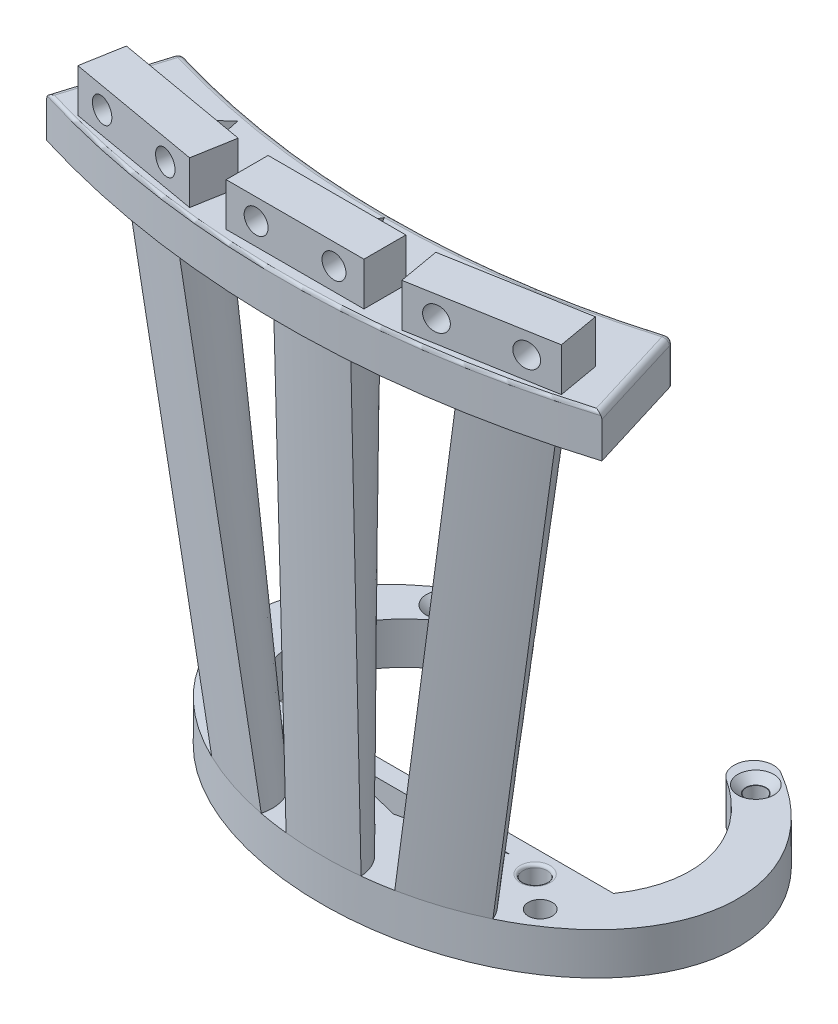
ISO-10303-21;
HEADER;
FILE_DESCRIPTION(('STEP AP214'),'2;1');
FILE_NAME('part.step','',(''),(''),'','','');
FILE_SCHEMA(('AUTOMOTIVE_DESIGN { 1 0 10303 214 1 1 1 1 }'));
ENDSEC;
DATA;
#1=APPLICATION_CONTEXT('core data for automotive mechanical design processes');
#2=APPLICATION_PROTOCOL_DEFINITION('international standard','automotive_design',2000,#1);
#3=PRODUCT_CONTEXT('',#1,'mechanical');
#4=PRODUCT('Part','Part','',(#3));
#5=PRODUCT_RELATED_PRODUCT_CATEGORY('part','',(#4));
#6=PRODUCT_DEFINITION_FORMATION('','',#4);
#7=PRODUCT_DEFINITION_CONTEXT('part definition',#1,'design');
#8=PRODUCT_DEFINITION('design','',#6,#7);
#9=PRODUCT_DEFINITION_SHAPE('','',#8);
#10=(LENGTH_UNIT() NAMED_UNIT(*) SI_UNIT(.MILLI.,.METRE.));
#11=(NAMED_UNIT(*) PLANE_ANGLE_UNIT() SI_UNIT($,.RADIAN.));
#12=(NAMED_UNIT(*) SI_UNIT($,.STERADIAN.) SOLID_ANGLE_UNIT());
#13=UNCERTAINTY_MEASURE_WITH_UNIT(LENGTH_MEASURE(1.E-05),#10,'distance_accuracy_value','');
#14=(GEOMETRIC_REPRESENTATION_CONTEXT(3) GLOBAL_UNCERTAINTY_ASSIGNED_CONTEXT((#13)) GLOBAL_UNIT_ASSIGNED_CONTEXT((#10,
#11,#12)) REPRESENTATION_CONTEXT('',''));
#15=CARTESIAN_POINT('',(0.,0.,0.));
#16=DIRECTION('',(0.,0.,1.));
#17=DIRECTION('',(1.,0.,0.));
#18=AXIS2_PLACEMENT_3D('',#15,#16,#17);
#19=CARTESIAN_POINT('',(-46.3466666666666,87.,28.0496159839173));
#20=DIRECTION('',(0.,-1.,0.));
#21=DIRECTION('',(0.,0.,-1.));
#22=AXIS2_PLACEMENT_3D('',#19,#20,#21);
#23=PLANE('',#22);
#24=DIRECTION('',(0.742247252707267,0.,-0.670126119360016));
#25=VECTOR('',#24,1.);
#26=CARTESIAN_POINT('',(-28.7695726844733,87.,18.6418743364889));
#27=LINE('',#26,#25);
#28=CARTESIAN_POINT('',(-28.7700589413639,87.,18.6418336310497));
#29=VERTEX_POINT('',#28);
#30=CARTESIAN_POINT('',(-26.1983527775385,87.,16.3204893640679));
#31=VERTEX_POINT('',#30);
#32=EDGE_CURVE('E1107',#29,#31,#27,.T.);
#33=ORIENTED_EDGE('',*,*,#32,.F.);
#34=CARTESIAN_POINT('',(-29.7548033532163,87.,18.2649976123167));
#35=CARTESIAN_POINT('',(-29.1396796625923,87.,18.5092976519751));
#36=CARTESIAN_POINT('',(-28.5114826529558,87.,18.7416142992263));
#37=CARTESIAN_POINT('',(-26.7660888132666,87.,19.3402903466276));
#38=CARTESIAN_POINT('',(-25.6255813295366,87.,19.6812460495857));
#39=CARTESIAN_POINT('',(-24.457569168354,87.,19.9809709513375));
#40=B_SPLINE_CURVE_WITH_KNOTS('',3,(#34,#35,#36,#37,#38,#39),.UNSPECIFIED.,.F.,.F.,(4,2,4),
(0.393842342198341,0.40625,0.427681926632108),.UNSPECIFIED.);
#41=CARTESIAN_POINT('',(-29.7548033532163,87.,18.2649976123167));
#42=VERTEX_POINT('',#41);
#43=EDGE_CURVE('E162',#42,#29,#40,.T.);
#44=ORIENTED_EDGE('',*,*,#43,.F.);
#45=CARTESIAN_POINT('',(-30.1147748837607,87.,27.7006862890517));
#46=DIRECTION('',(0.,1.,0.));
#47=DIRECTION('',(0.34926857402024,0.,-0.937022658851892));
#48=AXIS2_PLACEMENT_3D('',#45,#46,#47);
#49=ELLIPSE('',#48,10.0000000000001,6.68385350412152);
#50=CARTESIAN_POINT('',(-36.3166496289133,87.,25.205282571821));
#51=VERTEX_POINT('',#50);
#52=EDGE_CURVE('E770',#42,#51,#49,.T.);
#53=ORIENTED_EDGE('',*,*,#52,.T.);
#54=CARTESIAN_POINT('',(-36.3166496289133,87.,25.205282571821));
#55=CARTESIAN_POINT('',(-32.7658539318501,87.,26.9256345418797));
#56=CARTESIAN_POINT('',(-28.8583705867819,87.,28.2597838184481));
#57=CARTESIAN_POINT('',(-24.3870659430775,87.,29.2403107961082));
#58=CARTESIAN_POINT('',(-24.0089618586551,87.,29.3191898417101));
#59=CARTESIAN_POINT('',(-23.6294249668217,87.,29.3943642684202));
#60=B_SPLINE_CURVE_WITH_KNOTS('',3,(#54,#55,#56,#57,#58,#59),.UNSPECIFIED.,.F.,.F.,(4,2,4),
(0.375503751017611,0.4375,0.443200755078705),.UNSPECIFIED.);
#61=CARTESIAN_POINT('',(-23.6294249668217,87.,29.3943642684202));
#62=VERTEX_POINT('',#61);
#63=EDGE_CURVE('E2217',#51,#62,#60,.T.);
#64=ORIENTED_EDGE('',*,*,#63,.T.);
#65=CARTESIAN_POINT('',(-30.1147748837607,87.,27.7006862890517));
#66=DIRECTION('',(0.,1.,0.));
#67=DIRECTION('',(0.34926857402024,0.,-0.937022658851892));
#68=AXIS2_PLACEMENT_3D('',#65,#66,#67);
#69=ELLIPSE('',#68,10.0000000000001,6.68385350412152);
#70=CARTESIAN_POINT('',(-24.4575691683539,87.,19.9809709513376));
#71=VERTEX_POINT('',#70);
#72=EDGE_CURVE('E2197',#62,#71,#69,.T.);
#73=ORIENTED_EDGE('',*,*,#72,.T.);
#74=CARTESIAN_POINT('',(-25.4746707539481,87.,19.7075485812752));
#75=VERTEX_POINT('',#74);
#76=EDGE_CURVE('E714',#75,#71,#40,.T.);
#77=ORIENTED_EDGE('',*,*,#76,.F.);
#78=DIRECTION('',(0.209222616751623,0.,0.977868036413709));
#79=VECTOR('',#78,1.);
#80=CARTESIAN_POINT('',(-26.1983527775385,87.,16.3204893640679));
#81=LINE('',#80,#79);
#82=EDGE_CURVE('E1407',#31,#75,#81,.T.);
#83=ORIENTED_EDGE('',*,*,#82,.F.);
#84=EDGE_LOOP('',(#33,#44,#53,#64,#73,#77,#83));
#85=FACE_BOUND('',#84,.T.);
#86=DIRECTION('',(0.5,0.,-0.866025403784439));
#87=VECTOR('',#86,1.);
#88=CARTESIAN_POINT('',(0.,87.,17.9970615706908));
#89=LINE('',#88,#87);
#90=CARTESIAN_POINT('',(-1.99994429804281,87.,21.4611631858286));
#91=VERTEX_POINT('',#90);
#92=CARTESIAN_POINT('',(0.,87.,17.9970615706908));
#93=VERTEX_POINT('',#92);
#94=EDGE_CURVE('E543',#91,#93,#89,.T.);
#95=ORIENTED_EDGE('',*,*,#94,.F.);
#96=CARTESIAN_POINT('',(-2.70964482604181,87.,21.4287545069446));
#97=CARTESIAN_POINT('',(-1.80849645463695,87.,21.4761043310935));
#98=CARTESIAN_POINT('',(-0.904272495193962,87.,21.5));
#99=CARTESIAN_POINT('',(0.904272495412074,87.,21.5));
#100=CARTESIAN_POINT('',(1.80849645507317,87.,21.476104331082));
#101=CARTESIAN_POINT('',(2.70964482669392,87.,21.4287545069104));
#102=B_SPLINE_CURVE_WITH_KNOTS('',3,(#96,#97,#98,#99,#100,#101),.UNSPECIFIED.,.F.,.F.,(4,2,4),
(0.484645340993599,0.5,0.515354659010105),.UNSPECIFIED.);
#103=CARTESIAN_POINT('',(-2.70964482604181,87.,21.4287545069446));
#104=VERTEX_POINT('',#103);
#105=EDGE_CURVE('E919',#104,#91,#102,.T.);
#106=ORIENTED_EDGE('',*,*,#105,.F.);
#107=CARTESIAN_POINT('',(0.,87.,30.5));
#108=DIRECTION('',(0.,1.,0.));
#109=DIRECTION('',(0.,0.,-1.));
#110=AXIS2_PLACEMENT_3D('',#107,#108,#109);
#111=ELLIPSE('',#110,10.,6.4383172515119);
#112=CARTESIAN_POINT('',(-6.43455127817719,87.,30.158017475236));
#113=VERTEX_POINT('',#112);
#114=EDGE_CURVE('E884',#104,#113,#111,.T.);
#115=ORIENTED_EDGE('',*,*,#114,.T.);
#116=CARTESIAN_POINT('',(-6.43455127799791,87.,30.1580174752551));
#117=CARTESIAN_POINT('',(-4.30544281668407,87.,30.3852640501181));
#118=CARTESIAN_POINT('',(-2.15278942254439,87.,30.5));
#119=CARTESIAN_POINT('',(2.15278942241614,87.,30.5));
#120=CARTESIAN_POINT('',(4.30544281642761,87.,30.3852640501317));
#121=CARTESIAN_POINT('',(6.43455127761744,87.,30.1580174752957));
#122=B_SPLINE_CURVE_WITH_KNOTS('',3,(#116,#117,#118,#119,#120,#121),.UNSPECIFIED.,.F.,.F.,(4,2,
4),(0.468840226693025,0.5,0.531159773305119),.UNSPECIFIED.);
#123=CARTESIAN_POINT('',(6.43455127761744,87.,30.1580174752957));
#124=VERTEX_POINT('',#123);
#125=EDGE_CURVE('E877',#113,#124,#122,.T.);
#126=ORIENTED_EDGE('',*,*,#125,.T.);
#127=CARTESIAN_POINT('',(0.,87.,30.5));
#128=DIRECTION('',(0.,1.,0.));
#129=DIRECTION('',(0.,0.,-1.));
#130=AXIS2_PLACEMENT_3D('',#127,#128,#129);
#131=ELLIPSE('',#130,10.,6.4383172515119);
#132=CARTESIAN_POINT('',(2.70964482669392,87.,21.4287545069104));
#133=VERTEX_POINT('',#132);
#134=EDGE_CURVE('E897',#124,#133,#131,.T.);
#135=ORIENTED_EDGE('',*,*,#134,.T.);
#136=CARTESIAN_POINT('',(1.99995463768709,87.,21.4611631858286));
#137=VERTEX_POINT('',#136);
#138=EDGE_CURVE('E925',#137,#133,#102,.T.);
#139=ORIENTED_EDGE('',*,*,#138,.F.);
#140=DIRECTION('',(0.5,0.,0.866025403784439));
#141=VECTOR('',#140,1.);
#142=CARTESIAN_POINT('',(2.,87.,21.4611631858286));
#143=LINE('',#142,#141);
#144=EDGE_CURVE('E1391',#93,#137,#143,.T.);
#145=ORIENTED_EDGE('',*,*,#144,.F.);
#146=EDGE_LOOP('',(#95,#106,#115,#126,#135,#139,#145));
#147=FACE_BOUND('',#146,.T.);
#148=DIRECTION('',(0.209222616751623,0.,-0.977868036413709));
#149=VECTOR('',#148,1.);
#150=CARTESIAN_POINT('',(26.1983527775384,87.,16.3204893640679));
#151=LINE('',#150,#149);
#152=CARTESIAN_POINT('',(25.4747306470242,87.,19.7075528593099));
#153=VERTEX_POINT('',#152);
#154=CARTESIAN_POINT('',(26.1983527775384,87.,16.3204893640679));
#155=VERTEX_POINT('',#154);
#156=EDGE_CURVE('E1111',#153,#155,#151,.T.);
#157=ORIENTED_EDGE('',*,*,#156,.F.);
#158=CARTESIAN_POINT('',(29.754803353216,87.,18.2649976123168));
#159=CARTESIAN_POINT('',(29.139679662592,87.,18.5092976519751));
#160=CARTESIAN_POINT('',(28.5114826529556,87.,18.7416142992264));
#161=CARTESIAN_POINT('',(26.7660888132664,87.,19.3402903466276));
#162=CARTESIAN_POINT('',(25.6255813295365,87.,19.6812460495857));
#163=CARTESIAN_POINT('',(24.457569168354,87.,19.9809709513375));
#164=B_SPLINE_CURVE_WITH_KNOTS('',3,(#158,#159,#160,#161,#162,#163),.UNSPECIFIED.,.F.,.F.,(4,2,
4),(0.393842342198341,0.40625,0.427681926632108),.UNSPECIFIED.);
#165=CARTESIAN_POINT('',(24.4575691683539,87.,19.9809709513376));
#166=VERTEX_POINT('',#165);
#167=EDGE_CURVE('E948',#153,#166,#164,.T.);
#168=ORIENTED_EDGE('',*,*,#167,.T.);
#169=CARTESIAN_POINT('',(30.1147748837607,87.,27.7006862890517));
#170=DIRECTION('',(0.,-1.,0.));
#171=DIRECTION('',(-0.34926857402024,0.,-0.937022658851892));
#172=AXIS2_PLACEMENT_3D('',#169,#170,#171);
#173=ELLIPSE('',#172,10.,6.68385350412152);
#174=CARTESIAN_POINT('',(23.6294249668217,87.,29.3943642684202));
#175=VERTEX_POINT('',#174);
#176=EDGE_CURVE('E966',#175,#166,#173,.T.);
#177=ORIENTED_EDGE('',*,*,#176,.F.);
#178=CARTESIAN_POINT('',(36.3166496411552,87.,25.2052826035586));
#179=CARTESIAN_POINT('',(32.7658539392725,87.,26.9256345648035));
#180=CARTESIAN_POINT('',(28.8583705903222,87.,28.2597838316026));
#181=CARTESIAN_POINT('',(24.3870659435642,87.,29.2403107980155));
#182=CARTESIAN_POINT('',(24.0089618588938,87.,29.3191898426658));
#183=CARTESIAN_POINT('',(23.6294249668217,87.,29.3943642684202));
#184=B_SPLINE_CURVE_WITH_KNOTS('',3,(#178,#179,#180,#181,#182,#183),.UNSPECIFIED.,.F.,.F.,(4,2,
4),(0.375503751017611,0.4375,0.443200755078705),.UNSPECIFIED.);
#185=CARTESIAN_POINT('',(36.3166496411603,87.,25.2052826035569));
#186=VERTEX_POINT('',#185);
#187=EDGE_CURVE('E1036',#186,#175,#184,.T.);
#188=ORIENTED_EDGE('',*,*,#187,.F.);
#189=CARTESIAN_POINT('',(30.1147748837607,87.,27.7006862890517));
#190=DIRECTION('',(0.,-1.,0.));
#191=DIRECTION('',(-0.34926857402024,0.,-0.937022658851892));
#192=AXIS2_PLACEMENT_3D('',#189,#190,#191);
#193=ELLIPSE('',#192,10.,6.68385350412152);
#194=CARTESIAN_POINT('',(29.7548033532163,87.,18.2649976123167));
#195=VERTEX_POINT('',#194);
#196=EDGE_CURVE('E1022',#195,#186,#193,.T.);
#197=ORIENTED_EDGE('',*,*,#196,.F.);
#198=CARTESIAN_POINT('',(28.7700594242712,87.,18.6418348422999));
#199=VERTEX_POINT('',#198);
#200=EDGE_CURVE('E947',#195,#199,#164,.T.);
#201=ORIENTED_EDGE('',*,*,#200,.T.);
#202=DIRECTION('',(0.742247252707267,0.,0.670126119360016));
#203=VECTOR('',#202,1.);
#204=CARTESIAN_POINT('',(28.7695726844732,87.,18.6418743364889));
#205=LINE('',#204,#203);
#206=EDGE_CURVE('E1363',#155,#199,#205,.T.);
#207=ORIENTED_EDGE('',*,*,#206,.F.);
#208=EDGE_LOOP('',(#157,#168,#177,#188,#197,#201,#207));
#209=FACE_BOUND('',#208,.T.);
#210=DIRECTION('',(0.293333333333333,0.,-0.956010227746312));
#211=VECTOR('',#210,1.);
#212=CARTESIAN_POINT('',(-46.3466666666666,87.,28.0496159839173));
#213=LINE('',#212,#211);
#214=CARTESIAN_POINT('',(-46.3466666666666,87.,28.0496159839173));
#215=VERTEX_POINT('',#214);
#216=CARTESIAN_POINT('',(-41.3589597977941,87.,11.7940519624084));
#217=VERTEX_POINT('',#216);
#218=EDGE_CURVE('E1115',#215,#217,#213,.T.);
#219=ORIENTED_EDGE('',*,*,#218,.T.);
#220=CARTESIAN_POINT('',(-40.4029495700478,87.,12.0873852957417));
#221=DIRECTION('',(0.,-1.,0.));
#222=DIRECTION('',(0.,0.,-1.));
#223=AXIS2_PLACEMENT_3D('',#220,#221,#222);
#224=CIRCLE('',#223,1.);
#225=CARTESIAN_POINT('',(-40.1164038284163,87.,11.1293187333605));
#226=VERTEX_POINT('',#225);
#227=EDGE_CURVE('E1118',#217,#226,#224,.T.);
#228=ORIENTED_EDGE('',*,*,#227,.T.);
#229=CARTESIAN_POINT('',(0.,87.,-123.));
#230=DIRECTION('',(0.,1.,0.));
#231=DIRECTION('',(-0.293333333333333,0.,0.956010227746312));
#232=AXIS2_PLACEMENT_3D('',#229,#230,#231);
#233=CIRCLE('',#232,140.);
#234=CARTESIAN_POINT('',(40.1164038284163,87.,11.1293187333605));
#235=VERTEX_POINT('',#234);
#236=EDGE_CURVE('E1326',#226,#235,#233,.T.);
#237=ORIENTED_EDGE('',*,*,#236,.T.);
#238=CARTESIAN_POINT('',(40.4029495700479,87.,12.0873852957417));
#239=DIRECTION('',(0.,-1.,0.));
#240=DIRECTION('',(0.,0.,-1.));
#241=AXIS2_PLACEMENT_3D('',#238,#239,#240);
#242=CIRCLE('',#241,1.);
#243=CARTESIAN_POINT('',(41.3589597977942,87.,11.7940519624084));
#244=VERTEX_POINT('',#243);
#245=EDGE_CURVE('E1135',#235,#244,#242,.T.);
#246=ORIENTED_EDGE('',*,*,#245,.T.);
#247=DIRECTION('',(-0.293333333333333,0.,-0.956010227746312));
#248=VECTOR('',#247,1.);
#249=CARTESIAN_POINT('',(46.3466666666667,87.,28.0496159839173));
#250=LINE('',#249,#248);
#251=CARTESIAN_POINT('',(46.3466666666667,87.,28.0496159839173));
#252=VERTEX_POINT('',#251);
#253=EDGE_CURVE('E1144',#252,#244,#250,.T.);
#254=ORIENTED_EDGE('',*,*,#253,.F.);
#255=CARTESIAN_POINT('',(0.,87.,-123.));
#256=DIRECTION('',(0.,1.,0.));
#257=DIRECTION('',(-0.293333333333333,0.,0.956010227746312));
#258=AXIS2_PLACEMENT_3D('',#255,#256,#257);
#259=CIRCLE('',#258,158.);
#260=EDGE_CURVE('E1122',#215,#252,#259,.T.);
#261=ORIENTED_EDGE('',*,*,#260,.F.);
#262=EDGE_LOOP('',(#219,#228,#237,#246,#254,#261));
#263=FACE_BOUND('',#262,.T.);
#264=ADVANCED_FACE('F158',(#85,#147,#209,#263),#23,.T.);
#265=DIRECTION('',(-0.95146986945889,0.,-0.307741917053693));
#266=VECTOR('',#265,1.);
#267=CARTESIAN_POINT('',(-28.7695726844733,87.,18.6418743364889));
#268=LINE('',#267,#266);
#269=EDGE_CURVE('E1418',#75,#29,#268,.T.);
#270=ORIENTED_EDGE('',*,*,#269,.F.);
#271=EDGE_CURVE('E709',#29,#75,#40,.T.);
#272=ORIENTED_EDGE('',*,*,#271,.F.);
#273=EDGE_LOOP('',(#270,#272));
#274=FACE_BOUND('',#273,.T.);
#275=ADVANCED_FACE('F1098',(#274),#23,.T.);
#276=DIRECTION('',(-1.,0.,0.));
#277=VECTOR('',#276,1.);
#278=CARTESIAN_POINT('',(-2.,87.,21.4611631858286));
#279=LINE('',#278,#277);
#280=EDGE_CURVE('E544',#137,#91,#279,.T.);
#281=ORIENTED_EDGE('',*,*,#280,.F.);
#282=EDGE_CURVE('E921',#91,#137,#102,.T.);
#283=ORIENTED_EDGE('',*,*,#282,.F.);
#284=EDGE_LOOP('',(#281,#283));
#285=FACE_BOUND('',#284,.T.);
#286=ADVANCED_FACE('F620',(#285),#23,.T.);
#287=CARTESIAN_POINT('',(-46.3466666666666,94.,28.0496159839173));
#288=DIRECTION('',(0.,1.,0.));
#289=DIRECTION('',(0.,0.,1.));
#290=AXIS2_PLACEMENT_3D('',#287,#288,#289);
#291=PLANE('',#290);
#292=DIRECTION('',(-0.742247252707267,0.,0.670126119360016));
#293=VECTOR('',#292,1.);
#294=CARTESIAN_POINT('',(-43.1327422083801,94.,31.6094333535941));
#295=LINE('',#294,#293);
#296=CARTESIAN_POINT('',(-26.1983527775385,94.,16.3204893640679));
#297=VERTEX_POINT('',#296);
#298=CARTESIAN_POINT('',(-28.7695726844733,94.,18.6418743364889));
#299=VERTEX_POINT('',#298);
#300=EDGE_CURVE('E1349',#297,#299,#295,.T.);
#301=ORIENTED_EDGE('',*,*,#300,.F.);
#302=DIRECTION('',(-0.209222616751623,0.,-0.977868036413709));
#303=VECTOR('',#302,1.);
#304=CARTESIAN_POINT('',(-24.6806403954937,94.,23.4139979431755));
#305=LINE('',#304,#303);
#306=CARTESIAN_POINT('',(-25.4735843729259,94.,19.7079236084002));
#307=VERTEX_POINT('',#306);
#308=EDGE_CURVE('E1355',#307,#297,#305,.T.);
#309=ORIENTED_EDGE('',*,*,#308,.F.);
#310=DIRECTION('',(0.95146986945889,0.,0.307741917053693));
#311=VECTOR('',#310,1.);
#312=CARTESIAN_POINT('',(-41.927372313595,94.,14.3861363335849));
#313=LINE('',#312,#311);
#314=EDGE_CURVE('E1350',#299,#307,#313,.T.);
#315=ORIENTED_EDGE('',*,*,#314,.F.);
#316=EDGE_LOOP('',(#301,#309,#315));
#317=FACE_BOUND('',#316,.T.);
#318=DIRECTION('',(-0.5,0.,0.866025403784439));
#319=VECTOR('',#318,1.);
#320=CARTESIAN_POINT('',(-15.9395504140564,94.,45.6051727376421));
#321=LINE('',#320,#319);
#322=CARTESIAN_POINT('',(-0.00169649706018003,94.,17.999999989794));
#323=VERTEX_POINT('',#322);
#324=CARTESIAN_POINT('',(-2.,94.,21.4611631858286));
#325=VERTEX_POINT('',#324);
#326=EDGE_CURVE('E1370',#323,#325,#321,.T.);
#327=ORIENTED_EDGE('',*,*,#326,.F.);
#328=CARTESIAN_POINT('',(0.,94.,-123.));
#329=DIRECTION('',(0.,1.,0.));
#330=DIRECTION('',(0.,0.,1.));
#331=AXIS2_PLACEMENT_3D('',#328,#329,#330);
#332=CIRCLE('',#331,141.);
#333=CARTESIAN_POINT('',(-40.4029495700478,94.,12.0873852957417));
#334=VERTEX_POINT('',#333);
#335=EDGE_CURVE('E550',#323,#334,#332,.F.);
#336=ORIENTED_EDGE('',*,*,#335,.T.);
#337=DIRECTION('',(-0.293333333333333,0.,0.956010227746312));
#338=VECTOR('',#337,1.);
#339=CARTESIAN_POINT('',(-45.2439897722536,94.,27.8649442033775));
#340=LINE('',#339,#338);
#341=CARTESIAN_POINT('',(-45.2430585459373,94.,27.8619092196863));
#342=VERTEX_POINT('',#341);
#343=EDGE_CURVE('E560',#334,#342,#340,.T.);
#344=ORIENTED_EDGE('',*,*,#343,.T.);
#345=CARTESIAN_POINT('',(0.,94.,-123.));
#346=DIRECTION('',(0.,1.,0.));
#347=DIRECTION('',(0.,0.,1.));
#348=AXIS2_PLACEMENT_3D('',#345,#346,#347);
#349=CIRCLE('',#348,157.5);
#350=CARTESIAN_POINT('',(45.2430585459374,94.,27.8619092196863));
#351=VERTEX_POINT('',#350);
#352=EDGE_CURVE('E1540',#342,#351,#349,.T.);
#353=ORIENTED_EDGE('',*,*,#352,.T.);
#354=DIRECTION('',(0.293333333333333,0.,0.956010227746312));
#355=VECTOR('',#354,1.);
#356=CARTESIAN_POINT('',(37.41491006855,94.,2.34898873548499));
#357=LINE('',#356,#355);
#358=CARTESIAN_POINT('',(40.4029495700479,94.,12.0873852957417));
#359=VERTEX_POINT('',#358);
#360=EDGE_CURVE('E558',#351,#359,#357,.F.);
#361=ORIENTED_EDGE('',*,*,#360,.T.);
#362=CARTESIAN_POINT('',(0.00169649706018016,94.,17.999999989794));
#363=VERTEX_POINT('',#362);
#364=EDGE_CURVE('E557',#359,#363,#332,.F.);
#365=ORIENTED_EDGE('',*,*,#364,.T.);
#366=DIRECTION('',(-0.5,0.,-0.866025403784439));
#367=VECTOR('',#366,1.);
#368=CARTESIAN_POINT('',(-7.2337829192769,94.,5.46778202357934));
#369=LINE('',#368,#367);
#370=CARTESIAN_POINT('',(2.,94.,21.4611631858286));
#371=VERTEX_POINT('',#370);
#372=EDGE_CURVE('E532',#371,#363,#369,.T.);
#373=ORIENTED_EDGE('',*,*,#372,.F.);
#374=DIRECTION('',(1.,0.,0.));
#375=VECTOR('',#374,1.);
#376=CARTESIAN_POINT('',(-46.3466666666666,94.,21.4611631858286));
#377=LINE('',#376,#375);
#378=EDGE_CURVE('E1387',#325,#371,#377,.T.);
#379=ORIENTED_EDGE('',*,*,#378,.F.);
#380=EDGE_LOOP('',(#327,#336,#344,#353,#361,#365,#373,#379));
#381=FACE_BOUND('',#380,.T.);
#382=DIRECTION('',(-0.209222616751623,0.,0.977868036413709));
#383=VECTOR('',#382,1.);
#384=CARTESIAN_POINT('',(20.6230728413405,94.,42.3783225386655));
#385=LINE('',#384,#383);
#386=CARTESIAN_POINT('',(26.1983527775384,94.,16.3204893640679));
#387=VERTEX_POINT('',#386);
#388=CARTESIAN_POINT('',(25.4735843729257,94.,19.7079236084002));
#389=VERTEX_POINT('',#388);
#390=EDGE_CURVE('E1385',#387,#389,#385,.T.);
#391=ORIENTED_EDGE('',*,*,#390,.F.);
#392=DIRECTION('',(-0.742247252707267,0.,-0.670126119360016));
#393=VECTOR('',#392,1.);
#394=CARTESIAN_POINT('',(-7.93488714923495,94.,-14.4961630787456));
#395=LINE('',#394,#393);
#396=CARTESIAN_POINT('',(28.7695726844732,94.,18.6418743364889));
#397=VERTEX_POINT('',#396);
#398=EDGE_CURVE('E1373',#397,#387,#395,.T.);
#399=ORIENTED_EDGE('',*,*,#398,.F.);
#400=DIRECTION('',(0.95146986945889,0.,-0.307741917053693));
#401=VECTOR('',#400,1.);
#402=CARTESIAN_POINT('',(-41.9874307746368,94.,41.5274081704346));
#403=LINE('',#402,#401);
#404=EDGE_CURVE('E1375',#389,#397,#403,.T.);
#405=ORIENTED_EDGE('',*,*,#404,.F.);
#406=EDGE_LOOP('',(#391,#399,#405));
#407=FACE_BOUND('',#406,.T.);
#408=DIRECTION('',(1.,0.,0.));
#409=VECTOR('',#408,1.);
#410=CARTESIAN_POINT('',(-11.5,94.,32.9287545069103));
#411=LINE('',#410,#409);
#412=CARTESIAN_POINT('',(-11.5,94.,32.9287545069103));
#413=VERTEX_POINT('',#412);
#414=CARTESIAN_POINT('',(11.5,94.,32.9287545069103));
#415=VERTEX_POINT('',#414);
#416=EDGE_CURVE('E1291',#413,#415,#411,.T.);
#417=ORIENTED_EDGE('',*,*,#416,.F.);
#418=DIRECTION('',(0.,0.,1.));
#419=VECTOR('',#418,1.);
#420=CARTESIAN_POINT('',(-11.5,94.,25.9287545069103));
#421=LINE('',#420,#419);
#422=CARTESIAN_POINT('',(-11.5,94.,25.9287545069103));
#423=VERTEX_POINT('',#422);
#424=EDGE_CURVE('E1302',#423,#413,#421,.T.);
#425=ORIENTED_EDGE('',*,*,#424,.F.);
#426=DIRECTION('',(-1.,0.,0.));
#427=VECTOR('',#426,1.);
#428=CARTESIAN_POINT('',(-11.5,94.,25.9287545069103));
#429=LINE('',#428,#427);
#430=CARTESIAN_POINT('',(11.5,94.,25.9287545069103));
#431=VERTEX_POINT('',#430);
#432=EDGE_CURVE('E1311',#431,#423,#429,.T.);
#433=ORIENTED_EDGE('',*,*,#432,.F.);
#434=DIRECTION('',(0.,0.,-1.));
#435=VECTOR('',#434,1.);
#436=CARTESIAN_POINT('',(11.5,94.,25.9287545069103));
#437=LINE('',#436,#435);
#438=EDGE_CURVE('E1301',#415,#431,#437,.T.);
#439=ORIENTED_EDGE('',*,*,#438,.F.);
#440=EDGE_LOOP('',(#417,#425,#433,#439));
#441=FACE_BOUND('',#440,.T.);
#442=DIRECTION('',(0.173648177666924,0.,0.984807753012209));
#443=VECTOR('',#442,1.);
#444=CARTESIAN_POINT('',(16.5,94.,25.9287545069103));
#445=LINE('',#444,#443);
#446=CARTESIAN_POINT('',(16.5,94.,25.9287545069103));
#447=VERTEX_POINT('',#446);
#448=CARTESIAN_POINT('',(17.7155372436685,94.,32.8224087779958));
#449=VERTEX_POINT('',#448);
#450=EDGE_CURVE('E1485',#447,#449,#445,.T.);
#451=ORIENTED_EDGE('',*,*,#450,.F.);
#452=DIRECTION('',(-0.984807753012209,0.,0.173648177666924));
#453=VECTOR('',#452,1.);
#454=CARTESIAN_POINT('',(39.1505783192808,94.,21.9348464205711));
#455=LINE('',#454,#453);
#456=CARTESIAN_POINT('',(39.1505783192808,94.,21.9348464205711));
#457=VERTEX_POINT('',#456);
#458=EDGE_CURVE('E1487',#457,#447,#455,.T.);
#459=ORIENTED_EDGE('',*,*,#458,.F.);
#460=DIRECTION('',(-0.173648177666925,0.,-0.984807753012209));
#461=VECTOR('',#460,1.);
#462=CARTESIAN_POINT('',(40.3661155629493,94.,28.8285006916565));
#463=LINE('',#462,#461);
#464=CARTESIAN_POINT('',(40.3661155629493,94.,28.8285006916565));
#465=VERTEX_POINT('',#464);
#466=EDGE_CURVE('E1479',#465,#457,#463,.T.);
#467=ORIENTED_EDGE('',*,*,#466,.F.);
#468=DIRECTION('',(0.984807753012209,0.,-0.173648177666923));
#469=VECTOR('',#468,1.);
#470=CARTESIAN_POINT('',(17.7155372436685,94.,32.8224087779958));
#471=LINE('',#470,#469);
#472=EDGE_CURVE('E1481',#449,#465,#471,.T.);
#473=ORIENTED_EDGE('',*,*,#472,.F.);
#474=EDGE_LOOP('',(#451,#459,#467,#473));
#475=FACE_BOUND('',#474,.T.);
#476=DIRECTION('',(0.173648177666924,0.,-0.984807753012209));
#477=VECTOR('',#476,1.);
#478=CARTESIAN_POINT('',(-16.5,94.,25.9287545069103));
#479=LINE('',#478,#477);
#480=CARTESIAN_POINT('',(-17.7155372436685,94.,32.8224087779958));
#481=VERTEX_POINT('',#480);
#482=CARTESIAN_POINT('',(-16.5,94.,25.9287545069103));
#483=VERTEX_POINT('',#482);
#484=EDGE_CURVE('E1456',#481,#483,#479,.T.);
#485=ORIENTED_EDGE('',*,*,#484,.F.);
#486=DIRECTION('',(0.984807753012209,0.,0.173648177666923));
#487=VECTOR('',#486,1.);
#488=CARTESIAN_POINT('',(-17.7155372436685,94.,32.8224087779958));
#489=LINE('',#488,#487);
#490=CARTESIAN_POINT('',(-40.3661155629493,94.,28.8285006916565));
#491=VERTEX_POINT('',#490);
#492=EDGE_CURVE('E1458',#491,#481,#489,.T.);
#493=ORIENTED_EDGE('',*,*,#492,.F.);
#494=DIRECTION('',(-0.173648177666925,0.,0.984807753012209));
#495=VECTOR('',#494,1.);
#496=CARTESIAN_POINT('',(-40.3661155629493,94.,28.8285006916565));
#497=LINE('',#496,#495);
#498=CARTESIAN_POINT('',(-39.1505783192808,94.,21.9348464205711));
#499=VERTEX_POINT('',#498);
#500=EDGE_CURVE('E1450',#499,#491,#497,.T.);
#501=ORIENTED_EDGE('',*,*,#500,.F.);
#502=DIRECTION('',(-0.984807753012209,0.,-0.173648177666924));
#503=VECTOR('',#502,1.);
#504=CARTESIAN_POINT('',(-39.1505783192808,94.,21.9348464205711));
#505=LINE('',#504,#503);
#506=EDGE_CURVE('E1452',#483,#499,#505,.T.);
#507=ORIENTED_EDGE('',*,*,#506,.F.);
#508=EDGE_LOOP('',(#485,#493,#501,#507));
#509=FACE_BOUND('',#508,.T.);
#510=ADVANCED_FACE('F1087',(#317,#381,#407,#441,#475,#509),#291,.T.);
#511=CARTESIAN_POINT('',(0.,7.,0.));
#512=DIRECTION('',(0.,1.,0.));
#513=DIRECTION('',(0.,0.,1.));
#514=AXIS2_PLACEMENT_3D('',#511,#512,#513);
#515=PLANE('',#514);
#516=CARTESIAN_POINT('',(-26.,7.,-18.));
#517=DIRECTION('',(0.,1.,0.));
#518=DIRECTION('',(0.,0.,1.));
#519=AXIS2_PLACEMENT_3D('',#516,#517,#518);
#520=CIRCLE('',#519,3.);
#521=CARTESIAN_POINT('',(-26.,7.,-15.));
#522=VERTEX_POINT('',#521);
#523=EDGE_CURVE('E2222',#522,#522,#520,.T.);
#524=ORIENTED_EDGE('',*,*,#523,.F.);
#525=EDGE_LOOP('',(#524));
#526=FACE_BOUND('',#525,.T.);
#527=CARTESIAN_POINT('',(26.,7.,-18.));
#528=DIRECTION('',(0.,1.,0.));
#529=DIRECTION('',(0.,0.,1.));
#530=AXIS2_PLACEMENT_3D('',#527,#528,#529);
#531=CIRCLE('',#530,3.);
#532=CARTESIAN_POINT('',(26.,7.,-15.));
#533=VERTEX_POINT('',#532);
#534=EDGE_CURVE('E2066',#533,#533,#531,.T.);
#535=ORIENTED_EDGE('',*,*,#534,.F.);
#536=EDGE_LOOP('',(#535));
#537=FACE_BOUND('',#536,.T.);
#538=CARTESIAN_POINT('',(20.5,7.,13.3480067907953));
#539=DIRECTION('',(0.,1.,0.));
#540=DIRECTION('',(0.,0.,1.));
#541=AXIS2_PLACEMENT_3D('',#538,#539,#540);
#542=CIRCLE('',#541,2.5);
#543=CARTESIAN_POINT('',(20.5,7.,15.8480067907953));
#544=VERTEX_POINT('',#543);
#545=EDGE_CURVE('E2291',#544,#544,#542,.F.);
#546=ORIENTED_EDGE('',*,*,#545,.T.);
#547=EDGE_LOOP('',(#546));
#548=FACE_BOUND('',#547,.T.);
#549=CARTESIAN_POINT('',(-20.5,7.,13.3480067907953));
#550=DIRECTION('',(0.,1.,0.));
#551=DIRECTION('',(0.,0.,1.));
#552=AXIS2_PLACEMENT_3D('',#549,#550,#551);
#553=CIRCLE('',#552,2.5);
#554=CARTESIAN_POINT('',(-20.5,7.,15.8480067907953));
#555=VERTEX_POINT('',#554);
#556=EDGE_CURVE('E2287',#555,#555,#553,.F.);
#557=ORIENTED_EDGE('',*,*,#556,.T.);
#558=EDGE_LOOP('',(#557));
#559=FACE_BOUND('',#558,.T.);
#560=CARTESIAN_POINT('',(26.,7.,18.));
#561=DIRECTION('',(0.,1.,0.));
#562=DIRECTION('',(0.,0.,1.));
#563=AXIS2_PLACEMENT_3D('',#560,#561,#562);
#564=CIRCLE('',#563,2.);
#565=CARTESIAN_POINT('',(26.,7.,20.));
#566=VERTEX_POINT('',#565);
#567=EDGE_CURVE('E2068',#566,#566,#564,.T.);
#568=ORIENTED_EDGE('',*,*,#567,.F.);
#569=EDGE_LOOP('',(#568));
#570=FACE_BOUND('',#569,.T.);
#571=CARTESIAN_POINT('',(-26.,7.,18.));
#572=DIRECTION('',(0.,1.,0.));
#573=DIRECTION('',(0.,0.,1.));
#574=AXIS2_PLACEMENT_3D('',#571,#572,#573);
#575=CIRCLE('',#574,2.);
#576=CARTESIAN_POINT('',(-26.,7.,20.));
#577=VERTEX_POINT('',#576);
#578=EDGE_CURVE('E2071',#577,#577,#575,.F.);
#579=ORIENTED_EDGE('',*,*,#578,.T.);
#580=EDGE_LOOP('',(#579));
#581=FACE_BOUND('',#580,.T.);
#582=DIRECTION('',(0.969743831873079,0.,-0.244124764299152));
#583=VECTOR('',#582,1.);
#584=CARTESIAN_POINT('',(3.90618499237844,7.,15.5166511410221));
#585=LINE('',#584,#583);
#586=CARTESIAN_POINT('',(0.,7.,16.5));
#587=VERTEX_POINT('',#586);
#588=CARTESIAN_POINT('',(15.5,7.,12.5980067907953));
#589=VERTEX_POINT('',#588);
#590=EDGE_CURVE('E2352',#587,#589,#585,.T.);
#591=ORIENTED_EDGE('',*,*,#590,.F.);
#592=DIRECTION('',(-0.969743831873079,0.,-0.244124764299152));
#593=VECTOR('',#592,1.);
#594=CARTESIAN_POINT('',(-3.90618499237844,7.,15.5166511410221));
#595=LINE('',#594,#593);
#596=CARTESIAN_POINT('',(-15.5,7.,12.5980067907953));
#597=VERTEX_POINT('',#596);
#598=EDGE_CURVE('E2354',#587,#597,#595,.T.);
#599=ORIENTED_EDGE('',*,*,#598,.T.);
#600=DIRECTION('',(1.,0.,0.));
#601=VECTOR('',#600,1.);
#602=CARTESIAN_POINT('',(0.,7.,12.5980067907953));
#603=LINE('',#602,#601);
#604=EDGE_CURVE('E2357',#597,#589,#603,.T.);
#605=ORIENTED_EDGE('',*,*,#604,.T.);
#606=EDGE_LOOP('',(#591,#599,#605));
#607=FACE_BOUND('',#606,.T.);
#608=DIRECTION('',(-0.762762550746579,0.,-0.646678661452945));
#609=VECTOR('',#608,1.);
#610=CARTESIAN_POINT('',(-2.44295886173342,7.,2.88148912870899));
#611=LINE('',#610,#609);
#612=CARTESIAN_POINT('',(16.9357628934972,7.,19.3109871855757));
#613=VERTEX_POINT('',#612);
#614=CARTESIAN_POINT('',(14.325535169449,7.,17.0980067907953));
#615=VERTEX_POINT('',#614);
#616=EDGE_CURVE('E2445',#613,#615,#611,.T.);
#617=ORIENTED_EDGE('',*,*,#616,.F.);
#618=CARTESIAN_POINT('',(17.4402353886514,7.,25.7930354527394));
#619=DIRECTION('',(0.,1.,0.));
#620=DIRECTION('',(0.,0.,1.));
#621=AXIS2_PLACEMENT_3D('',#618,#619,#620);
#622=CIRCLE('',#621,6.50164919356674);
#623=CARTESIAN_POINT('',(23.4724277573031,7.,23.3673195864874));
#624=VERTEX_POINT('',#623);
#625=EDGE_CURVE('E1329',#624,#613,#622,.T.);
#626=ORIENTED_EDGE('',*,*,#625,.F.);
#627=CARTESIAN_POINT('',(0.,7.,0.));
#628=DIRECTION('',(0.,-1.,0.));
#629=DIRECTION('',(1.,0.,0.));
#630=AXIS2_PLACEMENT_3D('',#627,#628,#629);
#631=ELLIPSE('',#630,41.,28.5);
#632=CARTESIAN_POINT('',(26.3141113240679,7.,-21.8556726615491));
#633=VERTEX_POINT('',#632);
#634=EDGE_CURVE('E2337',#624,#633,#631,.F.);
#635=ORIENTED_EDGE('',*,*,#634,.T.);
#636=CARTESIAN_POINT('',(24.6532253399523,7.,-19.0007569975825));
#637=DIRECTION('',(0.,1.,0.));
#638=DIRECTION('',(0.,0.,1.));
#639=AXIS2_PLACEMENT_3D('',#636,#637,#638);
#640=CIRCLE('',#639,3.30289050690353);
#641=CARTESIAN_POINT('',(22.8452506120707,7.,-16.2366453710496));
#642=VERTEX_POINT('',#641);
#643=EDGE_CURVE('E2064',#642,#633,#640,.F.);
#644=ORIENTED_EDGE('',*,*,#643,.F.);
#645=CARTESIAN_POINT('',(0.,7.,0.));
#646=DIRECTION('',(0.,1.,0.));
#647=DIRECTION('',(-1.,0.,0.));
#648=AXIS2_PLACEMENT_3D('',#645,#646,#647);
#649=ELLIPSE('',#648,33.,22.5);
#650=CARTESIAN_POINT('',(29.8468744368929,7.,9.59800679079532));
#651=VERTEX_POINT('',#650);
#652=EDGE_CURVE('E2058',#651,#642,#649,.T.);
#653=ORIENTED_EDGE('',*,*,#652,.F.);
#654=DIRECTION('',(1.,0.,0.));
#655=VECTOR('',#654,1.);
#656=CARTESIAN_POINT('',(0.,7.,9.59800679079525));
#657=LINE('',#656,#655);
#658=CARTESIAN_POINT('',(-29.846874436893,7.,9.59800679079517));
#659=VERTEX_POINT('',#658);
#660=EDGE_CURVE('E2063',#659,#651,#657,.T.);
#661=ORIENTED_EDGE('',*,*,#660,.F.);
#662=CARTESIAN_POINT('',(-22.8452506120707,7.,-16.2366453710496));
#663=VERTEX_POINT('',#662);
#664=EDGE_CURVE('E2065',#663,#659,#649,.T.);
#665=ORIENTED_EDGE('',*,*,#664,.F.);
#666=CARTESIAN_POINT('',(-24.6532253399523,7.,-19.0007569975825));
#667=DIRECTION('',(0.,1.,0.));
#668=DIRECTION('',(0.,0.,1.));
#669=AXIS2_PLACEMENT_3D('',#666,#667,#668);
#670=CIRCLE('',#669,3.30289050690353);
#671=CARTESIAN_POINT('',(-26.3141113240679,7.,-21.8556726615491));
#672=VERTEX_POINT('',#671);
#673=EDGE_CURVE('E2338',#663,#672,#670,.T.);
#674=ORIENTED_EDGE('',*,*,#673,.T.);
#675=CARTESIAN_POINT('',(0.,7.,0.));
#676=DIRECTION('',(0.,-1.,0.));
#677=DIRECTION('',(1.,0.,0.));
#678=AXIS2_PLACEMENT_3D('',#675,#676,#677);
#679=ELLIPSE('',#678,41.,28.5);
#680=CARTESIAN_POINT('',(-23.4724277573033,7.,23.3673195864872));
#681=VERTEX_POINT('',#680);
#682=EDGE_CURVE('E2333',#672,#681,#679,.F.);
#683=ORIENTED_EDGE('',*,*,#682,.T.);
#684=CARTESIAN_POINT('',(-17.4402353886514,7.,25.7930354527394));
#685=DIRECTION('',(0.,1.,0.));
#686=DIRECTION('',(0.,0.,1.));
#687=AXIS2_PLACEMENT_3D('',#684,#685,#686);
#688=CIRCLE('',#687,6.50164919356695);
#689=CARTESIAN_POINT('',(-16.9357628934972,7.,19.3109871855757));
#690=VERTEX_POINT('',#689);
#691=EDGE_CURVE('E2097',#690,#681,#688,.T.);
#692=ORIENTED_EDGE('',*,*,#691,.F.);
#693=DIRECTION('',(0.76276255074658,0.,-0.646678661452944));
#694=VECTOR('',#693,1.);
#695=CARTESIAN_POINT('',(2.44295886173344,7.,2.88148912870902));
#696=LINE('',#695,#694);
#697=CARTESIAN_POINT('',(-14.325535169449,7.,17.0980067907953));
#698=VERTEX_POINT('',#697);
#699=EDGE_CURVE('E2254',#690,#698,#696,.T.);
#700=ORIENTED_EDGE('',*,*,#699,.T.);
#701=DIRECTION('',(0.178658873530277,0.,0.983911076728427));
#702=VECTOR('',#701,1.);
#703=CARTESIAN_POINT('',(-16.8738421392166,7.,3.06395740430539));
#704=LINE('',#703,#702);
#705=CARTESIAN_POINT('',(-13.7141517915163,7.,20.4650205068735));
#706=VERTEX_POINT('',#705);
#707=EDGE_CURVE('E2257',#698,#706,#704,.T.);
#708=ORIENTED_EDGE('',*,*,#707,.T.);
#709=CARTESIAN_POINT('',(-17.4402353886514,7.,25.7930354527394));
#710=DIRECTION('',(0.,1.,0.));
#711=DIRECTION('',(0.,0.,1.));
#712=AXIS2_PLACEMENT_3D('',#709,#710,#711);
#713=CIRCLE('',#712,6.50164919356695);
#714=CARTESIAN_POINT('',(-11.147113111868,7.,27.426460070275));
#715=VERTEX_POINT('',#714);
#716=EDGE_CURVE('E2170',#715,#706,#713,.T.);
#717=ORIENTED_EDGE('',*,*,#716,.F.);
#718=CARTESIAN_POINT('',(0.,7.,0.));
#719=DIRECTION('',(0.,-1.,0.));
#720=DIRECTION('',(1.,0.,0.));
#721=AXIS2_PLACEMENT_3D('',#718,#719,#720);
#722=ELLIPSE('',#721,41.,28.5);
#723=CARTESIAN_POINT('',(-6.26046432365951,7.,28.1657940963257));
#724=VERTEX_POINT('',#723);
#725=EDGE_CURVE('E2165',#715,#724,#722,.F.);
#726=ORIENTED_EDGE('',*,*,#725,.T.);
#727=CARTESIAN_POINT('',(0.,7.,28.5));
#728=DIRECTION('',(0.,1.,0.));
#729=DIRECTION('',(0.,0.,1.));
#730=AXIS2_PLACEMENT_3D('',#727,#728,#729);
#731=CIRCLE('',#730,6.26937852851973);
#732=CARTESIAN_POINT('',(-1.71450652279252,7.,22.4696124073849));
#733=VERTEX_POINT('',#732);
#734=EDGE_CURVE('E2171',#733,#724,#731,.T.);
#735=ORIENTED_EDGE('',*,*,#734,.F.);
#736=DIRECTION('',(0.5,0.,-0.866025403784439));
#737=VECTOR('',#736,1.);
#738=CARTESIAN_POINT('',(8.44374768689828,7.,4.875));
#739=LINE('',#738,#737);
#740=CARTESIAN_POINT('',(0.,7.,19.5));
#741=VERTEX_POINT('',#740);
#742=EDGE_CURVE('E2121',#733,#741,#739,.T.);
#743=ORIENTED_EDGE('',*,*,#742,.T.);
#744=DIRECTION('',(0.5,0.,0.866025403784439));
#745=VECTOR('',#744,1.);
#746=CARTESIAN_POINT('',(-8.44374768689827,7.,4.875));
#747=LINE('',#746,#745);
#748=CARTESIAN_POINT('',(1.71450652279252,7.,22.4696124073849));
#749=VERTEX_POINT('',#748);
#750=EDGE_CURVE('E2124',#741,#749,#747,.T.);
#751=ORIENTED_EDGE('',*,*,#750,.T.);
#752=CARTESIAN_POINT('',(0.,7.,28.5));
#753=DIRECTION('',(0.,1.,0.));
#754=DIRECTION('',(0.,0.,1.));
#755=AXIS2_PLACEMENT_3D('',#752,#753,#754);
#756=CIRCLE('',#755,6.26937852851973);
#757=CARTESIAN_POINT('',(6.26046433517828,7.,28.1657942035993));
#758=VERTEX_POINT('',#757);
#759=EDGE_CURVE('E903',#758,#749,#756,.T.);
#760=ORIENTED_EDGE('',*,*,#759,.F.);
#761=CARTESIAN_POINT('',(0.,7.,0.));
#762=DIRECTION('',(0.,-1.,0.));
#763=DIRECTION('',(1.,0.,0.));
#764=AXIS2_PLACEMENT_3D('',#761,#762,#763);
#765=ELLIPSE('',#764,41.,28.5);
#766=CARTESIAN_POINT('',(11.1471119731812,7.,27.4264542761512));
#767=VERTEX_POINT('',#766);
#768=EDGE_CURVE('E2144',#758,#767,#765,.F.);
#769=ORIENTED_EDGE('',*,*,#768,.T.);
#770=CARTESIAN_POINT('',(17.4402353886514,7.,25.7930354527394));
#771=DIRECTION('',(0.,1.,0.));
#772=DIRECTION('',(0.,0.,1.));
#773=AXIS2_PLACEMENT_3D('',#770,#771,#772);
#774=CIRCLE('',#773,6.50164919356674);
#775=CARTESIAN_POINT('',(13.7141517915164,7.,20.4650205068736));
#776=VERTEX_POINT('',#775);
#777=EDGE_CURVE('E2431',#776,#767,#774,.T.);
#778=ORIENTED_EDGE('',*,*,#777,.F.);
#779=DIRECTION('',(-0.178658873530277,0.,0.983911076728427));
#780=VECTOR('',#779,1.);
#781=CARTESIAN_POINT('',(16.8738421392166,7.,3.0639574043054));
#782=LINE('',#781,#780);
#783=EDGE_CURVE('E2305',#615,#776,#782,.T.);
#784=ORIENTED_EDGE('',*,*,#783,.F.);
#785=EDGE_LOOP('',(#617,#626,#635,#644,#653,#661,#665,#674,#683,#692,#700,#708,#717,#726,#735,
#743,#751,#760,#769,#778,#784));
#786=FACE_BOUND('',#785,.T.);
#787=ADVANCED_FACE('F1089',(#526,#537,#548,#559,#570,#581,#607,#786),#515,.T.);
#788=CARTESIAN_POINT('',(3.90618499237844,7.,15.5166511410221));
#789=DIRECTION('',(-0.244124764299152,0.,-0.969743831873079));
#790=DIRECTION('',(-0.969743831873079,0.,0.244124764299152));
#791=AXIS2_PLACEMENT_3D('',#788,#789,#790);
#792=PLANE('',#791);
#793=DIRECTION('',(0.969743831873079,0.,-0.244124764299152));
#794=VECTOR('',#793,1.);
#795=CARTESIAN_POINT('',(3.90618499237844,0.,15.5166511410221));
#796=LINE('',#795,#794);
#797=CARTESIAN_POINT('',(0.,0.,16.5));
#798=VERTEX_POINT('',#797);
#799=CARTESIAN_POINT('',(15.5,0.,12.5980067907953));
#800=VERTEX_POINT('',#799);
#801=EDGE_CURVE('E2402',#798,#800,#796,.T.);
#802=ORIENTED_EDGE('',*,*,#801,.F.);
#803=DIRECTION('',(0.,-1.,0.));
#804=VECTOR('',#803,1.);
#805=CARTESIAN_POINT('',(0.,7.,16.5));
#806=LINE('',#805,#804);
#807=EDGE_CURVE('E2288',#587,#798,#806,.T.);
#808=ORIENTED_EDGE('',*,*,#807,.F.);
#809=ORIENTED_EDGE('',*,*,#590,.T.);
#810=DIRECTION('',(0.,-1.,0.));
#811=VECTOR('',#810,1.);
#812=CARTESIAN_POINT('',(15.5,7.,12.5980067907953));
#813=LINE('',#812,#811);
#814=EDGE_CURVE('E2312',#589,#800,#813,.T.);
#815=ORIENTED_EDGE('',*,*,#814,.T.);
#816=EDGE_LOOP('',(#802,#808,#809,#815));
#817=FACE_BOUND('',#816,.T.);
#818=ADVANCED_FACE('F1095',(#817),#792,.T.);
#819=CARTESIAN_POINT('',(-3.90618499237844,7.,15.5166511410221));
#820=DIRECTION('',(-0.244124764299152,0.,0.969743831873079));
#821=DIRECTION('',(0.969743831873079,0.,0.244124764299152));
#822=AXIS2_PLACEMENT_3D('',#819,#820,#821);
#823=PLANE('',#822);
#824=DIRECTION('',(-0.969743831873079,0.,-0.244124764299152));
#825=VECTOR('',#824,1.);
#826=CARTESIAN_POINT('',(-3.90618499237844,0.,15.5166511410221));
#827=LINE('',#826,#825);
#828=CARTESIAN_POINT('',(-15.5,0.,12.5980067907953));
#829=VERTEX_POINT('',#828);
#830=EDGE_CURVE('E2308',#798,#829,#827,.T.);
#831=ORIENTED_EDGE('',*,*,#830,.T.);
#832=DIRECTION('',(0.,-1.,0.));
#833=VECTOR('',#832,1.);
#834=CARTESIAN_POINT('',(-15.5,7.,12.5980067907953));
#835=LINE('',#834,#833);
#836=EDGE_CURVE('E2314',#597,#829,#835,.T.);
#837=ORIENTED_EDGE('',*,*,#836,.F.);
#838=ORIENTED_EDGE('',*,*,#598,.F.);
#839=ORIENTED_EDGE('',*,*,#807,.T.);
#840=EDGE_LOOP('',(#831,#837,#838,#839));
#841=FACE_BOUND('',#840,.T.);
#842=ADVANCED_FACE('F2009',(#841),#823,.F.);
#843=DIRECTION('',(0.,-1.,0.));
#844=VECTOR('',#843,1.);
#845=SURFACE_OF_LINEAR_EXTRUSION('',#649,#844);
#846=CARTESIAN_POINT('',(0.,0.,0.));
#847=DIRECTION('',(0.,1.,0.));
#848=DIRECTION('',(-1.,0.,0.));
#849=AXIS2_PLACEMENT_3D('',#846,#847,#848);
#850=ELLIPSE('',#849,33.,22.5);
#851=CARTESIAN_POINT('',(-22.8452506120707,0.,-16.2366453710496));
#852=VERTEX_POINT('',#851);
#853=CARTESIAN_POINT('',(-29.846874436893,0.,9.59800679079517));
#854=VERTEX_POINT('',#853);
#855=EDGE_CURVE('E2390',#852,#854,#850,.T.);
#856=ORIENTED_EDGE('',*,*,#855,.F.);
#857=DIRECTION('',(0.,-1.,0.));
#858=VECTOR('',#857,1.);
#859=CARTESIAN_POINT('',(-22.8452506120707,7.,-16.2366453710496));
#860=LINE('',#859,#858);
#861=EDGE_CURVE('E2278',#663,#852,#860,.T.);
#862=ORIENTED_EDGE('',*,*,#861,.F.);
#863=ORIENTED_EDGE('',*,*,#664,.T.);
#864=DIRECTION('',(0.,-1.,0.));
#865=VECTOR('',#864,1.);
#866=CARTESIAN_POINT('',(-29.846874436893,7.,9.59800679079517));
#867=LINE('',#866,#865);
#868=EDGE_CURVE('E2270',#659,#854,#867,.T.);
#869=ORIENTED_EDGE('',*,*,#868,.T.);
#870=EDGE_LOOP('',(#856,#862,#863,#869));
#871=FACE_BOUND('',#870,.T.);
#872=ADVANCED_FACE('F1855',(#871),#845,.T.);
#873=CARTESIAN_POINT('',(-24.6532253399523,7.,-19.0007569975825));
#874=DIRECTION('',(0.,-1.,0.));
#875=DIRECTION('',(0.,0.,-1.));
#876=AXIS2_PLACEMENT_3D('',#873,#874,#875);
#877=CYLINDRICAL_SURFACE('',#876,3.30289050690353);
#878=CARTESIAN_POINT('',(-24.6532253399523,0.,-19.0007569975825));
#879=DIRECTION('',(0.,1.,0.));
#880=DIRECTION('',(0.,0.,1.));
#881=AXIS2_PLACEMENT_3D('',#878,#879,#880);
#882=CIRCLE('',#881,3.30289050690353);
#883=CARTESIAN_POINT('',(-26.3141113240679,0.,-21.8556726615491));
#884=VERTEX_POINT('',#883);
#885=EDGE_CURVE('E2391',#852,#884,#882,.T.);
#886=ORIENTED_EDGE('',*,*,#885,.T.);
#887=DIRECTION('',(0.,-1.,0.));
#888=VECTOR('',#887,1.);
#889=CARTESIAN_POINT('',(-26.3141113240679,7.,-21.8556726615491));
#890=LINE('',#889,#888);
#891=EDGE_CURVE('E2322',#672,#884,#890,.T.);
#892=ORIENTED_EDGE('',*,*,#891,.F.);
#893=ORIENTED_EDGE('',*,*,#673,.F.);
#894=ORIENTED_EDGE('',*,*,#861,.T.);
#895=EDGE_LOOP('',(#886,#892,#893,#894));
#896=FACE_BOUND('',#895,.T.);
#897=ADVANCED_FACE('F1992',(#896),#877,.T.);
#898=CARTESIAN_POINT('',(0.,7.,0.));
#899=DIRECTION('',(0.,1.,0.));
#900=DIRECTION('',(1.,0.,0.));
#901=AXIS2_PLACEMENT_3D('',#898,#899,#900);
#902=ELLIPSE('',#901,41.,28.5);
#903=DIRECTION('',(0.,-1.,0.));
#904=VECTOR('',#903,1.);
#905=SURFACE_OF_LINEAR_EXTRUSION('',#902,#904);
#906=CARTESIAN_POINT('',(0.,0.,0.));
#907=DIRECTION('',(0.,1.,0.));
#908=DIRECTION('',(1.,0.,0.));
#909=AXIS2_PLACEMENT_3D('',#906,#907,#908);
#910=ELLIPSE('',#909,41.,28.5);
#911=CARTESIAN_POINT('',(26.3141113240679,0.,-21.8556726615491));
#912=VERTEX_POINT('',#911);
#913=EDGE_CURVE('E2394',#884,#912,#910,.T.);
#914=ORIENTED_EDGE('',*,*,#913,.T.);
#915=DIRECTION('',(0.,-1.,0.));
#916=VECTOR('',#915,1.);
#917=CARTESIAN_POINT('',(26.3141113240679,7.,-21.8556726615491));
#918=LINE('',#917,#916);
#919=EDGE_CURVE('E2319',#633,#912,#918,.T.);
#920=ORIENTED_EDGE('',*,*,#919,.F.);
#921=ORIENTED_EDGE('',*,*,#634,.F.);
#922=CARTESIAN_POINT('',(11.1471077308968,7.,27.4264326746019));
#923=CARTESIAN_POINT('',(11.4218220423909,7.00002603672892,27.3724816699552));
#924=CARTESIAN_POINT('',(11.6961297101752,7.00027345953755,27.3164577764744));
#925=CARTESIAN_POINT('',(12.2438606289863,7.00093600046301,27.2002372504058));
#926=CARTESIAN_POINT('',(12.5172838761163,7.00135111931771,27.1400405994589));
#927=CARTESIAN_POINT('',(13.0631939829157,7.00207399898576,27.0154431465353));
#928=CARTESIAN_POINT('',(13.335680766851,7.0023817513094,26.9510420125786));
#929=CARTESIAN_POINT('',(13.879620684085,7.00277405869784,26.8180107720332));
#930=CARTESIAN_POINT('',(14.1510738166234,7.0028586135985,26.7493806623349));
#931=CARTESIAN_POINT('',(14.692876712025,7.00278092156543,26.6078584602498));
#932=CARTESIAN_POINT('',(14.9632264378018,7.00261866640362,26.5349662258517));
#933=CARTESIAN_POINT('',(15.5027298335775,7.00211720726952,26.3848898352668));
#934=CARTESIAN_POINT('',(15.7718835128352,7.00177800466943,26.3077057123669));
#935=CARTESIAN_POINT('',(16.3089024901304,7.00106544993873,26.1490134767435));
#936=CARTESIAN_POINT('',(16.5767678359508,7.00069209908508,26.0675055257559));
#937=CARTESIAN_POINT('',(17.1111406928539,7.00014455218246,25.9001240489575));
#938=CARTESIAN_POINT('',(17.3776481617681,6.9999703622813,25.814250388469));
#939=CARTESIAN_POINT('',(17.8922039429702,7.00004321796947,25.6437355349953));
#940=CARTESIAN_POINT('',(18.1403425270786,7.00026403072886,25.5593668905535));
#941=CARTESIAN_POINT('',(18.6352628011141,7.00079721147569,25.3867409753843));
#942=CARTESIAN_POINT('',(18.882044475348,7.00110958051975,25.2984836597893));
#943=CARTESIAN_POINT('',(19.6202510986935,7.0019223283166,25.0278206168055));
#944=CARTESIAN_POINT('',(20.1095395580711,7.00229835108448,24.8395231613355));
#945=CARTESIAN_POINT('',(20.8388026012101,7.002256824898,24.5450250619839));
#946=CARTESIAN_POINT('',(21.0812132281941,7.00214187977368,24.4448055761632));
#947=CARTESIAN_POINT('',(21.5643277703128,7.00176976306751,24.2403262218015));
#948=CARTESIAN_POINT('',(21.8050316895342,7.00151259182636,24.1360663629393));
#949=CARTESIAN_POINT('',(22.2846395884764,7.00095261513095,23.9234653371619));
#950=CARTESIAN_POINT('',(22.5235435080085,7.00064980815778,23.8151240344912));
#951=CARTESIAN_POINT('',(22.9994432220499,7.0001788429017,23.5943215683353));
#952=CARTESIAN_POINT('',(23.2364389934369,7.00001068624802,23.4818603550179));
#953=CARTESIAN_POINT('',(23.4724277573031,7.,23.3673195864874));
#954=B_SPLINE_CURVE_WITH_KNOTS('',3,(#922,#923,#924,#925,#926,#927,#928,#929,#930,#931,#932,
#933,#934,#935,#936,#937,#938,#939,#940,#941,#942,#943,#944,#945,#946,#947,#948,#949,#950,#951,
#952,#953),.UNSPECIFIED.,.F.,.F.,(4,2,2,2,2,2,2,2,2,2,2,2,2,2,2,4),(0.,0.839878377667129,
1.67976045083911,2.51970892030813,3.3596580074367,4.19963509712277,5.03960567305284,
5.87954485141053,6.7195099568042,7.50574416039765,8.29198743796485,9.86446796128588,
10.6513720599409,11.4382742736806,12.2252026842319,13.0121406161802),.UNSPECIFIED.);
#955=EDGE_CURVE('E2429',#767,#624,#954,.T.);
#956=ORIENTED_EDGE('',*,*,#955,.F.);
#957=ORIENTED_EDGE('',*,*,#768,.F.);
#958=CARTESIAN_POINT('',(0.,7.,0.));
#959=DIRECTION('',(0.,1.,0.));
#960=DIRECTION('',(1.,0.,0.));
#961=AXIS2_PLACEMENT_3D('',#958,#959,#960);
#962=ELLIPSE('',#961,41.,28.5);
#963=EDGE_CURVE('E832',#724,#758,#962,.T.);
#964=ORIENTED_EDGE('',*,*,#963,.F.);
#965=ORIENTED_EDGE('',*,*,#725,.F.);
#966=CARTESIAN_POINT('',(-23.4724277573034,7.,23.3673195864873));
#967=CARTESIAN_POINT('',(-23.2204519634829,7.00001428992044,23.4896197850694));
#968=CARTESIAN_POINT('',(-22.9673279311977,7.00020413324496,23.6095493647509));
#969=CARTESIAN_POINT('',(-22.4589135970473,7.0007230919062,23.8447140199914));
#970=CARTESIAN_POINT('',(-22.2036233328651,7.00105220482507,23.9599491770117));
#971=CARTESIAN_POINT('',(-21.6910584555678,7.00163781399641,24.185749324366));
#972=CARTESIAN_POINT('',(-21.4337843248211,7.00189432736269,24.2963154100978));
#973=CARTESIAN_POINT('',(-20.9173087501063,7.00222484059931,24.5128538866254));
#974=CARTESIAN_POINT('',(-20.6581072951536,7.00229883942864,24.6188262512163));
#975=CARTESIAN_POINT('',(-20.1379106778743,7.00223121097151,24.8262145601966));
#976=CARTESIAN_POINT('',(-19.8769156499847,7.00208959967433,24.9276308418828));
#977=CARTESIAN_POINT('',(-19.3532223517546,7.00164516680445,25.1259586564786));
#978=CARTESIAN_POINT('',(-19.0905240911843,7.00134234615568,25.2228702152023));
#979=CARTESIAN_POINT('',(-18.5634820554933,7.00072206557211,25.4122472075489));
#980=CARTESIAN_POINT('',(-18.2991380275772,7.00040460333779,25.5047119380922));
#981=CARTESIAN_POINT('',(-17.9014936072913,7.0000995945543,25.6400922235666));
#982=CARTESIAN_POINT('',(-17.7687558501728,7.00002645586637,25.6846666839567));
#983=CARTESIAN_POINT('',(-17.5029150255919,6.9999869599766,25.7727152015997));
#984=CARTESIAN_POINT('',(-17.3698119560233,7.0000206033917,25.8161892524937));
#985=CARTESIAN_POINT('',(-16.9870244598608,7.00023441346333,25.9394758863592));
#986=CARTESIAN_POINT('',(-16.7368964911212,7.00051677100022,26.0179166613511));
#987=CARTESIAN_POINT('',(-16.2354786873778,7.00115482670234,26.1709880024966));
#988=CARTESIAN_POINT('',(-15.9841888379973,7.00151052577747,26.2456185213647));
#989=CARTESIAN_POINT('',(-15.2286454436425,7.00243504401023,26.4638494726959));
#990=CARTESIAN_POINT('',(-14.7227373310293,7.0028612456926,26.6017830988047));
#991=CARTESIAN_POINT('',(-13.9610158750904,7.00280864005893,26.7974995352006));
#992=CARTESIAN_POINT('',(-13.706620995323,7.0026757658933,26.8608768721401));
#993=CARTESIAN_POINT('',(-13.1969338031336,7.0022316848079,26.9839296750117));
#994=CARTESIAN_POINT('',(-12.9416414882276,7.00192047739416,27.0436051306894));
#995=CARTESIAN_POINT('',(-12.4302536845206,7.00122595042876,27.1592703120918));
#996=CARTESIAN_POINT('',(-12.1741582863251,7.00084263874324,27.2152604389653));
#997=CARTESIAN_POINT('',(-11.6611968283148,7.0002396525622,27.3235836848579));
#998=CARTESIAN_POINT('',(-11.404330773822,7.00001997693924,27.3759168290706));
#999=CARTESIAN_POINT('',(-11.1471077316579,7.,27.4264326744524));
#1000=B_SPLINE_CURVE_WITH_KNOTS('',3,(#966,#967,#968,#969,#970,#971,#972,#973,#974,#975,#976,
#977,#978,#979,#980,#981,#982,#983,#984,#985,#986,#987,#988,#989,#990,#991,#992,#993,#994,#995,
#996,#997,#998,#999),.UNSPECIFIED.,.F.,.F.,(4,2,2,2,2,2,2,2,2,2,2,2,2,2,2,2,4),(0.,
0.840247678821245,1.68048077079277,2.52051563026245,3.36055528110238,4.20053263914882,
5.0405051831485,5.88061009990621,6.30067235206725,6.72073703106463,7.50711976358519,
8.29351225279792,9.86635796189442,10.6528495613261,11.4393433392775,12.2257513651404,
13.0121539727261),.UNSPECIFIED.);
#1001=EDGE_CURVE('E2095',#681,#715,#1000,.T.);
#1002=ORIENTED_EDGE('',*,*,#1001,.F.);
#1003=ORIENTED_EDGE('',*,*,#682,.F.);
#1004=ORIENTED_EDGE('',*,*,#891,.T.);
#1005=EDGE_LOOP('',(#914,#920,#921,#956,#957,#964,#965,#1002,#1003,#1004));
#1006=FACE_BOUND('',#1005,.T.);
#1007=ADVANCED_FACE('F1984',(#1006),#905,.F.);
#1008=CARTESIAN_POINT('',(24.6532253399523,7.,-19.0007569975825));
#1009=DIRECTION('',(0.,-1.,0.));
#1010=DIRECTION('',(0.,0.,-1.));
#1011=AXIS2_PLACEMENT_3D('',#1008,#1009,#1010);
#1012=CYLINDRICAL_SURFACE('',#1011,3.30289050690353);
#1013=CARTESIAN_POINT('',(24.6532253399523,0.,-19.0007569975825));
#1014=DIRECTION('',(0.,1.,0.));
#1015=DIRECTION('',(0.,0.,1.));
#1016=AXIS2_PLACEMENT_3D('',#1013,#1014,#1015);
#1017=CIRCLE('',#1016,3.30289050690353);
#1018=CARTESIAN_POINT('',(22.8452506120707,0.,-16.2366453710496));
#1019=VERTEX_POINT('',#1018);
#1020=EDGE_CURVE('E2396',#1019,#912,#1017,.F.);
#1021=ORIENTED_EDGE('',*,*,#1020,.F.);
#1022=DIRECTION('',(0.,-1.,0.));
#1023=VECTOR('',#1022,1.);
#1024=CARTESIAN_POINT('',(22.8452506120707,7.,-16.2366453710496));
#1025=LINE('',#1024,#1023);
#1026=EDGE_CURVE('E2318',#642,#1019,#1025,.T.);
#1027=ORIENTED_EDGE('',*,*,#1026,.F.);
#1028=ORIENTED_EDGE('',*,*,#643,.T.);
#1029=ORIENTED_EDGE('',*,*,#919,.T.);
#1030=EDGE_LOOP('',(#1021,#1027,#1028,#1029));
#1031=FACE_BOUND('',#1030,.T.);
#1032=ADVANCED_FACE('F1976',(#1031),#1012,.T.);
#1033=CARTESIAN_POINT('',(29.8468744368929,0.,9.59800679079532));
#1034=VERTEX_POINT('',#1033);
#1035=EDGE_CURVE('E2372',#1034,#1019,#850,.T.);
#1036=ORIENTED_EDGE('',*,*,#1035,.F.);
#1037=DIRECTION('',(0.,-1.,0.));
#1038=VECTOR('',#1037,1.);
#1039=CARTESIAN_POINT('',(29.8468744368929,7.,9.59800679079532));
#1040=LINE('',#1039,#1038);
#1041=EDGE_CURVE('E2274',#651,#1034,#1040,.T.);
#1042=ORIENTED_EDGE('',*,*,#1041,.F.);
#1043=ORIENTED_EDGE('',*,*,#652,.T.);
#1044=ORIENTED_EDGE('',*,*,#1026,.T.);
#1045=EDGE_LOOP('',(#1036,#1042,#1043,#1044));
#1046=FACE_BOUND('',#1045,.T.);
#1047=ADVANCED_FACE('F1839',(#1046),#845,.T.);
#1048=CARTESIAN_POINT('',(2.44295886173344,7.,2.88148912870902));
#1049=DIRECTION('',(-0.646678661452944,0.,-0.76276255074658));
#1050=DIRECTION('',(-0.76276255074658,0.,0.646678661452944));
#1051=AXIS2_PLACEMENT_3D('',#1048,#1049,#1050);
#1052=PLANE('',#1051);
#1053=DIRECTION('',(0.76276255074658,0.,-0.646678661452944));
#1054=VECTOR('',#1053,1.);
#1055=CARTESIAN_POINT('',(2.44295886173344,0.,2.88148912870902));
#1056=LINE('',#1055,#1054);
#1057=CARTESIAN_POINT('',(-16.9357628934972,0.,19.3109871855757));
#1058=VERTEX_POINT('',#1057);
#1059=CARTESIAN_POINT('',(-14.325535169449,0.,17.0980067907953));
#1060=VERTEX_POINT('',#1059);
#1061=EDGE_CURVE('E2379',#1058,#1060,#1056,.T.);
#1062=ORIENTED_EDGE('',*,*,#1061,.T.);
#1063=DIRECTION('',(0.,-1.,0.));
#1064=VECTOR('',#1063,1.);
#1065=CARTESIAN_POINT('',(-14.325535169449,7.,17.0980067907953));
#1066=LINE('',#1065,#1064);
#1067=EDGE_CURVE('E2264',#698,#1060,#1066,.T.);
#1068=ORIENTED_EDGE('',*,*,#1067,.F.);
#1069=ORIENTED_EDGE('',*,*,#699,.F.);
#1070=DIRECTION('',(0.,-1.,0.));
#1071=VECTOR('',#1070,1.);
#1072=CARTESIAN_POINT('',(-16.9357628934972,7.,19.3109871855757));
#1073=LINE('',#1072,#1071);
#1074=EDGE_CURVE('E2244',#690,#1058,#1073,.T.);
#1075=ORIENTED_EDGE('',*,*,#1074,.T.);
#1076=EDGE_LOOP('',(#1062,#1068,#1069,#1075));
#1077=FACE_BOUND('',#1076,.T.);
#1078=ADVANCED_FACE('F1959',(#1077),#1052,.F.);
#1079=CARTESIAN_POINT('',(-16.8738421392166,7.,3.06395740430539));
#1080=DIRECTION('',(0.983911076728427,0.,-0.178658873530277));
#1081=DIRECTION('',(-0.178658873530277,0.,-0.983911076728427));
#1082=AXIS2_PLACEMENT_3D('',#1079,#1080,#1081);
#1083=PLANE('',#1082);
#1084=DIRECTION('',(0.178658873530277,0.,0.983911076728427));
#1085=VECTOR('',#1084,1.);
#1086=CARTESIAN_POINT('',(-16.8738421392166,0.,3.06395740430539));
#1087=LINE('',#1086,#1085);
#1088=CARTESIAN_POINT('',(-13.7141517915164,0.,20.4650205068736));
#1089=VERTEX_POINT('',#1088);
#1090=EDGE_CURVE('E2381',#1060,#1089,#1087,.T.);
#1091=ORIENTED_EDGE('',*,*,#1090,.T.);
#1092=DIRECTION('',(0.,-1.,0.));
#1093=VECTOR('',#1092,1.);
#1094=CARTESIAN_POINT('',(-13.7141517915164,7.,20.4650205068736));
#1095=LINE('',#1094,#1093);
#1096=EDGE_CURVE('E2251',#706,#1089,#1095,.T.);
#1097=ORIENTED_EDGE('',*,*,#1096,.F.);
#1098=ORIENTED_EDGE('',*,*,#707,.F.);
#1099=ORIENTED_EDGE('',*,*,#1067,.T.);
#1100=EDGE_LOOP('',(#1091,#1097,#1098,#1099));
#1101=FACE_BOUND('',#1100,.T.);
#1102=ADVANCED_FACE('F1950',(#1101),#1083,.F.);
#1103=CARTESIAN_POINT('',(8.44374768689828,7.,4.875));
#1104=DIRECTION('',(-0.866025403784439,0.,-0.5));
#1105=DIRECTION('',(-0.5,0.,0.866025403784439));
#1106=AXIS2_PLACEMENT_3D('',#1103,#1104,#1105);
#1107=PLANE('',#1106);
#1108=DIRECTION('',(0.5,0.,-0.866025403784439));
#1109=VECTOR('',#1108,1.);
#1110=CARTESIAN_POINT('',(8.44374768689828,0.,4.875));
#1111=LINE('',#1110,#1109);
#1112=CARTESIAN_POINT('',(-1.71450652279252,0.,22.4696124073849));
#1113=VERTEX_POINT('',#1112);
#1114=CARTESIAN_POINT('',(0.,0.,19.5));
#1115=VERTEX_POINT('',#1114);
#1116=EDGE_CURVE('E2371',#1113,#1115,#1111,.T.);
#1117=ORIENTED_EDGE('',*,*,#1116,.T.);
#1118=DIRECTION('',(0.,-1.,0.));
#1119=VECTOR('',#1118,1.);
#1120=CARTESIAN_POINT('',(0.,7.,19.5));
#1121=LINE('',#1120,#1119);
#1122=EDGE_CURVE('E2132',#741,#1115,#1121,.T.);
#1123=ORIENTED_EDGE('',*,*,#1122,.F.);
#1124=ORIENTED_EDGE('',*,*,#742,.F.);
#1125=DIRECTION('',(0.,-1.,0.));
#1126=VECTOR('',#1125,1.);
#1127=CARTESIAN_POINT('',(-1.71450652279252,7.,22.4696124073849));
#1128=LINE('',#1127,#1126);
#1129=EDGE_CURVE('E2110',#733,#1113,#1128,.T.);
#1130=ORIENTED_EDGE('',*,*,#1129,.T.);
#1131=EDGE_LOOP('',(#1117,#1123,#1124,#1130));
#1132=FACE_BOUND('',#1131,.T.);
#1133=ADVANCED_FACE('F1941',(#1132),#1107,.F.);
#1134=CARTESIAN_POINT('',(-8.44374768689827,7.,4.875));
#1135=DIRECTION('',(0.866025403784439,0.,-0.5));
#1136=DIRECTION('',(-0.5,0.,-0.866025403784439));
#1137=AXIS2_PLACEMENT_3D('',#1134,#1135,#1136);
#1138=PLANE('',#1137);
#1139=DIRECTION('',(0.5,0.,0.866025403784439));
#1140=VECTOR('',#1139,1.);
#1141=CARTESIAN_POINT('',(-8.44374768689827,0.,4.875));
#1142=LINE('',#1141,#1140);
#1143=CARTESIAN_POINT('',(1.71450652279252,0.,22.4696124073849));
#1144=VERTEX_POINT('',#1143);
#1145=EDGE_CURVE('E2376',#1115,#1144,#1142,.T.);
#1146=ORIENTED_EDGE('',*,*,#1145,.T.);
#1147=DIRECTION('',(0.,-1.,0.));
#1148=VECTOR('',#1147,1.);
#1149=CARTESIAN_POINT('',(1.71450652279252,7.,22.4696124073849));
#1150=LINE('',#1149,#1148);
#1151=EDGE_CURVE('E2117',#749,#1144,#1150,.T.);
#1152=ORIENTED_EDGE('',*,*,#1151,.F.);
#1153=ORIENTED_EDGE('',*,*,#750,.F.);
#1154=ORIENTED_EDGE('',*,*,#1122,.T.);
#1155=EDGE_LOOP('',(#1146,#1152,#1153,#1154));
#1156=FACE_BOUND('',#1155,.T.);
#1157=ADVANCED_FACE('F1932',(#1156),#1138,.F.);
#1158=CARTESIAN_POINT('',(16.8738421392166,7.,3.0639574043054));
#1159=DIRECTION('',(0.983911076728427,0.,0.178658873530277));
#1160=DIRECTION('',(0.178658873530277,0.,-0.983911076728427));
#1161=AXIS2_PLACEMENT_3D('',#1158,#1159,#1160);
#1162=PLANE('',#1161);
#1163=DIRECTION('',(-0.178658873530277,0.,0.983911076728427));
#1164=VECTOR('',#1163,1.);
#1165=CARTESIAN_POINT('',(16.8738421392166,0.,3.0639574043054));
#1166=LINE('',#1165,#1164);
#1167=CARTESIAN_POINT('',(14.325535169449,0.,17.0980067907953));
#1168=VERTEX_POINT('',#1167);
#1169=CARTESIAN_POINT('',(13.7141517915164,0.,20.4650205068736));
#1170=VERTEX_POINT('',#1169);
#1171=EDGE_CURVE('E2362',#1168,#1170,#1166,.T.);
#1172=ORIENTED_EDGE('',*,*,#1171,.F.);
#1173=DIRECTION('',(0.,-1.,0.));
#1174=VECTOR('',#1173,1.);
#1175=CARTESIAN_POINT('',(14.325535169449,7.,17.0980067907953));
#1176=LINE('',#1175,#1174);
#1177=EDGE_CURVE('E2118',#615,#1168,#1176,.T.);
#1178=ORIENTED_EDGE('',*,*,#1177,.F.);
#1179=ORIENTED_EDGE('',*,*,#783,.T.);
#1180=DIRECTION('',(0.,-1.,0.));
#1181=VECTOR('',#1180,1.);
#1182=CARTESIAN_POINT('',(13.7141517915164,7.,20.4650205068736));
#1183=LINE('',#1182,#1181);
#1184=EDGE_CURVE('E2361',#776,#1170,#1183,.T.);
#1185=ORIENTED_EDGE('',*,*,#1184,.T.);
#1186=EDGE_LOOP('',(#1172,#1178,#1179,#1185));
#1187=FACE_BOUND('',#1186,.T.);
#1188=ADVANCED_FACE('F1923',(#1187),#1162,.T.);
#1189=CARTESIAN_POINT('',(-2.44295886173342,7.,2.88148912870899));
#1190=DIRECTION('',(-0.646678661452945,0.,0.762762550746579));
#1191=DIRECTION('',(0.762762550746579,0.,0.646678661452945));
#1192=AXIS2_PLACEMENT_3D('',#1189,#1190,#1191);
#1193=PLANE('',#1192);
#1194=DIRECTION('',(-0.762762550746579,0.,-0.646678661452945));
#1195=VECTOR('',#1194,1.);
#1196=CARTESIAN_POINT('',(-2.44295886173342,0.,2.88148912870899));
#1197=LINE('',#1196,#1195);
#1198=CARTESIAN_POINT('',(16.9357628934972,0.,19.3109871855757));
#1199=VERTEX_POINT('',#1198);
#1200=EDGE_CURVE('E2365',#1199,#1168,#1197,.T.);
#1201=ORIENTED_EDGE('',*,*,#1200,.F.);
#1202=DIRECTION('',(0.,-1.,0.));
#1203=VECTOR('',#1202,1.);
#1204=CARTESIAN_POINT('',(16.9357628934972,7.,19.3109871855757));
#1205=LINE('',#1204,#1203);
#1206=EDGE_CURVE('E2283',#613,#1199,#1205,.T.);
#1207=ORIENTED_EDGE('',*,*,#1206,.F.);
#1208=ORIENTED_EDGE('',*,*,#616,.T.);
#1209=ORIENTED_EDGE('',*,*,#1177,.T.);
#1210=EDGE_LOOP('',(#1201,#1207,#1208,#1209));
#1211=FACE_BOUND('',#1210,.T.);
#1212=ADVANCED_FACE('F1914',(#1211),#1193,.T.);
#1213=CARTESIAN_POINT('',(-20.5,7.,13.3480067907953));
#1214=DIRECTION('',(0.,-1.,0.));
#1215=DIRECTION('',(0.,0.,-1.));
#1216=AXIS2_PLACEMENT_3D('',#1213,#1214,#1215);
#1217=CYLINDRICAL_SURFACE('',#1216,2.);
#1218=CARTESIAN_POINT('',(-20.5,6.5,13.3480067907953));
#1219=DIRECTION('',(0.,1.,0.));
#1220=DIRECTION('',(0.,0.,1.));
#1221=AXIS2_PLACEMENT_3D('',#1218,#1219,#1220);
#1222=CIRCLE('',#1221,2.);
#1223=CARTESIAN_POINT('',(-20.5,6.5,15.3480067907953));
#1224=VERTEX_POINT('',#1223);
#1225=EDGE_CURVE('E1544',#1224,#1224,#1222,.T.);
#1226=ORIENTED_EDGE('',*,*,#1225,.T.);
#1227=EDGE_LOOP('',(#1226));
#1228=FACE_BOUND('',#1227,.T.);
#1229=CARTESIAN_POINT('',(-20.5,0.,13.3480067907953));
#1230=DIRECTION('',(0.,1.,0.));
#1231=DIRECTION('',(0.,0.,1.));
#1232=AXIS2_PLACEMENT_3D('',#1229,#1230,#1231);
#1233=CIRCLE('',#1232,2.);
#1234=CARTESIAN_POINT('',(-20.5,0.,15.3480067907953));
#1235=VERTEX_POINT('',#1234);
#1236=EDGE_CURVE('E2299',#1235,#1235,#1233,.T.);
#1237=ORIENTED_EDGE('',*,*,#1236,.F.);
#1238=EDGE_LOOP('',(#1237));
#1239=FACE_BOUND('',#1238,.T.);
#1240=ADVANCED_FACE('F1905',(#1228,#1239),#1217,.F.);
#1241=CARTESIAN_POINT('',(0.,7.,12.5980067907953));
#1242=DIRECTION('',(0.,0.,-1.));
#1243=DIRECTION('',(-1.,0.,0.));
#1244=AXIS2_PLACEMENT_3D('',#1241,#1242,#1243);
#1245=PLANE('',#1244);
#1246=DIRECTION('',(1.,0.,0.));
#1247=VECTOR('',#1246,1.);
#1248=CARTESIAN_POINT('',(0.,0.,12.5980067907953));
#1249=LINE('',#1248,#1247);
#1250=EDGE_CURVE('E2302',#829,#800,#1249,.T.);
#1251=ORIENTED_EDGE('',*,*,#1250,.T.);
#1252=ORIENTED_EDGE('',*,*,#814,.F.);
#1253=ORIENTED_EDGE('',*,*,#604,.F.);
#1254=ORIENTED_EDGE('',*,*,#836,.T.);
#1255=EDGE_LOOP('',(#1251,#1252,#1253,#1254));
#1256=FACE_BOUND('',#1255,.T.);
#1257=ADVANCED_FACE('F1896',(#1256),#1245,.F.);
#1258=CARTESIAN_POINT('',(0.,7.,9.59800679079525));
#1259=DIRECTION('',(0.,0.,-1.));
#1260=DIRECTION('',(-1.,0.,0.));
#1261=AXIS2_PLACEMENT_3D('',#1258,#1259,#1260);
#1262=PLANE('',#1261);
#1263=DIRECTION('',(1.,0.,0.));
#1264=VECTOR('',#1263,1.);
#1265=CARTESIAN_POINT('',(0.,0.,9.59800679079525));
#1266=LINE('',#1265,#1264);
#1267=EDGE_CURVE('E2399',#854,#1034,#1266,.T.);
#1268=ORIENTED_EDGE('',*,*,#1267,.F.);
#1269=ORIENTED_EDGE('',*,*,#868,.F.);
#1270=ORIENTED_EDGE('',*,*,#660,.T.);
#1271=ORIENTED_EDGE('',*,*,#1041,.T.);
#1272=EDGE_LOOP('',(#1268,#1269,#1270,#1271));
#1273=FACE_BOUND('',#1272,.T.);
#1274=ADVANCED_FACE('F1888',(#1273),#1262,.T.);
#1275=CARTESIAN_POINT('',(-26.,7.,18.));
#1276=DIRECTION('',(0.,-1.,0.));
#1277=DIRECTION('',(0.,0.,-1.));
#1278=AXIS2_PLACEMENT_3D('',#1275,#1276,#1277);
#1279=CYLINDRICAL_SURFACE('',#1278,2.);
#1280=CARTESIAN_POINT('',(-26.,0.5,18.));
#1281=DIRECTION('',(0.,1.,0.));
#1282=DIRECTION('',(0.,0.,1.));
#1283=AXIS2_PLACEMENT_3D('',#1280,#1281,#1282);
#1284=CIRCLE('',#1283,2.);
#1285=CARTESIAN_POINT('',(-26.,0.5,20.));
#1286=VERTEX_POINT('',#1285);
#1287=EDGE_CURVE('E1335',#1286,#1286,#1284,.F.);
#1288=ORIENTED_EDGE('',*,*,#1287,.T.);
#1289=EDGE_LOOP('',(#1288));
#1290=FACE_BOUND('',#1289,.T.);
#1291=ORIENTED_EDGE('',*,*,#578,.F.);
#1292=EDGE_LOOP('',(#1291));
#1293=FACE_BOUND('',#1292,.T.);
#1294=ADVANCED_FACE('F1594',(#1290,#1293),#1279,.F.);
#1295=CARTESIAN_POINT('',(26.,7.,18.));
#1296=DIRECTION('',(0.,-1.,0.));
#1297=DIRECTION('',(0.,0.,-1.));
#1298=AXIS2_PLACEMENT_3D('',#1295,#1296,#1297);
#1299=CYLINDRICAL_SURFACE('',#1298,2.);
#1300=CARTESIAN_POINT('',(26.,0.5,18.));
#1301=DIRECTION('',(0.,1.,0.));
#1302=DIRECTION('',(0.,0.,1.));
#1303=AXIS2_PLACEMENT_3D('',#1300,#1301,#1302);
#1304=CIRCLE('',#1303,2.);
#1305=CARTESIAN_POINT('',(26.,0.5,20.));
#1306=VERTEX_POINT('',#1305);
#1307=EDGE_CURVE('E1589',#1306,#1306,#1304,.F.);
#1308=ORIENTED_EDGE('',*,*,#1307,.T.);
#1309=EDGE_LOOP('',(#1308));
#1310=FACE_BOUND('',#1309,.T.);
#1311=ORIENTED_EDGE('',*,*,#567,.T.);
#1312=EDGE_LOOP('',(#1311));
#1313=FACE_BOUND('',#1312,.T.);
#1314=ADVANCED_FACE('F1871',(#1310,#1313),#1299,.F.);
#1315=CARTESIAN_POINT('',(26.,7.,-18.));
#1316=DIRECTION('',(0.,-1.,0.));
#1317=DIRECTION('',(0.,0.,-1.));
#1318=AXIS2_PLACEMENT_3D('',#1315,#1316,#1317);
#1319=CYLINDRICAL_SURFACE('',#1318,1.625);
#1320=CARTESIAN_POINT('',(26.,5.7446045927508,-18.));
#1321=DIRECTION('',(0.,-1.,0.));
#1322=DIRECTION('',(0.,0.,-1.));
#1323=AXIS2_PLACEMENT_3D('',#1320,#1321,#1322);
#1324=CIRCLE('',#1323,1.625);
#1325=CARTESIAN_POINT('',(26.,5.7446045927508,-19.625));
#1326=VERTEX_POINT('',#1325);
#1327=EDGE_CURVE('E2232',#1326,#1326,#1324,.F.);
#1328=ORIENTED_EDGE('',*,*,#1327,.T.);
#1329=EDGE_LOOP('',(#1328));
#1330=FACE_BOUND('',#1329,.T.);
#1331=CARTESIAN_POINT('',(26.,0.,-18.));
#1332=DIRECTION('',(0.,1.,0.));
#1333=DIRECTION('',(0.,0.,1.));
#1334=AXIS2_PLACEMENT_3D('',#1331,#1332,#1333);
#1335=CIRCLE('',#1334,1.625);
#1336=CARTESIAN_POINT('',(26.,0.,-16.375));
#1337=VERTEX_POINT('',#1336);
#1338=EDGE_CURVE('E2387',#1337,#1337,#1335,.F.);
#1339=ORIENTED_EDGE('',*,*,#1338,.T.);
#1340=EDGE_LOOP('',(#1339));
#1341=FACE_BOUND('',#1340,.T.);
#1342=ADVANCED_FACE('F1862',(#1330,#1341),#1319,.F.);
#1343=CARTESIAN_POINT('',(-26.,7.,-18.));
#1344=DIRECTION('',(0.,-1.,0.));
#1345=DIRECTION('',(0.,0.,-1.));
#1346=AXIS2_PLACEMENT_3D('',#1343,#1344,#1345);
#1347=CYLINDRICAL_SURFACE('',#1346,1.625);
#1348=CARTESIAN_POINT('',(-26.,5.7446045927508,-18.));
#1349=DIRECTION('',(0.,-1.,0.));
#1350=DIRECTION('',(0.,0.,-1.));
#1351=AXIS2_PLACEMENT_3D('',#1348,#1349,#1350);
#1352=CIRCLE('',#1351,1.625);
#1353=CARTESIAN_POINT('',(-26.,5.7446045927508,-19.625));
#1354=VERTEX_POINT('',#1353);
#1355=EDGE_CURVE('E2226',#1354,#1354,#1352,.T.);
#1356=ORIENTED_EDGE('',*,*,#1355,.F.);
#1357=EDGE_LOOP('',(#1356));
#1358=FACE_BOUND('',#1357,.T.);
#1359=CARTESIAN_POINT('',(-26.,0.,-18.));
#1360=DIRECTION('',(0.,1.,0.));
#1361=DIRECTION('',(0.,0.,1.));
#1362=AXIS2_PLACEMENT_3D('',#1359,#1360,#1361);
#1363=CIRCLE('',#1362,1.625);
#1364=CARTESIAN_POINT('',(-26.,0.,-16.375));
#1365=VERTEX_POINT('',#1364);
#1366=EDGE_CURVE('E2384',#1365,#1365,#1363,.T.);
#1367=ORIENTED_EDGE('',*,*,#1366,.F.);
#1368=EDGE_LOOP('',(#1367));
#1369=FACE_BOUND('',#1368,.T.);
#1370=ADVANCED_FACE('F1853',(#1358,#1369),#1347,.F.);
#1371=EDGE_CURVE('E2383',#1058,#1089,#850,.T.);
#1372=ORIENTED_EDGE('',*,*,#1371,.F.);
#1373=ORIENTED_EDGE('',*,*,#1074,.F.);
#1374=CARTESIAN_POINT('',(0.,7.,0.));
#1375=DIRECTION('',(0.,1.,0.));
#1376=DIRECTION('',(-1.,0.,0.));
#1377=AXIS2_PLACEMENT_3D('',#1374,#1375,#1376);
#1378=ELLIPSE('',#1377,33.,22.5);
#1379=EDGE_CURVE('E2072',#690,#706,#1378,.T.);
#1380=ORIENTED_EDGE('',*,*,#1379,.T.);
#1381=ORIENTED_EDGE('',*,*,#1096,.T.);
#1382=EDGE_LOOP('',(#1372,#1373,#1380,#1381));
#1383=FACE_BOUND('',#1382,.T.);
#1384=ADVANCED_FACE('F1845',(#1383),#845,.T.);
#1385=EDGE_CURVE('E2373',#1113,#1144,#850,.T.);
#1386=ORIENTED_EDGE('',*,*,#1385,.F.);
#1387=ORIENTED_EDGE('',*,*,#1129,.F.);
#1388=CARTESIAN_POINT('',(0.,7.,0.));
#1389=DIRECTION('',(0.,1.,0.));
#1390=DIRECTION('',(-1.,0.,0.));
#1391=AXIS2_PLACEMENT_3D('',#1388,#1389,#1390);
#1392=ELLIPSE('',#1391,33.,22.5);
#1393=EDGE_CURVE('E2106',#733,#749,#1392,.T.);
#1394=ORIENTED_EDGE('',*,*,#1393,.T.);
#1395=ORIENTED_EDGE('',*,*,#1151,.T.);
#1396=EDGE_LOOP('',(#1386,#1387,#1394,#1395));
#1397=FACE_BOUND('',#1396,.T.);
#1398=ADVANCED_FACE('F1836',(#1397),#845,.T.);
#1399=EDGE_CURVE('E2368',#1170,#1199,#850,.T.);
#1400=ORIENTED_EDGE('',*,*,#1399,.F.);
#1401=ORIENTED_EDGE('',*,*,#1184,.F.);
#1402=CARTESIAN_POINT('',(0.,7.,0.));
#1403=DIRECTION('',(0.,1.,0.));
#1404=DIRECTION('',(-1.,0.,0.));
#1405=AXIS2_PLACEMENT_3D('',#1402,#1403,#1404);
#1406=ELLIPSE('',#1405,33.,22.5);
#1407=EDGE_CURVE('E2125',#776,#613,#1406,.T.);
#1408=ORIENTED_EDGE('',*,*,#1407,.T.);
#1409=ORIENTED_EDGE('',*,*,#1206,.T.);
#1410=EDGE_LOOP('',(#1400,#1401,#1408,#1409));
#1411=FACE_BOUND('',#1410,.T.);
#1412=ADVANCED_FACE('F1827',(#1411),#845,.T.);
#1413=CARTESIAN_POINT('',(20.5,7.,13.3480067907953));
#1414=DIRECTION('',(0.,-1.,0.));
#1415=DIRECTION('',(0.,0.,-1.));
#1416=AXIS2_PLACEMENT_3D('',#1413,#1414,#1415);
#1417=CYLINDRICAL_SURFACE('',#1416,2.);
#1418=CARTESIAN_POINT('',(20.5,6.5,13.3480067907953));
#1419=DIRECTION('',(0.,1.,0.));
#1420=DIRECTION('',(0.,0.,1.));
#1421=AXIS2_PLACEMENT_3D('',#1418,#1419,#1420);
#1422=CIRCLE('',#1421,2.);
#1423=CARTESIAN_POINT('',(20.5,6.5,15.3480067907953));
#1424=VERTEX_POINT('',#1423);
#1425=EDGE_CURVE('E2284',#1424,#1424,#1422,.T.);
#1426=ORIENTED_EDGE('',*,*,#1425,.T.);
#1427=EDGE_LOOP('',(#1426));
#1428=FACE_BOUND('',#1427,.T.);
#1429=CARTESIAN_POINT('',(20.5,0.,13.3480067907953));
#1430=DIRECTION('',(0.,1.,0.));
#1431=DIRECTION('',(0.,0.,1.));
#1432=AXIS2_PLACEMENT_3D('',#1429,#1430,#1431);
#1433=CIRCLE('',#1432,2.);
#1434=CARTESIAN_POINT('',(20.5,0.,15.3480067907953));
#1435=VERTEX_POINT('',#1434);
#1436=EDGE_CURVE('E2301',#1435,#1435,#1433,.T.);
#1437=ORIENTED_EDGE('',*,*,#1436,.F.);
#1438=EDGE_LOOP('',(#1437));
#1439=FACE_BOUND('',#1438,.T.);
#1440=ADVANCED_FACE('F1817',(#1428,#1439),#1417,.F.);
#1441=CARTESIAN_POINT('',(0.,0.,0.));
#1442=DIRECTION('',(0.,1.,0.));
#1443=DIRECTION('',(0.,0.,1.));
#1444=AXIS2_PLACEMENT_3D('',#1441,#1442,#1443);
#1445=PLANE('',#1444);
#1446=CARTESIAN_POINT('',(26.,0.,18.));
#1447=DIRECTION('',(0.,1.,0.));
#1448=DIRECTION('',(0.,0.,1.));
#1449=AXIS2_PLACEMENT_3D('',#1446,#1447,#1448);
#1450=CIRCLE('',#1449,2.5);
#1451=CARTESIAN_POINT('',(26.,0.,20.5));
#1452=VERTEX_POINT('',#1451);
#1453=EDGE_CURVE('E1586',#1452,#1452,#1450,.T.);
#1454=ORIENTED_EDGE('',*,*,#1453,.T.);
#1455=EDGE_LOOP('',(#1454));
#1456=FACE_BOUND('',#1455,.T.);
#1457=CARTESIAN_POINT('',(-26.,0.,18.));
#1458=DIRECTION('',(0.,1.,0.));
#1459=DIRECTION('',(0.,0.,1.));
#1460=AXIS2_PLACEMENT_3D('',#1457,#1458,#1459);
#1461=CIRCLE('',#1460,2.5);
#1462=CARTESIAN_POINT('',(-26.,0.,20.5));
#1463=VERTEX_POINT('',#1462);
#1464=EDGE_CURVE('E1583',#1463,#1463,#1461,.T.);
#1465=ORIENTED_EDGE('',*,*,#1464,.T.);
#1466=EDGE_LOOP('',(#1465));
#1467=FACE_BOUND('',#1466,.T.);
#1468=ORIENTED_EDGE('',*,*,#1171,.T.);
#1469=ORIENTED_EDGE('',*,*,#1399,.T.);
#1470=ORIENTED_EDGE('',*,*,#1200,.T.);
#1471=EDGE_LOOP('',(#1468,#1469,#1470));
#1472=FACE_BOUND('',#1471,.T.);
#1473=ORIENTED_EDGE('',*,*,#1116,.F.);
#1474=ORIENTED_EDGE('',*,*,#1385,.T.);
#1475=ORIENTED_EDGE('',*,*,#1145,.F.);
#1476=EDGE_LOOP('',(#1473,#1474,#1475));
#1477=FACE_BOUND('',#1476,.T.);
#1478=ORIENTED_EDGE('',*,*,#1061,.F.);
#1479=ORIENTED_EDGE('',*,*,#1371,.T.);
#1480=ORIENTED_EDGE('',*,*,#1090,.F.);
#1481=EDGE_LOOP('',(#1478,#1479,#1480));
#1482=FACE_BOUND('',#1481,.T.);
#1483=ORIENTED_EDGE('',*,*,#1366,.T.);
#1484=EDGE_LOOP('',(#1483));
#1485=FACE_BOUND('',#1484,.T.);
#1486=ORIENTED_EDGE('',*,*,#1338,.F.);
#1487=EDGE_LOOP('',(#1486));
#1488=FACE_BOUND('',#1487,.T.);
#1489=ORIENTED_EDGE('',*,*,#855,.T.);
#1490=ORIENTED_EDGE('',*,*,#1267,.T.);
#1491=ORIENTED_EDGE('',*,*,#1035,.T.);
#1492=ORIENTED_EDGE('',*,*,#1020,.T.);
#1493=ORIENTED_EDGE('',*,*,#913,.F.);
#1494=ORIENTED_EDGE('',*,*,#885,.F.);
#1495=EDGE_LOOP('',(#1489,#1490,#1491,#1492,#1493,#1494));
#1496=FACE_BOUND('',#1495,.T.);
#1497=ORIENTED_EDGE('',*,*,#801,.T.);
#1498=ORIENTED_EDGE('',*,*,#1250,.F.);
#1499=ORIENTED_EDGE('',*,*,#830,.F.);
#1500=EDGE_LOOP('',(#1497,#1498,#1499));
#1501=FACE_BOUND('',#1500,.T.);
#1502=ORIENTED_EDGE('',*,*,#1236,.T.);
#1503=EDGE_LOOP('',(#1502));
#1504=FACE_BOUND('',#1503,.T.);
#1505=ORIENTED_EDGE('',*,*,#1436,.T.);
#1506=EDGE_LOOP('',(#1505));
#1507=FACE_BOUND('',#1506,.T.);
#1508=ADVANCED_FACE('F1807',(#1456,#1467,#1472,#1477,#1482,#1485,#1488,#1496,#1501,#1504,#1507),
#1445,.F.);
#1509=CARTESIAN_POINT('',(20.5,6.5,13.3480067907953));
#1510=DIRECTION('',(0.,1.,0.));
#1511=DIRECTION('',(0.,0.,1.));
#1512=AXIS2_PLACEMENT_3D('',#1509,#1510,#1511);
#1513=TOROIDAL_SURFACE('',#1512,2.5,0.5);
#1514=ORIENTED_EDGE('',*,*,#545,.F.);
#1515=EDGE_LOOP('',(#1514));
#1516=FACE_BOUND('',#1515,.T.);
#1517=ORIENTED_EDGE('',*,*,#1425,.F.);
#1518=EDGE_LOOP('',(#1517));
#1519=FACE_BOUND('',#1518,.T.);
#1520=ADVANCED_FACE('F1799',(#1516,#1519),#1513,.T.);
#1521=CARTESIAN_POINT('',(-20.5,6.5,13.3480067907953));
#1522=DIRECTION('',(0.,1.,0.));
#1523=DIRECTION('',(0.,0.,1.));
#1524=AXIS2_PLACEMENT_3D('',#1521,#1522,#1523);
#1525=TOROIDAL_SURFACE('',#1524,2.5,0.5);
#1526=ORIENTED_EDGE('',*,*,#556,.F.);
#1527=EDGE_LOOP('',(#1526));
#1528=FACE_BOUND('',#1527,.T.);
#1529=ORIENTED_EDGE('',*,*,#1225,.F.);
#1530=EDGE_LOOP('',(#1529));
#1531=FACE_BOUND('',#1530,.T.);
#1532=ADVANCED_FACE('F1790',(#1528,#1531),#1525,.T.);
#1533=CARTESIAN_POINT('',(27.7,5.7446045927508,-18.));
#1534=DIRECTION('',(0.,-1.,0.));
#1535=DIRECTION('',(0.,0.,-1.));
#1536=AXIS2_PLACEMENT_3D('',#1533,#1534,#1535);
#1537=PLANE('',#1536);
#1538=CARTESIAN_POINT('',(26.,5.7446045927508,-18.));
#1539=DIRECTION('',(0.,1.,0.));
#1540=DIRECTION('',(0.,0.,1.));
#1541=AXIS2_PLACEMENT_3D('',#1538,#1539,#1540);
#1542=CIRCLE('',#1541,1.7);
#1543=CARTESIAN_POINT('',(26.,5.7446045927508,-16.3));
#1544=VERTEX_POINT('',#1543);
#1545=EDGE_CURVE('E2228',#1544,#1544,#1542,.T.);
#1546=ORIENTED_EDGE('',*,*,#1545,.T.);
#1547=EDGE_LOOP('',(#1546));
#1548=FACE_BOUND('',#1547,.T.);
#1549=ORIENTED_EDGE('',*,*,#1327,.F.);
#1550=EDGE_LOOP('',(#1549));
#1551=FACE_BOUND('',#1550,.T.);
#1552=ADVANCED_FACE('F1781',(#1548,#1551),#1537,.F.);
#1553=CARTESIAN_POINT('',(26.,7.,-18.));
#1554=DIRECTION('',(0.,1.,0.));
#1555=DIRECTION('',(0.,0.,1.));
#1556=AXIS2_PLACEMENT_3D('',#1553,#1554,#1555);
#1557=CONICAL_SURFACE('',#1556,3.,0.802851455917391);
#1558=ORIENTED_EDGE('',*,*,#1545,.F.);
#1559=EDGE_LOOP('',(#1558));
#1560=FACE_BOUND('',#1559,.T.);
#1561=ORIENTED_EDGE('',*,*,#534,.T.);
#1562=EDGE_LOOP('',(#1561));
#1563=FACE_BOUND('',#1562,.T.);
#1564=ADVANCED_FACE('F1772',(#1560,#1563),#1557,.F.);
#1565=CARTESIAN_POINT('',(-26.,7.,-18.));
#1566=DIRECTION('',(0.,1.,0.));
#1567=DIRECTION('',(0.,0.,1.));
#1568=AXIS2_PLACEMENT_3D('',#1565,#1566,#1567);
#1569=CONICAL_SURFACE('',#1568,3.,0.802851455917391);
#1570=CARTESIAN_POINT('',(-26.,5.7446045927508,-18.));
#1571=DIRECTION('',(0.,1.,0.));
#1572=DIRECTION('',(0.,0.,1.));
#1573=AXIS2_PLACEMENT_3D('',#1570,#1571,#1572);
#1574=CIRCLE('',#1573,1.7);
#1575=CARTESIAN_POINT('',(-26.,5.7446045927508,-16.3));
#1576=VERTEX_POINT('',#1575);
#1577=EDGE_CURVE('E2220',#1576,#1576,#1574,.T.);
#1578=ORIENTED_EDGE('',*,*,#1577,.F.);
#1579=EDGE_LOOP('',(#1578));
#1580=FACE_BOUND('',#1579,.T.);
#1581=ORIENTED_EDGE('',*,*,#523,.T.);
#1582=EDGE_LOOP('',(#1581));
#1583=FACE_BOUND('',#1582,.T.);
#1584=ADVANCED_FACE('F1764',(#1580,#1583),#1569,.F.);
#1585=CARTESIAN_POINT('',(-24.3,5.7446045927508,-18.));
#1586=DIRECTION('',(0.,-1.,0.));
#1587=DIRECTION('',(0.,0.,-1.));
#1588=AXIS2_PLACEMENT_3D('',#1585,#1586,#1587);
#1589=PLANE('',#1588);
#1590=ORIENTED_EDGE('',*,*,#1355,.T.);
#1591=EDGE_LOOP('',(#1590));
#1592=FACE_BOUND('',#1591,.T.);
#1593=ORIENTED_EDGE('',*,*,#1577,.T.);
#1594=EDGE_LOOP('',(#1593));
#1595=FACE_BOUND('',#1594,.T.);
#1596=ADVANCED_FACE('F786',(#1592,#1595),#1589,.F.);
#1597=CARTESIAN_POINT('',(-16.9357628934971,7.,19.3109871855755));
#1598=CARTESIAN_POINT('',(-29.7548033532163,87.,18.2649976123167));
#1599=CARTESIAN_POINT('',(-19.8716330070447,7.,19.0824998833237));
#1600=CARTESIAN_POINT('',(-32.5088438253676,87.,19.0548118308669));
#1601=CARTESIAN_POINT('',(-22.3737647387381,7.,20.6351996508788));
#1602=CARTESIAN_POINT('',(-34.932323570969,87.,21.6180599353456));
#1603=CARTESIAN_POINT('',(-23.4724277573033,7.,23.3673195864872));
#1604=CARTESIAN_POINT('',(-36.3166496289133,87.,25.205282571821));
#1605=(BOUNDED_SURFACE() B_SPLINE_SURFACE(3,1,((#1597,#1598),(#1599,#1600),(#1601,#1602),(#1603,
#1604)),.UNSPECIFIED.,.F.,.F.,.F.) B_SPLINE_SURFACE_WITH_KNOTS((4,4),(2,2),(0.,1.),(0.,1.),
.UNSPECIFIED.) GEOMETRIC_REPRESENTATION_ITEM() RATIONAL_B_SPLINE_SURFACE(((1.,1.),
(0.87081277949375,0.902537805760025),(0.87081277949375,0.902537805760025),(1.,1.))) REPRESENTATION_ITEM('') SURFACE());
#1606=DIRECTION('',(-0.158481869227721,0.987101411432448,0.0226781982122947));
#1607=VECTOR('',#1606,1.);
#1608=CARTESIAN_POINT('',(-29.8945386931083,47.,24.2863010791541));
#1609=LINE('',#1608,#1607);
#1610=EDGE_CURVE('E2183',#681,#51,#1609,.T.);
#1611=DIRECTION('',(0.158206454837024,-0.987321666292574,0.012909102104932));
#1612=VECTOR('',#1611,1.);
#1613=CARTESIAN_POINT('',(-23.3452831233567,47.,18.7879923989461));
#1614=LINE('',#1613,#1612);
#1615=EDGE_CURVE('E2100',#42,#690,#1614,.T.);
#1616=ORIENTED_EDGE('',*,*,#691,.T.);
#1617=ORIENTED_EDGE('',*,*,#1610,.T.);
#1618=ORIENTED_EDGE('',*,*,#52,.F.);
#1619=ORIENTED_EDGE('',*,*,#1615,.T.);
#1620=EDGE_LOOP('',(#1616,#1617,#1618,#1619));
#1621=FACE_BOUND('',#1620,.T.);
#1622=ADVANCED_FACE('F775',(#1621),#1605,.T.);
#1623=CARTESIAN_POINT('',(-23.3439855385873,6.2,23.3489399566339));
#1624=CARTESIAN_POINT('',(-23.4724277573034,7.,23.3673195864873));
#1625=CARTESIAN_POINT('',(-36.3166496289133,87.,25.205282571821));
#1626=CARTESIAN_POINT('',(-21.4817092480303,6.2,24.2528467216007));
#1627=CARTESIAN_POINT('',(-21.6086945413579,7.,24.2719160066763));
#1628=CARTESIAN_POINT('',(-34.3072238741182,87.,26.1788445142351));
#1629=CARTESIAN_POINT('',(-19.4968314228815,6.2,25.0550139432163));
#1630=CARTESIAN_POINT('',(-19.6229079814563,7.,25.0743623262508));
#1631=CARTESIAN_POINT('',(-32.2305638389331,87.,27.0092006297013));
#1632=CARTESIAN_POINT('',(-15.3606425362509,6.2,26.4172577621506));
#1633=CARTESIAN_POINT('',(-15.4856541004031,7.,26.4368893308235));
#1634=CARTESIAN_POINT('',(-27.9868105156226,87.,28.4000461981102));
#1635=CARTESIAN_POINT('',(-13.2097368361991,6.2,26.9772008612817));
#1636=CARTESIAN_POINT('',(-13.3345881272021,7.,26.9968378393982));
#1637=CARTESIAN_POINT('',(-25.8197172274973,87.,28.960535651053));
#1638=CARTESIAN_POINT('',(-11.0222845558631,6.2,27.4067533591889));
#1639=CARTESIAN_POINT('',(-11.1471077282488,7.,27.4264326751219));
#1640=CARTESIAN_POINT('',(-23.6294249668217,87.,29.3943642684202));
#1641=B_SPLINE_SURFACE_WITH_KNOTS('',3,1,((#1623,#1624,#1625),(#1626,#1627,#1628),(#1629,#1630,
#1631),(#1632,#1633,#1634),(#1635,#1636,#1637),(#1638,#1639,#1640)),.UNSPECIFIED.,.F.,.F.,.F.,
(4,2,4),(2,1,2),(0.,0.5,1.),(-0.01,0.,1.),.UNSPECIFIED.);
#1642=DIRECTION('',(-0.154118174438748,0.987753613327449,0.0242978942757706));
#1643=VECTOR('',#1642,1.);
#1644=CARTESIAN_POINT('',(-17.3882663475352,47.,28.4103984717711));
#1645=LINE('',#1644,#1643);
#1646=EDGE_CURVE('E2187',#715,#62,#1645,.T.);
#1647=ORIENTED_EDGE('',*,*,#1001,.T.);
#1648=ORIENTED_EDGE('',*,*,#1646,.T.);
#1649=ORIENTED_EDGE('',*,*,#63,.F.);
#1650=ORIENTED_EDGE('',*,*,#1610,.F.);
#1651=EDGE_LOOP('',(#1647,#1648,#1649,#1650));
#1652=FACE_BOUND('',#1651,.T.);
#1653=ADVANCED_FACE('F739',(#1652),#1641,.T.);
#1654=CARTESIAN_POINT('',(-13.7141517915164,7.,20.4650205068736));
#1655=CARTESIAN_POINT('',(-24.457569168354,87.,19.9809709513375));
#1656=CARTESIAN_POINT('',(-14.2658246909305,7.,20.2931602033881));
#1657=CARTESIAN_POINT('',(-25.3585213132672,87.,19.7497766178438));
#1658=CARTESIAN_POINT('',(-14.8109455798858,7.,20.1107680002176));
#1659=CARTESIAN_POINT('',(-26.2506226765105,87.,19.4917717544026));
#1660=CARTESIAN_POINT('',(-15.8856327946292,7.,19.7257976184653));
#1661=CARTESIAN_POINT('',(-28.0171238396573,87.,18.9221409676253));
#1662=CARTESIAN_POINT('',(-16.4151991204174,7.,19.5232194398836));
#1663=CARTESIAN_POINT('',(-28.8907672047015,87.,18.6081547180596));
#1664=CARTESIAN_POINT('',(-16.9357628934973,7.,19.3109871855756));
#1665=CARTESIAN_POINT('',(-29.7548033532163,87.,18.2649976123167));
#1666=B_SPLINE_SURFACE_WITH_KNOTS('',3,1,((#1654,#1655),(#1656,#1657),(#1658,#1659),(#1660,
#1661),(#1662,#1663),(#1664,#1665)),.UNSPECIFIED.,.F.,.F.,.F.,(4,2,4),(2,2),(0.,0.5,1.),(0.,1.),.UNSPECIFIED.);
#1667=DIRECTION('',(-0.133095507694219,0.991085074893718,-0.00599667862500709));
#1668=VECTOR('',#1667,1.);
#1669=CARTESIAN_POINT('',(-19.0858604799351,47.,20.2229957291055));
#1670=LINE('',#1669,#1668);
#1671=EDGE_CURVE('E2192',#706,#71,#1670,.T.);
#1672=ORIENTED_EDGE('',*,*,#1379,.F.);
#1673=ORIENTED_EDGE('',*,*,#1615,.F.);
#1674=ORIENTED_EDGE('',*,*,#43,.T.);
#1675=ORIENTED_EDGE('',*,*,#271,.T.);
#1676=ORIENTED_EDGE('',*,*,#76,.T.);
#1677=ORIENTED_EDGE('',*,*,#1671,.F.);
#1678=EDGE_LOOP('',(#1672,#1673,#1674,#1675,#1676,#1677));
#1679=FACE_BOUND('',#1678,.T.);
#1680=ADVANCED_FACE('F726',(#1679),#1666,.T.);
#1681=CARTESIAN_POINT('',(-11.1471077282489,7.,27.4264326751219));
#1682=CARTESIAN_POINT('',(-23.6294249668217,87.,29.3943642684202));
#1683=CARTESIAN_POINT('',(-10.4416968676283,7.,24.7086365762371));
#1684=CARTESIAN_POINT('',(-22.4437594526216,87.,25.7106173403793));
#1685=CARTESIAN_POINT('',(-11.4131563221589,7.,22.0741941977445));
#1686=CARTESIAN_POINT('',(-22.7500628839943,87.,22.2289112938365));
#1687=CARTESIAN_POINT('',(-13.7141517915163,7.,20.4650205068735));
#1688=CARTESIAN_POINT('',(-24.4575691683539,87.,19.9809709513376));
#1689=(BOUNDED_SURFACE() B_SPLINE_SURFACE(3,1,((#1681,#1682),(#1683,#1684),(#1685,#1686),(#1687,
#1688)),.UNSPECIFIED.,.F.,.F.,.F.) B_SPLINE_SURFACE_WITH_KNOTS((4,4),(2,2),(0.,1.),(0.,1.),
.UNSPECIFIED.) GEOMETRIC_REPRESENTATION_ITEM() RATIONAL_B_SPLINE_SURFACE(((1.,1.),
(0.880820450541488,0.901224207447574),(0.880820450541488,0.901224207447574),(1.,1.))) REPRESENTATION_ITEM('') SURFACE());
#1690=ORIENTED_EDGE('',*,*,#716,.T.);
#1691=ORIENTED_EDGE('',*,*,#1671,.T.);
#1692=ORIENTED_EDGE('',*,*,#72,.F.);
#1693=ORIENTED_EDGE('',*,*,#1646,.F.);
#1694=EDGE_LOOP('',(#1690,#1691,#1692,#1693));
#1695=FACE_BOUND('',#1694,.T.);
#1696=ADVANCED_FACE('F738',(#1695),#1689,.T.);
#1697=CARTESIAN_POINT('',(6.43455127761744,87.,30.1580174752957));
#1698=CARTESIAN_POINT('',(6.26046432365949,7.,28.1657940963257));
#1699=CARTESIAN_POINT('',(4.28812008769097,87.,30.3871129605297));
#1700=CARTESIAN_POINT('',(4.19811404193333,7.,28.387291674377));
#1701=CARTESIAN_POINT('',(2.14242904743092,87.,30.5015709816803));
#1702=CARTESIAN_POINT('',(2.09912918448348,7.,28.5));
#1703=CARTESIAN_POINT('',(-2.14747273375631,87.,30.5012120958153));
#1704=CARTESIAN_POINT('',(-2.09912918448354,7.,28.5));
#1705=CARTESIAN_POINT('',(-4.29148254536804,87.,30.386754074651));
#1706=CARTESIAN_POINT('',(-4.19811404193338,7.,28.387291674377));
#1707=CARTESIAN_POINT('',(-6.43455127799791,87.,30.1580174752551));
#1708=CARTESIAN_POINT('',(-6.26046432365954,7.,28.1657940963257));
#1709=B_SPLINE_SURFACE_WITH_KNOTS('',3,1,((#1697,#1698),(#1699,#1700),(#1701,#1702),(#1703,
#1704),(#1705,#1706),(#1707,#1708)),.UNSPECIFIED.,.F.,.F.,.F.,(4,2,4),(2,2),(0.,0.5,1.),(0.,1.),.UNSPECIFIED.);
#1710=DIRECTION('',(0.0021754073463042,-0.999687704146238,-0.0248950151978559));
#1711=VECTOR('',#1710,1.);
#1712=CARTESIAN_POINT('',(-6.34750780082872,47.,29.1619057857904));
#1713=LINE('',#1712,#1711);
#1714=EDGE_CURVE('E883',#113,#724,#1713,.T.);
#1715=DIRECTION('',(0.0021754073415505,0.999687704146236,0.024895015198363));
#1716=VECTOR('',#1715,1.);
#1717=CARTESIAN_POINT('',(6.34750780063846,47.,29.1619057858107));
#1718=LINE('',#1717,#1716);
#1719=EDGE_CURVE('E881',#758,#124,#1718,.T.);
#1720=ORIENTED_EDGE('',*,*,#125,.F.);
#1721=ORIENTED_EDGE('',*,*,#1714,.T.);
#1722=ORIENTED_EDGE('',*,*,#963,.T.);
#1723=ORIENTED_EDGE('',*,*,#1719,.T.);
#1724=EDGE_LOOP('',(#1720,#1721,#1722,#1723));
#1725=FACE_BOUND('',#1724,.T.);
#1726=ADVANCED_FACE('F840',(#1725),#1709,.T.);
#1727=CARTESIAN_POINT('',(-6.43455127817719,87.,30.158017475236));
#1728=CARTESIAN_POINT('',(-6.26046432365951,7.,28.1657940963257));
#1729=CARTESIAN_POINT('',(-6.34927382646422,87.,26.2871899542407));
#1730=CARTESIAN_POINT('',(-6.11260593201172,7.,25.3960579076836));
#1731=CARTESIAN_POINT('',(-4.97166888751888,87.,23.0587932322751));
#1732=CARTESIAN_POINT('',(-4.38245284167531,7.,23.2281393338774));
#1733=CARTESIAN_POINT('',(-2.70964482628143,87.,21.4287545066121));
#1734=CARTESIAN_POINT('',(-1.71450652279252,7.,22.4696124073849));
#1735=(BOUNDED_SURFACE() B_SPLINE_SURFACE(3,1,((#1727,#1728),(#1729,#1730),(#1731,#1732),(#1733,
#1734)),.UNSPECIFIED.,.F.,.F.,.F.) B_SPLINE_SURFACE_WITH_KNOTS((4,4),(2,2),(0.,1.),(0.,1.),
.UNSPECIFIED.) GEOMETRIC_REPRESENTATION_ITEM() RATIONAL_B_SPLINE_SURFACE(((1.,1.),
(0.901300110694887,0.875829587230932),(0.901300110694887,0.875829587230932),(1.,1.))) REPRESENTATION_ITEM('') SURFACE());
#1736=DIRECTION('',(0.0124372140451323,-0.999838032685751,0.0130086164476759));
#1737=VECTOR('',#1736,1.);
#1738=CARTESIAN_POINT('',(-2.21207567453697,47.,21.9491834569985));
#1739=LINE('',#1738,#1737);
#1740=EDGE_CURVE('E901',#104,#733,#1739,.T.);
#1741=ORIENTED_EDGE('',*,*,#114,.F.);
#1742=ORIENTED_EDGE('',*,*,#1740,.T.);
#1743=ORIENTED_EDGE('',*,*,#734,.T.);
#1744=ORIENTED_EDGE('',*,*,#1714,.F.);
#1745=EDGE_LOOP('',(#1741,#1742,#1743,#1744));
#1746=FACE_BOUND('',#1745,.T.);
#1747=ADVANCED_FACE('F851',(#1746),#1735,.T.);
#1748=CARTESIAN_POINT('',(2.70964482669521,87.,21.4287545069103));
#1749=CARTESIAN_POINT('',(1.71450652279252,7.,22.4696124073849));
#1750=CARTESIAN_POINT('',(4.9716688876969,87.,23.0587932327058));
#1751=CARTESIAN_POINT('',(4.38245284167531,7.,23.2281393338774));
#1752=CARTESIAN_POINT('',(6.34927382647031,87.,26.2871899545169));
#1753=CARTESIAN_POINT('',(6.11260593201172,7.,25.3960579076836));
#1754=CARTESIAN_POINT('',(6.43455127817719,87.,30.158017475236));
#1755=CARTESIAN_POINT('',(6.26046432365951,7.,28.1657940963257));
#1756=(BOUNDED_SURFACE() B_SPLINE_SURFACE(3,1,((#1748,#1749),(#1750,#1751),(#1752,#1753),(#1754,
#1755)),.UNSPECIFIED.,.F.,.F.,.F.) B_SPLINE_SURFACE_WITH_KNOTS((4,4),(2,2),(0.,1.),(0.,1.),
.UNSPECIFIED.) GEOMETRIC_REPRESENTATION_ITEM() RATIONAL_B_SPLINE_SURFACE(((1.,1.),
(0.901300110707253,0.875829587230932),(0.901300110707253,0.875829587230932),(1.,1.))) REPRESENTATION_ITEM('') SURFACE());
#1757=DIRECTION('',(-0.0124372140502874,-0.999838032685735,0.0130086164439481));
#1758=VECTOR('',#1757,1.);
#1759=CARTESIAN_POINT('',(2.21207567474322,47.,21.9491834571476));
#1760=LINE('',#1759,#1758);
#1761=EDGE_CURVE('E899',#133,#749,#1760,.T.);
#1762=ORIENTED_EDGE('',*,*,#134,.F.);
#1763=ORIENTED_EDGE('',*,*,#1719,.F.);
#1764=ORIENTED_EDGE('',*,*,#759,.T.);
#1765=ORIENTED_EDGE('',*,*,#1761,.F.);
#1766=EDGE_LOOP('',(#1762,#1763,#1764,#1765));
#1767=FACE_BOUND('',#1766,.T.);
#1768=ADVANCED_FACE('F799',(#1767),#1756,.T.);
#1769=CARTESIAN_POINT('',(-2.70964482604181,87.,21.4287545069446));
#1770=CARTESIAN_POINT('',(-1.71450652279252,7.,22.4696124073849));
#1771=CARTESIAN_POINT('',(-1.80653082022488,87.,21.4762076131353));
#1772=CARTESIAN_POINT('',(-1.14377619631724,7.,22.4898571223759));
#1773=CARTESIAN_POINT('',(-0.903366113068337,87.,21.4999368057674));
#1774=CARTESIAN_POINT('',(-0.571888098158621,7.,22.4999794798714));
#1775=CARTESIAN_POINT('',(0.903064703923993,87.,21.4999473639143));
#1776=CARTESIAN_POINT('',(0.571888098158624,7.,22.4999794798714));
#1777=CARTESIAN_POINT('',(1.80632988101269,87.,21.4762181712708));
#1778=CARTESIAN_POINT('',(1.14377619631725,7.,22.4898571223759));
#1779=CARTESIAN_POINT('',(2.70964482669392,87.,21.4287545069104));
#1780=CARTESIAN_POINT('',(1.71450652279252,7.,22.4696124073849));
#1781=B_SPLINE_SURFACE_WITH_KNOTS('',3,1,((#1769,#1770),(#1771,#1772),(#1773,#1774),(#1775,
#1776),(#1777,#1778),(#1779,#1780)),.UNSPECIFIED.,.F.,.F.,.F.,(4,2,4),(2,2),(0.,0.5,1.),(0.,1.),.UNSPECIFIED.);
#1782=ORIENTED_EDGE('',*,*,#105,.T.);
#1783=ORIENTED_EDGE('',*,*,#282,.T.);
#1784=ORIENTED_EDGE('',*,*,#138,.T.);
#1785=ORIENTED_EDGE('',*,*,#1761,.T.);
#1786=ORIENTED_EDGE('',*,*,#1393,.F.);
#1787=ORIENTED_EDGE('',*,*,#1740,.F.);
#1788=EDGE_LOOP('',(#1782,#1783,#1784,#1785,#1786,#1787));
#1789=FACE_BOUND('',#1788,.T.);
#1790=ADVANCED_FACE('F787',(#1789),#1781,.T.);
#1791=CARTESIAN_POINT('',(13.7141517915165,7.,20.4650205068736));
#1792=CARTESIAN_POINT('',(24.4575691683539,87.,19.9809709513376));
#1793=CARTESIAN_POINT('',(11.4131563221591,7.,22.0741941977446));
#1794=CARTESIAN_POINT('',(22.7500628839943,87.,22.2289112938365));
#1795=CARTESIAN_POINT('',(10.4416968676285,7.,24.7086365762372));
#1796=CARTESIAN_POINT('',(22.4437594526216,87.,25.7106173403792));
#1797=CARTESIAN_POINT('',(11.1471077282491,7.,27.4264326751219));
#1798=CARTESIAN_POINT('',(23.6294249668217,87.,29.3943642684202));
#1799=(BOUNDED_SURFACE() B_SPLINE_SURFACE(3,1,((#1791,#1792),(#1793,#1794),(#1795,#1796),(#1797,
#1798)),.UNSPECIFIED.,.F.,.F.,.F.) B_SPLINE_SURFACE_WITH_KNOTS((4,4),(2,2),(0.,1.),(0.,1.),
.UNSPECIFIED.) GEOMETRIC_REPRESENTATION_ITEM() RATIONAL_B_SPLINE_SURFACE(((1.,1.),
(0.880820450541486,0.901224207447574),(0.880820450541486,0.901224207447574),(1.,1.))) REPRESENTATION_ITEM('') SURFACE());
#1800=DIRECTION('',(0.154118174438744,0.987753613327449,0.0242978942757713));
#1801=VECTOR('',#1800,1.);
#1802=CARTESIAN_POINT('',(17.3882663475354,47.,28.410398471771));
#1803=LINE('',#1802,#1801);
#1804=EDGE_CURVE('E2473',#767,#175,#1803,.T.);
#1805=DIRECTION('',(-0.133095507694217,-0.991085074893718,0.00599667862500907));
#1806=VECTOR('',#1805,1.);
#1807=CARTESIAN_POINT('',(19.0858604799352,47.,20.2229957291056));
#1808=LINE('',#1807,#1806);
#1809=EDGE_CURVE('E692',#166,#776,#1808,.T.);
#1810=ORIENTED_EDGE('',*,*,#777,.T.);
#1811=ORIENTED_EDGE('',*,*,#1804,.T.);
#1812=ORIENTED_EDGE('',*,*,#176,.T.);
#1813=ORIENTED_EDGE('',*,*,#1809,.T.);
#1814=EDGE_LOOP('',(#1810,#1811,#1812,#1813));
#1815=FACE_BOUND('',#1814,.T.);
#1816=ADVANCED_FACE('F798',(#1815),#1799,.T.);
#1817=CARTESIAN_POINT('',(11.0222845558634,6.2,27.4067533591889));
#1818=CARTESIAN_POINT('',(11.1471077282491,7.,27.4264326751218));
#1819=CARTESIAN_POINT('',(23.6294249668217,87.,29.3943642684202));
#1820=CARTESIAN_POINT('',(13.2097368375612,6.2,26.977200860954));
#1821=CARTESIAN_POINT('',(13.3345881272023,7.,26.9968378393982));
#1822=CARTESIAN_POINT('',(25.8197170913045,87.,28.9605356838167));
#1823=CARTESIAN_POINT('',(15.3606426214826,6.2,26.4172577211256));
#1824=CARTESIAN_POINT('',(15.4856541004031,7.,26.4368893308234));
#1825=CARTESIAN_POINT('',(27.9868019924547,87.,28.4000503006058));
#1826=CARTESIAN_POINT('',(19.4968315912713,6.2,25.0550138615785));
#1827=CARTESIAN_POINT('',(19.6229079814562,7.,25.0743623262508));
#1828=CARTESIAN_POINT('',(32.2305469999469,87.,27.0092087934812));
#1829=CARTESIAN_POINT('',(21.4817094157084,6.2,24.2528466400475));
#1830=CARTESIAN_POINT('',(21.6086945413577,7.,24.2719160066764));
#1831=CARTESIAN_POINT('',(34.3072071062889,87.,26.1788526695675));
#1832=CARTESIAN_POINT('',(23.3439855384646,6.2,23.3489399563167));
#1833=CARTESIAN_POINT('',(23.4724277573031,7.,23.3673195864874));
#1834=CARTESIAN_POINT('',(36.3166496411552,87.,25.2052826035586));
#1835=B_SPLINE_SURFACE_WITH_KNOTS('',3,1,((#1817,#1818,#1819),(#1820,#1821,#1822),(#1823,#1824,
#1825),(#1826,#1827,#1828),(#1829,#1830,#1831),(#1832,#1833,#1834)),.UNSPECIFIED.,.F.,.F.,.F.,
(4,2,4),(2,1,2),(0.,0.5,1.),(-0.01,0.,1.),.UNSPECIFIED.);
#1836=DIRECTION('',(0.158481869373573,0.987101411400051,0.0226781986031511));
#1837=VECTOR('',#1836,1.);
#1838=CARTESIAN_POINT('',(29.8945386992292,47.,24.286301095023));
#1839=LINE('',#1838,#1837);
#1840=EDGE_CURVE('E1031',#624,#186,#1839,.T.);
#1841=ORIENTED_EDGE('',*,*,#955,.T.);
#1842=ORIENTED_EDGE('',*,*,#1840,.T.);
#1843=ORIENTED_EDGE('',*,*,#187,.T.);
#1844=ORIENTED_EDGE('',*,*,#1804,.F.);
#1845=EDGE_LOOP('',(#1841,#1842,#1843,#1844));
#1846=FACE_BOUND('',#1845,.T.);
#1847=ADVANCED_FACE('F995',(#1846),#1835,.T.);
#1848=CARTESIAN_POINT('',(16.9357628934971,7.,19.3109871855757));
#1849=CARTESIAN_POINT('',(29.754803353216,87.,18.2649976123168));
#1850=CARTESIAN_POINT('',(16.4151991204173,7.,19.5232194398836));
#1851=CARTESIAN_POINT('',(28.8904603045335,87.,18.6082766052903));
#1852=CARTESIAN_POINT('',(15.8856327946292,7.,19.7257976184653));
#1853=CARTESIAN_POINT('',(28.0166493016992,87.,18.9223166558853));
#1854=CARTESIAN_POINT('',(14.8109455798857,7.,20.1107680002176));
#1855=CARTESIAN_POINT('',(26.2500913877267,87.,19.4919188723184));
#1856=CARTESIAN_POINT('',(14.2658246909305,7.,20.2931602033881));
#1857=CARTESIAN_POINT('',(25.3581576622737,87.,19.7498699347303));
#1858=CARTESIAN_POINT('',(13.7141517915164,7.,20.4650205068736));
#1859=CARTESIAN_POINT('',(24.457569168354,87.,19.9809709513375));
#1860=B_SPLINE_SURFACE_WITH_KNOTS('',3,1,((#1848,#1849),(#1850,#1851),(#1852,#1853),(#1854,
#1855),(#1856,#1857),(#1858,#1859)),.UNSPECIFIED.,.F.,.F.,.F.,(4,2,4),(2,2),(0.,0.5,1.),(0.,1.),.UNSPECIFIED.);
#1861=EDGE_CURVE('E943',#199,#153,#164,.T.);
#1862=DIRECTION('',(0.158206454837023,0.987321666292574,-0.0129091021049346));
#1863=VECTOR('',#1862,1.);
#1864=CARTESIAN_POINT('',(23.3452831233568,47.,18.7879923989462));
#1865=LINE('',#1864,#1863);
#1866=EDGE_CURVE('E1034',#613,#195,#1865,.T.);
#1867=ORIENTED_EDGE('',*,*,#1407,.F.);
#1868=ORIENTED_EDGE('',*,*,#1809,.F.);
#1869=ORIENTED_EDGE('',*,*,#167,.F.);
#1870=ORIENTED_EDGE('',*,*,#1861,.F.);
#1871=ORIENTED_EDGE('',*,*,#200,.F.);
#1872=ORIENTED_EDGE('',*,*,#1866,.F.);
#1873=EDGE_LOOP('',(#1867,#1868,#1869,#1870,#1871,#1872));
#1874=FACE_BOUND('',#1873,.T.);
#1875=ADVANCED_FACE('F984',(#1874),#1860,.T.);
#1876=CARTESIAN_POINT('',(23.4724277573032,7.,23.3673195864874));
#1877=CARTESIAN_POINT('',(36.3166496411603,87.,25.2052826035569));
#1878=CARTESIAN_POINT('',(22.373764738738,7.,20.635199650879));
#1879=CARTESIAN_POINT('',(34.9323235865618,87.,21.6180599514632));
#1880=CARTESIAN_POINT('',(19.8716330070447,7.,19.0824998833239));
#1881=CARTESIAN_POINT('',(32.508843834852,87.,19.0548118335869));
#1882=CARTESIAN_POINT('',(16.9357628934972,7.,19.3109871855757));
#1883=CARTESIAN_POINT('',(29.7548033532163,87.,18.2649976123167));
#1884=(BOUNDED_SURFACE() B_SPLINE_SURFACE(3,1,((#1876,#1877),(#1878,#1879),(#1880,#1881),(#1882,
#1883)),.UNSPECIFIED.,.F.,.F.,.F.) B_SPLINE_SURFACE_WITH_KNOTS((4,4),(2,2),(0.,1.),(0.,1.),
.UNSPECIFIED.) GEOMETRIC_REPRESENTATION_ITEM() RATIONAL_B_SPLINE_SURFACE(((1.,1.),
(0.870812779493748,0.902537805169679),(0.870812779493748,0.902537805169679),(1.,1.))) REPRESENTATION_ITEM('') SURFACE());
#1885=ORIENTED_EDGE('',*,*,#625,.T.);
#1886=ORIENTED_EDGE('',*,*,#1866,.T.);
#1887=ORIENTED_EDGE('',*,*,#196,.T.);
#1888=ORIENTED_EDGE('',*,*,#1840,.F.);
#1889=EDGE_LOOP('',(#1885,#1886,#1887,#1888));
#1890=FACE_BOUND('',#1889,.T.);
#1891=ADVANCED_FACE('F852',(#1890),#1884,.T.);
#1892=CARTESIAN_POINT('',(-36.0799999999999,0.,-5.41074198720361));
#1893=DIRECTION('',(0.956010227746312,0.,0.293333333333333));
#1894=DIRECTION('',(0.293333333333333,0.,-0.956010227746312));
#1895=AXIS2_PLACEMENT_3D('',#1892,#1893,#1894);
#1896=PLANE('',#1895);
#1897=DIRECTION('',(-0.293333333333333,0.,0.956010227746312));
#1898=VECTOR('',#1897,1.);
#1899=CARTESIAN_POINT('',(-41.0666666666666,93.,10.8414318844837));
#1900=LINE('',#1899,#1898);
#1901=CARTESIAN_POINT('',(-46.3466666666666,93.,28.0496159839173));
#1902=VERTEX_POINT('',#1901);
#1903=CARTESIAN_POINT('',(-41.3589597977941,93.,11.7940519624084));
#1904=VERTEX_POINT('',#1903);
#1905=EDGE_CURVE('E1333',#1902,#1904,#1900,.F.);
#1906=ORIENTED_EDGE('',*,*,#1905,.T.);
#1907=DIRECTION('',(0.,-1.,0.));
#1908=VECTOR('',#1907,1.);
#1909=CARTESIAN_POINT('',(-41.3589597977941,87.,11.7940519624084));
#1910=LINE('',#1909,#1908);
#1911=EDGE_CURVE('E1130',#1904,#217,#1910,.T.);
#1912=ORIENTED_EDGE('',*,*,#1911,.T.);
#1913=ORIENTED_EDGE('',*,*,#218,.F.);
#1914=DIRECTION('',(0.,-1.,0.));
#1915=VECTOR('',#1914,1.);
#1916=CARTESIAN_POINT('',(-46.3466666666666,94.,28.0496159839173));
#1917=LINE('',#1916,#1915);
#1918=EDGE_CURVE('E1124',#1902,#215,#1917,.T.);
#1919=ORIENTED_EDGE('',*,*,#1918,.F.);
#1920=EDGE_LOOP('',(#1906,#1912,#1913,#1919));
#1921=FACE_BOUND('',#1920,.T.);
#1922=ADVANCED_FACE('F1076',(#1921),#1896,.F.);
#1923=CARTESIAN_POINT('',(36.08,0.,-5.41074198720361));
#1924=DIRECTION('',(0.956010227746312,0.,-0.293333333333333));
#1925=DIRECTION('',(-0.293333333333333,0.,-0.956010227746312));
#1926=AXIS2_PLACEMENT_3D('',#1923,#1924,#1925);
#1927=PLANE('',#1926);
#1928=ORIENTED_EDGE('',*,*,#253,.T.);
#1929=DIRECTION('',(0.,1.,0.));
#1930=VECTOR('',#1929,1.);
#1931=CARTESIAN_POINT('',(41.3589597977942,0.,11.7940519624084));
#1932=LINE('',#1931,#1930);
#1933=CARTESIAN_POINT('',(41.3589597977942,93.,11.7940519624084));
#1934=VERTEX_POINT('',#1933);
#1935=EDGE_CURVE('E561',#244,#1934,#1932,.T.);
#1936=ORIENTED_EDGE('',*,*,#1935,.T.);
#1937=DIRECTION('',(0.293333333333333,0.,0.956010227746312));
#1938=VECTOR('',#1937,1.);
#1939=CARTESIAN_POINT('',(36.08,93.,-5.41074198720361));
#1940=LINE('',#1939,#1938);
#1941=CARTESIAN_POINT('',(46.3466666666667,93.,28.0496159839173));
#1942=VERTEX_POINT('',#1941);
#1943=EDGE_CURVE('E1134',#1934,#1942,#1940,.T.);
#1944=ORIENTED_EDGE('',*,*,#1943,.T.);
#1945=DIRECTION('',(0.,-1.,0.));
#1946=VECTOR('',#1945,1.);
#1947=CARTESIAN_POINT('',(46.3466666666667,94.,28.0496159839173));
#1948=LINE('',#1947,#1946);
#1949=EDGE_CURVE('E1324',#1942,#252,#1948,.T.);
#1950=ORIENTED_EDGE('',*,*,#1949,.T.);
#1951=EDGE_LOOP('',(#1928,#1936,#1944,#1950));
#1952=FACE_BOUND('',#1951,.T.);
#1953=ADVANCED_FACE('F610',(#1952),#1927,.T.);
#1954=CARTESIAN_POINT('',(0.,87.,-123.));
#1955=DIRECTION('',(0.,1.,0.));
#1956=DIRECTION('',(0.,0.,1.));
#1957=AXIS2_PLACEMENT_3D('',#1954,#1955,#1956);
#1958=CYLINDRICAL_SURFACE('',#1957,158.);
#1959=CARTESIAN_POINT('',(0.,93.5,-123.));
#1960=DIRECTION('',(0.,1.,0.));
#1961=DIRECTION('',(0.,0.,1.));
#1962=AXIS2_PLACEMENT_3D('',#1959,#1960,#1961);
#1963=CIRCLE('',#1962,158.);
#1964=CARTESIAN_POINT('',(46.2185689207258,93.5,28.0888608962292));
#1965=VERTEX_POINT('',#1964);
#1966=CARTESIAN_POINT('',(-46.2185689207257,93.5,28.0888608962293));
#1967=VERTEX_POINT('',#1966);
#1968=EDGE_CURVE('E1543',#1965,#1967,#1963,.F.);
#1969=ORIENTED_EDGE('',*,*,#1968,.T.);
#1970=CARTESIAN_POINT('',(-46.2185689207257,93.5,28.0888608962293));
#1971=CARTESIAN_POINT('',(-46.2321604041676,93.4753796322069,28.0847031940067));
#1972=CARTESIAN_POINT('',(-46.2447401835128,93.4501688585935,28.0808530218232));
#1973=CARTESIAN_POINT('',(-46.2678060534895,93.3987124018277,28.0737908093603));
#1974=CARTESIAN_POINT('',(-46.2782915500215,93.372466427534,28.0705789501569));
#1975=CARTESIAN_POINT('',(-46.3060660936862,93.2936207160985,28.0620687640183));
#1976=CARTESIAN_POINT('',(-46.3202913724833,93.2397867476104,28.0577065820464));
#1977=CARTESIAN_POINT('',(-46.3356017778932,93.1548260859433,28.0530106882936));
#1978=CARTESIAN_POINT('',(-46.3397172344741,93.1242511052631,28.0517481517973));
#1979=CARTESIAN_POINT('',(-46.3452660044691,93.0624597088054,28.0500457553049));
#1980=CARTESIAN_POINT('',(-46.3466660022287,93.0312400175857,28.0496161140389));
#1981=CARTESIAN_POINT('',(-46.3466666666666,93.,28.0496159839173));
#1982=B_SPLINE_CURVE_WITH_KNOTS('',3,(#1970,#1971,#1972,#1973,#1974,#1975,#1976,#1977,#1978,
#1979,#1980,#1981),.UNSPECIFIED.,.F.,.F.,(4,2,2,2,2,4),(0.,0.0852249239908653,0.17047399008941,
0.337123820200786,0.429641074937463,0.523286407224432),.UNSPECIFIED.);
#1983=EDGE_CURVE('E537',#1967,#1902,#1982,.T.);
#1984=ORIENTED_EDGE('',*,*,#1983,.T.);
#1985=ORIENTED_EDGE('',*,*,#1918,.T.);
#1986=ORIENTED_EDGE('',*,*,#260,.T.);
#1987=ORIENTED_EDGE('',*,*,#1949,.F.);
#1988=CARTESIAN_POINT('',(46.3466666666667,93.,28.0496159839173));
#1989=CARTESIAN_POINT('',(46.3466655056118,93.0284284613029,28.0496162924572));
#1990=CARTESIAN_POINT('',(46.3455066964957,93.0568395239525,28.049971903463));
#1991=CARTESIAN_POINT('',(46.3408821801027,93.1134635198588,28.0513907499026));
#1992=CARTESIAN_POINT('',(46.3374158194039,93.1416763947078,28.052454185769));
#1993=CARTESIAN_POINT('',(46.3237773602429,93.2244833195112,28.0566375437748));
#1994=CARTESIAN_POINT('',(46.3103627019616,93.278544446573,28.0607515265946));
#1995=CARTESIAN_POINT('',(46.2830068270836,93.3601297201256,28.0691344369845));
#1996=CARTESIAN_POINT('',(46.2719543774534,93.3887608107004,28.0725203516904));
#1997=CARTESIAN_POINT('',(46.2472187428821,93.4451757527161,28.0800944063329));
#1998=CARTESIAN_POINT('',(46.2335051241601,93.4729450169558,28.0842918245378));
#1999=CARTESIAN_POINT('',(46.2185689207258,93.5,28.0888608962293));
#2000=B_SPLINE_CURVE_WITH_KNOTS('',3,(#1988,#1989,#1990,#1991,#1992,#1993,#1994,#1995,#1996,
#1997,#1998,#1999),.UNSPECIFIED.,.F.,.F.,(4,2,2,2,2,4),(0.,0.0852249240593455,0.170473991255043,
0.337123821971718,0.42964107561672,0.523286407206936),.UNSPECIFIED.);
#2001=EDGE_CURVE('E592',#1942,#1965,#2000,.T.);
#2002=ORIENTED_EDGE('',*,*,#2001,.T.);
#2003=EDGE_LOOP('',(#1969,#1984,#1985,#1986,#1987,#2002));
#2004=FACE_BOUND('',#2003,.T.);
#2005=ADVANCED_FACE('F604',(#2004),#1958,.T.);
#2006=DIRECTION('',(-0.95146986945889,0.,0.307741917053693));
#2007=VECTOR('',#2006,1.);
#2008=CARTESIAN_POINT('',(25.4735843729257,87.,19.7079236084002));
#2009=LINE('',#2008,#2007);
#2010=EDGE_CURVE('E2487',#199,#153,#2009,.T.);
#2011=ORIENTED_EDGE('',*,*,#2010,.F.);
#2012=ORIENTED_EDGE('',*,*,#1861,.T.);
#2013=EDGE_LOOP('',(#2011,#2012));
#2014=FACE_BOUND('',#2013,.T.);
#2015=ADVANCED_FACE('F609',(#2014),#23,.T.);
#2016=CARTESIAN_POINT('',(0.,87.,-123.));
#2017=DIRECTION('',(0.,1.,0.));
#2018=DIRECTION('',(0.,0.,1.));
#2019=AXIS2_PLACEMENT_3D('',#2016,#2017,#2018);
#2020=CYLINDRICAL_SURFACE('',#2019,140.);
#2021=ORIENTED_EDGE('',*,*,#236,.F.);
#2022=DIRECTION('',(0.,1.,0.));
#2023=VECTOR('',#2022,1.);
#2024=CARTESIAN_POINT('',(-40.1164038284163,87.,11.1293187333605));
#2025=LINE('',#2024,#2023);
#2026=CARTESIAN_POINT('',(-40.1164038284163,93.,11.1293187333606));
#2027=VERTEX_POINT('',#2026);
#2028=EDGE_CURVE('E1133',#226,#2027,#2025,.T.);
#2029=ORIENTED_EDGE('',*,*,#2028,.T.);
#2030=CARTESIAN_POINT('',(0.,93.,-123.));
#2031=DIRECTION('',(0.,1.,0.));
#2032=DIRECTION('',(0.,0.,1.));
#2033=AXIS2_PLACEMENT_3D('',#2030,#2031,#2032);
#2034=CIRCLE('',#2033,140.);
#2035=CARTESIAN_POINT('',(40.1164038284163,93.,11.1293187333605));
#2036=VERTEX_POINT('',#2035);
#2037=EDGE_CURVE('E1331',#2027,#2036,#2034,.T.);
#2038=ORIENTED_EDGE('',*,*,#2037,.T.);
#2039=DIRECTION('',(0.,1.,0.));
#2040=VECTOR('',#2039,1.);
#2041=CARTESIAN_POINT('',(40.1164038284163,87.,11.1293187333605));
#2042=LINE('',#2041,#2040);
#2043=EDGE_CURVE('E1158',#2036,#235,#2042,.F.);
#2044=ORIENTED_EDGE('',*,*,#2043,.T.);
#2045=EDGE_LOOP('',(#2021,#2029,#2038,#2044));
#2046=FACE_BOUND('',#2045,.T.);
#2047=ADVANCED_FACE('F618',(#2046),#2020,.F.);
#2048=CARTESIAN_POINT('',(-11.5,101.2,25.9287545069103));
#2049=DIRECTION('',(1.,0.,0.));
#2050=DIRECTION('',(0.,0.,-1.));
#2051=AXIS2_PLACEMENT_3D('',#2048,#2049,#2050);
#2052=PLANE('',#2051);
#2053=ORIENTED_EDGE('',*,*,#424,.T.);
#2054=DIRECTION('',(0.,-1.,0.));
#2055=VECTOR('',#2054,1.);
#2056=CARTESIAN_POINT('',(-11.5,101.2,32.9287545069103));
#2057=LINE('',#2056,#2055);
#2058=CARTESIAN_POINT('',(-11.5,101.2,32.9287545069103));
#2059=VERTEX_POINT('',#2058);
#2060=EDGE_CURVE('E1296',#2059,#413,#2057,.T.);
#2061=ORIENTED_EDGE('',*,*,#2060,.F.);
#2062=DIRECTION('',(0.,0.,1.));
#2063=VECTOR('',#2062,1.);
#2064=CARTESIAN_POINT('',(-11.5,101.2,25.9287545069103));
#2065=LINE('',#2064,#2063);
#2066=CARTESIAN_POINT('',(-11.5,101.2,25.9287545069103));
#2067=VERTEX_POINT('',#2066);
#2068=EDGE_CURVE('E1313',#2067,#2059,#2065,.T.);
#2069=ORIENTED_EDGE('',*,*,#2068,.F.);
#2070=DIRECTION('',(0.,-1.,0.));
#2071=VECTOR('',#2070,1.);
#2072=CARTESIAN_POINT('',(-11.5,101.2,25.9287545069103));
#2073=LINE('',#2072,#2071);
#2074=EDGE_CURVE('E1317',#2067,#423,#2073,.T.);
#2075=ORIENTED_EDGE('',*,*,#2074,.T.);
#2076=EDGE_LOOP('',(#2053,#2061,#2069,#2075));
#2077=FACE_BOUND('',#2076,.T.);
#2078=ADVANCED_FACE('F612',(#2077),#2052,.F.);
#2079=CARTESIAN_POINT('',(-11.5,101.2,32.9287545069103));
#2080=DIRECTION('',(0.,0.,-1.));
#2081=DIRECTION('',(-1.,0.,0.));
#2082=AXIS2_PLACEMENT_3D('',#2079,#2080,#2081);
#2083=PLANE('',#2082);
#2084=CARTESIAN_POINT('',(6.50000000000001,97.7,32.9287545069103));
#2085=DIRECTION('',(0.,0.,-1.));
#2086=DIRECTION('',(-1.,0.,0.));
#2087=AXIS2_PLACEMENT_3D('',#2084,#2085,#2086);
#2088=CIRCLE('',#2087,2.);
#2089=CARTESIAN_POINT('',(4.5,97.7,32.9287545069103));
#2090=VERTEX_POINT('',#2089);
#2091=EDGE_CURVE('E1284',#2090,#2090,#2088,.T.);
#2092=ORIENTED_EDGE('',*,*,#2091,.T.);
#2093=EDGE_LOOP('',(#2092));
#2094=FACE_BOUND('',#2093,.T.);
#2095=CARTESIAN_POINT('',(-6.49999999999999,97.7,32.9287545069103));
#2096=DIRECTION('',(0.,0.,-1.));
#2097=DIRECTION('',(-1.,0.,0.));
#2098=AXIS2_PLACEMENT_3D('',#2095,#2096,#2097);
#2099=CIRCLE('',#2098,2.);
#2100=CARTESIAN_POINT('',(-8.49999999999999,97.7,32.9287545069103));
#2101=VERTEX_POINT('',#2100);
#2102=EDGE_CURVE('E1288',#2101,#2101,#2099,.T.);
#2103=ORIENTED_EDGE('',*,*,#2102,.T.);
#2104=EDGE_LOOP('',(#2103));
#2105=FACE_BOUND('',#2104,.T.);
#2106=ORIENTED_EDGE('',*,*,#416,.T.);
#2107=DIRECTION('',(0.,-1.,0.));
#2108=VECTOR('',#2107,1.);
#2109=CARTESIAN_POINT('',(11.5,101.2,32.9287545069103));
#2110=LINE('',#2109,#2108);
#2111=CARTESIAN_POINT('',(11.5,101.2,32.9287545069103));
#2112=VERTEX_POINT('',#2111);
#2113=EDGE_CURVE('E1293',#2112,#415,#2110,.T.);
#2114=ORIENTED_EDGE('',*,*,#2113,.F.);
#2115=DIRECTION('',(1.,0.,0.));
#2116=VECTOR('',#2115,1.);
#2117=CARTESIAN_POINT('',(-11.5,101.2,32.9287545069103));
#2118=LINE('',#2117,#2116);
#2119=EDGE_CURVE('E1499',#2059,#2112,#2118,.T.);
#2120=ORIENTED_EDGE('',*,*,#2119,.F.);
#2121=ORIENTED_EDGE('',*,*,#2060,.T.);
#2122=EDGE_LOOP('',(#2106,#2114,#2120,#2121));
#2123=FACE_BOUND('',#2122,.T.);
#2124=ADVANCED_FACE('F1273',(#2094,#2105,#2123),#2083,.F.);
#2125=CARTESIAN_POINT('',(11.5,101.2,25.9287545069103));
#2126=DIRECTION('',(-1.,0.,0.));
#2127=DIRECTION('',(0.,0.,1.));
#2128=AXIS2_PLACEMENT_3D('',#2125,#2126,#2127);
#2129=PLANE('',#2128);
#2130=ORIENTED_EDGE('',*,*,#438,.T.);
#2131=DIRECTION('',(0.,-1.,0.));
#2132=VECTOR('',#2131,1.);
#2133=CARTESIAN_POINT('',(11.5,101.2,25.9287545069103));
#2134=LINE('',#2133,#2132);
#2135=CARTESIAN_POINT('',(11.5,101.2,25.9287545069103));
#2136=VERTEX_POINT('',#2135);
#2137=EDGE_CURVE('E1308',#2136,#431,#2134,.T.);
#2138=ORIENTED_EDGE('',*,*,#2137,.F.);
#2139=DIRECTION('',(0.,0.,-1.));
#2140=VECTOR('',#2139,1.);
#2141=CARTESIAN_POINT('',(11.5,101.2,25.9287545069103));
#2142=LINE('',#2141,#2140);
#2143=EDGE_CURVE('E1307',#2112,#2136,#2142,.T.);
#2144=ORIENTED_EDGE('',*,*,#2143,.F.);
#2145=ORIENTED_EDGE('',*,*,#2113,.T.);
#2146=EDGE_LOOP('',(#2130,#2138,#2144,#2145));
#2147=FACE_BOUND('',#2146,.T.);
#2148=ADVANCED_FACE('F1270',(#2147),#2129,.F.);
#2149=CARTESIAN_POINT('',(-11.5,101.2,25.9287545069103));
#2150=DIRECTION('',(0.,0.,1.));
#2151=DIRECTION('',(1.,0.,0.));
#2152=AXIS2_PLACEMENT_3D('',#2149,#2150,#2151);
#2153=PLANE('',#2152);
#2154=CARTESIAN_POINT('',(-6.49999999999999,97.7,25.9287545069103));
#2155=DIRECTION('',(0.,0.,1.));
#2156=DIRECTION('',(1.,0.,0.));
#2157=AXIS2_PLACEMENT_3D('',#2154,#2155,#2156);
#2158=CIRCLE('',#2157,2.5);
#2159=CARTESIAN_POINT('',(-3.99999999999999,97.7,25.9287545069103));
#2160=VERTEX_POINT('',#2159);
#2161=EDGE_CURVE('E1565',#2160,#2160,#2158,.T.);
#2162=ORIENTED_EDGE('',*,*,#2161,.T.);
#2163=EDGE_LOOP('',(#2162));
#2164=FACE_BOUND('',#2163,.T.);
#2165=CARTESIAN_POINT('',(6.50000000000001,97.7,25.9287545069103));
#2166=DIRECTION('',(0.,0.,1.));
#2167=DIRECTION('',(1.,0.,0.));
#2168=AXIS2_PLACEMENT_3D('',#2165,#2166,#2167);
#2169=CIRCLE('',#2168,2.5);
#2170=CARTESIAN_POINT('',(9.00000000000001,97.7,25.9287545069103));
#2171=VERTEX_POINT('',#2170);
#2172=EDGE_CURVE('E1562',#2171,#2171,#2169,.T.);
#2173=ORIENTED_EDGE('',*,*,#2172,.T.);
#2174=EDGE_LOOP('',(#2173));
#2175=FACE_BOUND('',#2174,.T.);
#2176=ORIENTED_EDGE('',*,*,#432,.T.);
#2177=ORIENTED_EDGE('',*,*,#2074,.F.);
#2178=DIRECTION('',(-1.,0.,0.));
#2179=VECTOR('',#2178,1.);
#2180=CARTESIAN_POINT('',(-11.5,101.2,25.9287545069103));
#2181=LINE('',#2180,#2179);
#2182=EDGE_CURVE('E1320',#2136,#2067,#2181,.T.);
#2183=ORIENTED_EDGE('',*,*,#2182,.F.);
#2184=ORIENTED_EDGE('',*,*,#2137,.T.);
#2185=EDGE_LOOP('',(#2176,#2177,#2183,#2184));
#2186=FACE_BOUND('',#2185,.T.);
#2187=ADVANCED_FACE('F1266',(#2164,#2175,#2186),#2153,.F.);
#2188=CARTESIAN_POINT('',(0.,101.2,0.));
#2189=DIRECTION('',(0.,1.,0.));
#2190=DIRECTION('',(0.,0.,1.));
#2191=AXIS2_PLACEMENT_3D('',#2188,#2189,#2190);
#2192=PLANE('',#2191);
#2193=ORIENTED_EDGE('',*,*,#2068,.T.);
#2194=ORIENTED_EDGE('',*,*,#2119,.T.);
#2195=ORIENTED_EDGE('',*,*,#2143,.T.);
#2196=ORIENTED_EDGE('',*,*,#2182,.T.);
#2197=EDGE_LOOP('',(#2193,#2194,#2195,#2196));
#2198=FACE_BOUND('',#2197,.T.);
#2199=ADVANCED_FACE('F1248',(#2198),#2192,.T.);
#2200=CARTESIAN_POINT('',(39.1505783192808,101.2,21.9348464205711));
#2201=DIRECTION('',(0.173648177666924,0.,0.984807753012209));
#2202=DIRECTION('',(0.984807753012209,0.,-0.173648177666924));
#2203=AXIS2_PLACEMENT_3D('',#2200,#2201,#2202);
#2204=PLANE('',#2203);
#2205=CARTESIAN_POINT('',(21.424038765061,97.7,25.0605136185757));
#2206=DIRECTION('',(0.173648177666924,0.,0.984807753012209));
#2207=DIRECTION('',(0.984807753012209,0.,-0.173648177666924));
#2208=AXIS2_PLACEMENT_3D('',#2205,#2206,#2207);
#2209=CIRCLE('',#2208,2.5);
#2210=CARTESIAN_POINT('',(23.8860581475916,97.7,24.6263931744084));
#2211=VERTEX_POINT('',#2210);
#2212=EDGE_CURVE('E1577',#2211,#2211,#2209,.T.);
#2213=ORIENTED_EDGE('',*,*,#2212,.T.);
#2214=EDGE_LOOP('',(#2213));
#2215=FACE_BOUND('',#2214,.T.);
#2216=CARTESIAN_POINT('',(34.2265395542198,97.7,22.8030873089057));
#2217=DIRECTION('',(0.173648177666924,0.,0.984807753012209));
#2218=DIRECTION('',(0.984807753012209,0.,-0.173648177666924));
#2219=AXIS2_PLACEMENT_3D('',#2216,#2217,#2218);
#2220=CIRCLE('',#2219,2.50000000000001);
#2221=CARTESIAN_POINT('',(36.6885589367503,97.7,22.3689668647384));
#2222=VERTEX_POINT('',#2221);
#2223=EDGE_CURVE('E1574',#2222,#2222,#2220,.T.);
#2224=ORIENTED_EDGE('',*,*,#2223,.T.);
#2225=EDGE_LOOP('',(#2224));
#2226=FACE_BOUND('',#2225,.T.);
#2227=ORIENTED_EDGE('',*,*,#458,.T.);
#2228=DIRECTION('',(0.,-1.,0.));
#2229=VECTOR('',#2228,1.);
#2230=CARTESIAN_POINT('',(16.5,101.2,25.9287545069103));
#2231=LINE('',#2230,#2229);
#2232=CARTESIAN_POINT('',(16.5,101.2,25.9287545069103));
#2233=VERTEX_POINT('',#2232);
#2234=EDGE_CURVE('E1461',#2233,#447,#2231,.T.);
#2235=ORIENTED_EDGE('',*,*,#2234,.F.);
#2236=DIRECTION('',(-0.984807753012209,0.,0.173648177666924));
#2237=VECTOR('',#2236,1.);
#2238=CARTESIAN_POINT('',(39.1505783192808,101.2,21.9348464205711));
#2239=LINE('',#2238,#2237);
#2240=CARTESIAN_POINT('',(39.1505783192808,101.2,21.9348464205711));
#2241=VERTEX_POINT('',#2240);
#2242=EDGE_CURVE('E1482',#2241,#2233,#2239,.T.);
#2243=ORIENTED_EDGE('',*,*,#2242,.F.);
#2244=DIRECTION('',(0.,-1.,0.));
#2245=VECTOR('',#2244,1.);
#2246=CARTESIAN_POINT('',(39.1505783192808,101.2,21.9348464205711));
#2247=LINE('',#2246,#2245);
#2248=EDGE_CURVE('E1475',#2241,#457,#2247,.T.);
#2249=ORIENTED_EDGE('',*,*,#2248,.T.);
#2250=EDGE_LOOP('',(#2227,#2235,#2243,#2249));
#2251=FACE_BOUND('',#2250,.T.);
#2252=ADVANCED_FACE('F1244',(#2215,#2226,#2251),#2204,.F.);
#2253=CARTESIAN_POINT('',(16.5,101.2,25.9287545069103));
#2254=DIRECTION('',(0.984807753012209,0.,-0.173648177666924));
#2255=DIRECTION('',(-0.173648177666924,0.,-0.984807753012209));
#2256=AXIS2_PLACEMENT_3D('',#2253,#2254,#2255);
#2257=PLANE('',#2256);
#2258=ORIENTED_EDGE('',*,*,#450,.T.);
#2259=DIRECTION('',(0.,-1.,0.));
#2260=VECTOR('',#2259,1.);
#2261=CARTESIAN_POINT('',(17.7155372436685,101.2,32.8224087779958));
#2262=LINE('',#2261,#2260);
#2263=CARTESIAN_POINT('',(17.7155372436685,101.2,32.8224087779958));
#2264=VERTEX_POINT('',#2263);
#2265=EDGE_CURVE('E1470',#2264,#449,#2262,.T.);
#2266=ORIENTED_EDGE('',*,*,#2265,.F.);
#2267=DIRECTION('',(0.173648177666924,0.,0.984807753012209));
#2268=VECTOR('',#2267,1.);
#2269=CARTESIAN_POINT('',(16.5,101.2,25.9287545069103));
#2270=LINE('',#2269,#2268);
#2271=EDGE_CURVE('E1493',#2233,#2264,#2270,.T.);
#2272=ORIENTED_EDGE('',*,*,#2271,.F.);
#2273=ORIENTED_EDGE('',*,*,#2234,.T.);
#2274=EDGE_LOOP('',(#2258,#2266,#2272,#2273));
#2275=FACE_BOUND('',#2274,.T.);
#2276=ADVANCED_FACE('F1247',(#2275),#2257,.F.);
#2277=CARTESIAN_POINT('',(17.7155372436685,101.2,32.8224087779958));
#2278=DIRECTION('',(-0.173648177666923,0.,-0.984807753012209));
#2279=DIRECTION('',(-0.984807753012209,0.,0.173648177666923));
#2280=AXIS2_PLACEMENT_3D('',#2277,#2278,#2279);
#2281=PLANE('',#2280);
#2282=CARTESIAN_POINT('',(35.4420767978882,97.7,29.6967415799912));
#2283=DIRECTION('',(-0.173648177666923,0.,-0.984807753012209));
#2284=DIRECTION('',(-0.984807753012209,0.,0.173648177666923));
#2285=AXIS2_PLACEMENT_3D('',#2282,#2283,#2284);
#2286=CIRCLE('',#2285,2.00000000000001);
#2287=CARTESIAN_POINT('',(33.4724612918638,97.7,30.044037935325));
#2288=VERTEX_POINT('',#2287);
#2289=EDGE_CURVE('E1441',#2288,#2288,#2286,.T.);
#2290=ORIENTED_EDGE('',*,*,#2289,.T.);
#2291=EDGE_LOOP('',(#2290));
#2292=FACE_BOUND('',#2291,.T.);
#2293=CARTESIAN_POINT('',(22.6395760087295,97.7,31.9541678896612));
#2294=DIRECTION('',(-0.173648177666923,0.,-0.984807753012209));
#2295=DIRECTION('',(-0.984807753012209,0.,0.173648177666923));
#2296=AXIS2_PLACEMENT_3D('',#2293,#2294,#2295);
#2297=CIRCLE('',#2296,2.);
#2298=CARTESIAN_POINT('',(20.6699605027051,97.7,32.301464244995));
#2299=VERTEX_POINT('',#2298);
#2300=EDGE_CURVE('E1437',#2299,#2299,#2297,.T.);
#2301=ORIENTED_EDGE('',*,*,#2300,.T.);
#2302=EDGE_LOOP('',(#2301));
#2303=FACE_BOUND('',#2302,.T.);
#2304=ORIENTED_EDGE('',*,*,#472,.T.);
#2305=DIRECTION('',(0.,-1.,0.));
#2306=VECTOR('',#2305,1.);
#2307=CARTESIAN_POINT('',(40.3661155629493,101.2,28.8285006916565));
#2308=LINE('',#2307,#2306);
#2309=CARTESIAN_POINT('',(40.3661155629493,101.2,28.8285006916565));
#2310=VERTEX_POINT('',#2309);
#2311=EDGE_CURVE('E1473',#2310,#465,#2308,.T.);
#2312=ORIENTED_EDGE('',*,*,#2311,.F.);
#2313=DIRECTION('',(0.984807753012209,0.,-0.173648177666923));
#2314=VECTOR('',#2313,1.);
#2315=CARTESIAN_POINT('',(17.7155372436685,101.2,32.8224087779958));
#2316=LINE('',#2315,#2314);
#2317=EDGE_CURVE('E1491',#2264,#2310,#2316,.T.);
#2318=ORIENTED_EDGE('',*,*,#2317,.F.);
#2319=ORIENTED_EDGE('',*,*,#2265,.T.);
#2320=EDGE_LOOP('',(#2304,#2312,#2318,#2319));
#2321=FACE_BOUND('',#2320,.T.);
#2322=ADVANCED_FACE('F1252',(#2292,#2303,#2321),#2281,.F.);
#2323=CARTESIAN_POINT('',(40.3661155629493,101.2,28.8285006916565));
#2324=DIRECTION('',(-0.984807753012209,0.,0.173648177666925));
#2325=DIRECTION('',(0.173648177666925,0.,0.984807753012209));
#2326=AXIS2_PLACEMENT_3D('',#2323,#2324,#2325);
#2327=PLANE('',#2326);
#2328=ORIENTED_EDGE('',*,*,#466,.T.);
#2329=ORIENTED_EDGE('',*,*,#2248,.F.);
#2330=DIRECTION('',(-0.173648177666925,0.,-0.984807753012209));
#2331=VECTOR('',#2330,1.);
#2332=CARTESIAN_POINT('',(40.3661155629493,101.2,28.8285006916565));
#2333=LINE('',#2332,#2331);
#2334=EDGE_CURVE('E1478',#2310,#2241,#2333,.T.);
#2335=ORIENTED_EDGE('',*,*,#2334,.F.);
#2336=ORIENTED_EDGE('',*,*,#2311,.T.);
#2337=EDGE_LOOP('',(#2328,#2329,#2335,#2336));
#2338=FACE_BOUND('',#2337,.T.);
#2339=ADVANCED_FACE('F1256',(#2338),#2327,.F.);
#2340=CARTESIAN_POINT('',(0.,101.2,0.));
#2341=DIRECTION('',(0.,1.,0.));
#2342=DIRECTION('',(0.,0.,1.));
#2343=AXIS2_PLACEMENT_3D('',#2340,#2341,#2342);
#2344=PLANE('',#2343);
#2345=ORIENTED_EDGE('',*,*,#2242,.T.);
#2346=ORIENTED_EDGE('',*,*,#2271,.T.);
#2347=ORIENTED_EDGE('',*,*,#2317,.T.);
#2348=ORIENTED_EDGE('',*,*,#2334,.T.);
#2349=EDGE_LOOP('',(#2345,#2346,#2347,#2348));
#2350=FACE_BOUND('',#2349,.T.);
#2351=ADVANCED_FACE('F1228',(#2350),#2344,.T.);
#2352=CARTESIAN_POINT('',(-17.7155372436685,101.2,32.8224087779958));
#2353=DIRECTION('',(0.173648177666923,0.,-0.984807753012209));
#2354=DIRECTION('',(-0.984807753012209,0.,-0.173648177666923));
#2355=AXIS2_PLACEMENT_3D('',#2352,#2353,#2354);
#2356=PLANE('',#2355);
#2357=CARTESIAN_POINT('',(-22.6395760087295,97.7,31.9541678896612));
#2358=DIRECTION('',(0.173648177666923,0.,-0.984807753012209));
#2359=DIRECTION('',(-0.984807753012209,0.,-0.173648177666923));
#2360=AXIS2_PLACEMENT_3D('',#2357,#2358,#2359);
#2361=CIRCLE('',#2360,2.00000000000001);
#2362=CARTESIAN_POINT('',(-24.6091915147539,97.7,31.6068715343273));
#2363=VERTEX_POINT('',#2362);
#2364=EDGE_CURVE('E1432',#2363,#2363,#2361,.T.);
#2365=ORIENTED_EDGE('',*,*,#2364,.T.);
#2366=EDGE_LOOP('',(#2365));
#2367=FACE_BOUND('',#2366,.T.);
#2368=CARTESIAN_POINT('',(-35.4420767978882,97.7,29.6967415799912));
#2369=DIRECTION('',(0.173648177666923,0.,-0.984807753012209));
#2370=DIRECTION('',(-0.984807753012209,0.,-0.173648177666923));
#2371=AXIS2_PLACEMENT_3D('',#2368,#2369,#2370);
#2372=CIRCLE('',#2371,2.);
#2373=CARTESIAN_POINT('',(-37.4116923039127,97.7,29.3494452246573));
#2374=VERTEX_POINT('',#2373);
#2375=EDGE_CURVE('E1161',#2374,#2374,#2372,.T.);
#2376=ORIENTED_EDGE('',*,*,#2375,.T.);
#2377=EDGE_LOOP('',(#2376));
#2378=FACE_BOUND('',#2377,.T.);
#2379=ORIENTED_EDGE('',*,*,#492,.T.);
#2380=DIRECTION('',(0.,-1.,0.));
#2381=VECTOR('',#2380,1.);
#2382=CARTESIAN_POINT('',(-17.7155372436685,101.2,32.8224087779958));
#2383=LINE('',#2382,#2381);
#2384=CARTESIAN_POINT('',(-17.7155372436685,101.2,32.8224087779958));
#2385=VERTEX_POINT('',#2384);
#2386=EDGE_CURVE('E1438',#2385,#481,#2383,.T.);
#2387=ORIENTED_EDGE('',*,*,#2386,.F.);
#2388=DIRECTION('',(0.984807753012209,0.,0.173648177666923));
#2389=VECTOR('',#2388,1.);
#2390=CARTESIAN_POINT('',(-17.7155372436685,101.2,32.8224087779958));
#2391=LINE('',#2390,#2389);
#2392=CARTESIAN_POINT('',(-40.3661155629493,101.2,28.8285006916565));
#2393=VERTEX_POINT('',#2392);
#2394=EDGE_CURVE('E1453',#2393,#2385,#2391,.T.);
#2395=ORIENTED_EDGE('',*,*,#2394,.F.);
#2396=DIRECTION('',(0.,-1.,0.));
#2397=VECTOR('',#2396,1.);
#2398=CARTESIAN_POINT('',(-40.3661155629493,101.2,28.8285006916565));
#2399=LINE('',#2398,#2397);
#2400=EDGE_CURVE('E1446',#2393,#491,#2399,.T.);
#2401=ORIENTED_EDGE('',*,*,#2400,.T.);
#2402=EDGE_LOOP('',(#2379,#2387,#2395,#2401));
#2403=FACE_BOUND('',#2402,.T.);
#2404=ADVANCED_FACE('F1224',(#2367,#2378,#2403),#2356,.F.);
#2405=CARTESIAN_POINT('',(-16.5,101.2,25.9287545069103));
#2406=DIRECTION('',(-0.984807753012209,0.,-0.173648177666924));
#2407=DIRECTION('',(-0.173648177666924,0.,0.984807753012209));
#2408=AXIS2_PLACEMENT_3D('',#2405,#2406,#2407);
#2409=PLANE('',#2408);
#2410=ORIENTED_EDGE('',*,*,#484,.T.);
#2411=DIRECTION('',(0.,-1.,0.));
#2412=VECTOR('',#2411,1.);
#2413=CARTESIAN_POINT('',(-16.5,101.2,25.9287545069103));
#2414=LINE('',#2413,#2412);
#2415=CARTESIAN_POINT('',(-16.5,101.2,25.9287545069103));
#2416=VERTEX_POINT('',#2415);
#2417=EDGE_CURVE('E1440',#2416,#483,#2414,.T.);
#2418=ORIENTED_EDGE('',*,*,#2417,.F.);
#2419=DIRECTION('',(0.173648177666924,0.,-0.984807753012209));
#2420=VECTOR('',#2419,1.);
#2421=CARTESIAN_POINT('',(-16.5,101.2,25.9287545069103));
#2422=LINE('',#2421,#2420);
#2423=EDGE_CURVE('E1465',#2385,#2416,#2422,.T.);
#2424=ORIENTED_EDGE('',*,*,#2423,.F.);
#2425=ORIENTED_EDGE('',*,*,#2386,.T.);
#2426=EDGE_LOOP('',(#2410,#2418,#2424,#2425));
#2427=FACE_BOUND('',#2426,.T.);
#2428=ADVANCED_FACE('F1227',(#2427),#2409,.F.);
#2429=CARTESIAN_POINT('',(-39.1505783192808,101.2,21.9348464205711));
#2430=DIRECTION('',(-0.173648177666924,0.,0.984807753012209));
#2431=DIRECTION('',(0.984807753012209,0.,0.173648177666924));
#2432=AXIS2_PLACEMENT_3D('',#2429,#2430,#2431);
#2433=PLANE('',#2432);
#2434=CARTESIAN_POINT('',(-34.2265395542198,97.7,22.8030873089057));
#2435=DIRECTION('',(-0.173648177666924,0.,0.984807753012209));
#2436=DIRECTION('',(0.984807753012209,0.,0.173648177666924));
#2437=AXIS2_PLACEMENT_3D('',#2434,#2435,#2436);
#2438=CIRCLE('',#2437,2.5);
#2439=CARTESIAN_POINT('',(-31.7645201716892,97.7,23.237207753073));
#2440=VERTEX_POINT('',#2439);
#2441=EDGE_CURVE('E1553',#2440,#2440,#2438,.T.);
#2442=ORIENTED_EDGE('',*,*,#2441,.T.);
#2443=EDGE_LOOP('',(#2442));
#2444=FACE_BOUND('',#2443,.T.);
#2445=CARTESIAN_POINT('',(-21.424038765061,97.7,25.0605136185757));
#2446=DIRECTION('',(-0.173648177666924,0.,0.984807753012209));
#2447=DIRECTION('',(0.984807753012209,0.,0.173648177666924));
#2448=AXIS2_PLACEMENT_3D('',#2445,#2446,#2447);
#2449=CIRCLE('',#2448,2.50000000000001);
#2450=CARTESIAN_POINT('',(-18.9620193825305,97.7,25.494634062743));
#2451=VERTEX_POINT('',#2450);
#2452=EDGE_CURVE('E1550',#2451,#2451,#2449,.T.);
#2453=ORIENTED_EDGE('',*,*,#2452,.T.);
#2454=EDGE_LOOP('',(#2453));
#2455=FACE_BOUND('',#2454,.T.);
#2456=ORIENTED_EDGE('',*,*,#506,.T.);
#2457=DIRECTION('',(0.,-1.,0.));
#2458=VECTOR('',#2457,1.);
#2459=CARTESIAN_POINT('',(-39.1505783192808,101.2,21.9348464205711));
#2460=LINE('',#2459,#2458);
#2461=CARTESIAN_POINT('',(-39.1505783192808,101.2,21.9348464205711));
#2462=VERTEX_POINT('',#2461);
#2463=EDGE_CURVE('E1444',#2462,#499,#2460,.T.);
#2464=ORIENTED_EDGE('',*,*,#2463,.F.);
#2465=DIRECTION('',(-0.984807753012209,0.,-0.173648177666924));
#2466=VECTOR('',#2465,1.);
#2467=CARTESIAN_POINT('',(-39.1505783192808,101.2,21.9348464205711));
#2468=LINE('',#2467,#2466);
#2469=EDGE_CURVE('E1463',#2416,#2462,#2468,.T.);
#2470=ORIENTED_EDGE('',*,*,#2469,.F.);
#2471=ORIENTED_EDGE('',*,*,#2417,.T.);
#2472=EDGE_LOOP('',(#2456,#2464,#2470,#2471));
#2473=FACE_BOUND('',#2472,.T.);
#2474=ADVANCED_FACE('F1232',(#2444,#2455,#2473),#2433,.F.);
#2475=CARTESIAN_POINT('',(-40.3661155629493,101.2,28.8285006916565));
#2476=DIRECTION('',(0.984807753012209,0.,0.173648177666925));
#2477=DIRECTION('',(0.173648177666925,0.,-0.984807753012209));
#2478=AXIS2_PLACEMENT_3D('',#2475,#2476,#2477);
#2479=PLANE('',#2478);
#2480=ORIENTED_EDGE('',*,*,#500,.T.);
#2481=ORIENTED_EDGE('',*,*,#2400,.F.);
#2482=DIRECTION('',(-0.173648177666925,0.,0.984807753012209));
#2483=VECTOR('',#2482,1.);
#2484=CARTESIAN_POINT('',(-40.3661155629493,101.2,28.8285006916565));
#2485=LINE('',#2484,#2483);
#2486=EDGE_CURVE('E1449',#2462,#2393,#2485,.T.);
#2487=ORIENTED_EDGE('',*,*,#2486,.F.);
#2488=ORIENTED_EDGE('',*,*,#2463,.T.);
#2489=EDGE_LOOP('',(#2480,#2481,#2487,#2488));
#2490=FACE_BOUND('',#2489,.T.);
#2491=ADVANCED_FACE('F1236',(#2490),#2479,.F.);
#2492=CARTESIAN_POINT('',(0.,101.2,0.));
#2493=DIRECTION('',(0.,-1.,0.));
#2494=DIRECTION('',(0.,0.,-1.));
#2495=AXIS2_PLACEMENT_3D('',#2492,#2493,#2494);
#2496=PLANE('',#2495);
#2497=ORIENTED_EDGE('',*,*,#2394,.T.);
#2498=ORIENTED_EDGE('',*,*,#2423,.T.);
#2499=ORIENTED_EDGE('',*,*,#2469,.T.);
#2500=ORIENTED_EDGE('',*,*,#2486,.T.);
#2501=EDGE_LOOP('',(#2497,#2498,#2499,#2500));
#2502=FACE_BOUND('',#2501,.T.);
#2503=ADVANCED_FACE('F1222',(#2502),#2496,.F.);
#2504=CARTESIAN_POINT('',(23.875300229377,97.7,38.9623081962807));
#2505=DIRECTION('',(-0.173648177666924,0.,-0.984807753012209));
#2506=DIRECTION('',(-0.984807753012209,0.,0.173648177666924));
#2507=AXIS2_PLACEMENT_3D('',#2504,#2505,#2506);
#2508=CYLINDRICAL_SURFACE('',#2507,2.);
#2509=CARTESIAN_POINT('',(21.5108628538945,97.7,25.5529174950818));
#2510=DIRECTION('',(0.173648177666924,0.,0.984807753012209));
#2511=DIRECTION('',(0.984807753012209,0.,-0.173648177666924));
#2512=AXIS2_PLACEMENT_3D('',#2509,#2510,#2511);
#2513=CIRCLE('',#2512,2.);
#2514=CARTESIAN_POINT('',(23.4804783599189,97.7,25.205621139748));
#2515=VERTEX_POINT('',#2514);
#2516=EDGE_CURVE('E1571',#2515,#2515,#2513,.F.);
#2517=ORIENTED_EDGE('',*,*,#2516,.T.);
#2518=EDGE_LOOP('',(#2517));
#2519=FACE_BOUND('',#2518,.T.);
#2520=ORIENTED_EDGE('',*,*,#2300,.F.);
#2521=EDGE_LOOP('',(#2520));
#2522=FACE_BOUND('',#2521,.T.);
#2523=ADVANCED_FACE('F1218',(#2519,#2522),#2508,.F.);
#2524=CARTESIAN_POINT('',(36.6778010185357,97.7,36.7048818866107));
#2525=DIRECTION('',(-0.173648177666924,0.,-0.984807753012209));
#2526=DIRECTION('',(-0.984807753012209,0.,0.173648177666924));
#2527=AXIS2_PLACEMENT_3D('',#2524,#2525,#2526);
#2528=CYLINDRICAL_SURFACE('',#2527,2.00000000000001);
#2529=CARTESIAN_POINT('',(34.3133636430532,97.7,23.2954911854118));
#2530=DIRECTION('',(0.173648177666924,0.,0.984807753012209));
#2531=DIRECTION('',(0.984807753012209,0.,-0.173648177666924));
#2532=AXIS2_PLACEMENT_3D('',#2529,#2530,#2531);
#2533=CIRCLE('',#2532,2.00000000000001);
#2534=CARTESIAN_POINT('',(36.2829791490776,97.7,22.9481948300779));
#2535=VERTEX_POINT('',#2534);
#2536=EDGE_CURVE('E1580',#2535,#2535,#2533,.F.);
#2537=ORIENTED_EDGE('',*,*,#2536,.T.);
#2538=EDGE_LOOP('',(#2537));
#2539=FACE_BOUND('',#2538,.T.);
#2540=ORIENTED_EDGE('',*,*,#2289,.F.);
#2541=EDGE_LOOP('',(#2540));
#2542=FACE_BOUND('',#2541,.T.);
#2543=ADVANCED_FACE('F1214',(#2539,#2542),#2528,.F.);
#2544=CARTESIAN_POINT('',(-6.49999999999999,97.7,35.));
#2545=DIRECTION('',(0.,0.,-1.));
#2546=DIRECTION('',(-1.,0.,0.));
#2547=AXIS2_PLACEMENT_3D('',#2544,#2545,#2546);
#2548=CYLINDRICAL_SURFACE('',#2547,2.);
#2549=CARTESIAN_POINT('',(-6.49999999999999,97.7,26.4287545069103));
#2550=DIRECTION('',(0.,0.,1.));
#2551=DIRECTION('',(1.,0.,0.));
#2552=AXIS2_PLACEMENT_3D('',#2549,#2550,#2551);
#2553=CIRCLE('',#2552,2.);
#2554=CARTESIAN_POINT('',(-4.49999999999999,97.7,26.4287545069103));
#2555=VERTEX_POINT('',#2554);
#2556=EDGE_CURVE('E1559',#2555,#2555,#2553,.F.);
#2557=ORIENTED_EDGE('',*,*,#2556,.T.);
#2558=EDGE_LOOP('',(#2557));
#2559=FACE_BOUND('',#2558,.T.);
#2560=ORIENTED_EDGE('',*,*,#2102,.F.);
#2561=EDGE_LOOP('',(#2560));
#2562=FACE_BOUND('',#2561,.T.);
#2563=ADVANCED_FACE('F1210',(#2559,#2562),#2548,.F.);
#2564=CARTESIAN_POINT('',(6.50000000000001,97.7,35.));
#2565=DIRECTION('',(0.,0.,-1.));
#2566=DIRECTION('',(-1.,0.,0.));
#2567=AXIS2_PLACEMENT_3D('',#2564,#2565,#2566);
#2568=CYLINDRICAL_SURFACE('',#2567,2.);
#2569=CARTESIAN_POINT('',(6.50000000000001,97.7,26.4287545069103));
#2570=DIRECTION('',(0.,0.,1.));
#2571=DIRECTION('',(1.,0.,0.));
#2572=AXIS2_PLACEMENT_3D('',#2569,#2570,#2571);
#2573=CIRCLE('',#2572,2.);
#2574=CARTESIAN_POINT('',(8.50000000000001,97.7,26.4287545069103));
#2575=VERTEX_POINT('',#2574);
#2576=EDGE_CURVE('E1568',#2575,#2575,#2573,.F.);
#2577=ORIENTED_EDGE('',*,*,#2576,.T.);
#2578=EDGE_LOOP('',(#2577));
#2579=FACE_BOUND('',#2578,.T.);
#2580=ORIENTED_EDGE('',*,*,#2091,.F.);
#2581=EDGE_LOOP('',(#2580));
#2582=FACE_BOUND('',#2581,.T.);
#2583=ADVANCED_FACE('F1206',(#2579,#2582),#2568,.F.);
#2584=CARTESIAN_POINT('',(-36.6778010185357,97.7,36.7048818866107));
#2585=DIRECTION('',(0.173648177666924,0.,-0.984807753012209));
#2586=DIRECTION('',(-0.984807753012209,0.,-0.173648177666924));
#2587=AXIS2_PLACEMENT_3D('',#2584,#2585,#2586);
#2588=CYLINDRICAL_SURFACE('',#2587,2.);
#2589=CARTESIAN_POINT('',(-34.3133636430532,97.7,23.2954911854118));
#2590=DIRECTION('',(-0.173648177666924,0.,0.984807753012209));
#2591=DIRECTION('',(0.984807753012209,0.,0.173648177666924));
#2592=AXIS2_PLACEMENT_3D('',#2589,#2590,#2591);
#2593=CIRCLE('',#2592,2.);
#2594=CARTESIAN_POINT('',(-32.3437481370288,97.7,23.6427875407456));
#2595=VERTEX_POINT('',#2594);
#2596=EDGE_CURVE('E1547',#2595,#2595,#2593,.F.);
#2597=ORIENTED_EDGE('',*,*,#2596,.T.);
#2598=EDGE_LOOP('',(#2597));
#2599=FACE_BOUND('',#2598,.T.);
#2600=ORIENTED_EDGE('',*,*,#2375,.F.);
#2601=EDGE_LOOP('',(#2600));
#2602=FACE_BOUND('',#2601,.T.);
#2603=ADVANCED_FACE('F1202',(#2599,#2602),#2588,.F.);
#2604=CARTESIAN_POINT('',(-23.875300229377,97.7,38.9623081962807));
#2605=DIRECTION('',(0.173648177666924,0.,-0.984807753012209));
#2606=DIRECTION('',(-0.984807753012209,0.,-0.173648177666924));
#2607=AXIS2_PLACEMENT_3D('',#2604,#2605,#2606);
#2608=CYLINDRICAL_SURFACE('',#2607,2.00000000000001);
#2609=CARTESIAN_POINT('',(-21.5108628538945,97.7,25.5529174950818));
#2610=DIRECTION('',(-0.173648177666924,0.,0.984807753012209));
#2611=DIRECTION('',(0.984807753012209,0.,0.173648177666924));
#2612=AXIS2_PLACEMENT_3D('',#2609,#2610,#2611);
#2613=CIRCLE('',#2612,2.00000000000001);
#2614=CARTESIAN_POINT('',(-19.5412473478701,97.7,25.9002138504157));
#2615=VERTEX_POINT('',#2614);
#2616=EDGE_CURVE('E1556',#2615,#2615,#2613,.F.);
#2617=ORIENTED_EDGE('',*,*,#2616,.T.);
#2618=EDGE_LOOP('',(#2617));
#2619=FACE_BOUND('',#2618,.T.);
#2620=ORIENTED_EDGE('',*,*,#2364,.F.);
#2621=EDGE_LOOP('',(#2620));
#2622=FACE_BOUND('',#2621,.T.);
#2623=ADVANCED_FACE('F1199',(#2619,#2622),#2608,.F.);
#2624=CARTESIAN_POINT('',(0.,93.5,-123.));
#2625=DIRECTION('',(0.,1.,0.));
#2626=DIRECTION('',(0.,0.,1.));
#2627=AXIS2_PLACEMENT_3D('',#2624,#2625,#2626);
#2628=TOROIDAL_SURFACE('',#2627,157.5,0.5);
#2629=ORIENTED_EDGE('',*,*,#352,.F.);
#2630=CARTESIAN_POINT('',(-46.2185689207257,93.5,28.0888608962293));
#2631=CARTESIAN_POINT('',(-46.2082306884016,93.5187350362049,28.0920226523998));
#2632=CARTESIAN_POINT('',(-46.1970100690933,93.537085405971,28.094354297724));
#2633=CARTESIAN_POINT('',(-46.1730409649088,93.5728313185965,28.0975454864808));
#2634=CARTESIAN_POINT('',(-46.1602964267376,93.5902291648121,28.0984087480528));
#2635=CARTESIAN_POINT('',(-46.120417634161,93.6403876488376,28.0990873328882));
#2636=CARTESIAN_POINT('',(-46.0913394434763,93.6716401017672,28.0970679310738));
#2637=CARTESIAN_POINT('',(-46.023621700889,93.7350743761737,28.0886717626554));
#2638=CARTESIAN_POINT('',(-45.9842140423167,93.7663132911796,28.0815428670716));
#2639=CARTESIAN_POINT('',(-45.901698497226,93.8226419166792,28.0637476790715));
#2640=CARTESIAN_POINT('',(-45.8585696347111,93.8476932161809,28.0530602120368));
#2641=CARTESIAN_POINT('',(-45.7518988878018,93.9007985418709,28.0244607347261));
#2642=CARTESIAN_POINT('',(-45.6872085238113,93.9259067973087,28.0053802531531));
#2643=CARTESIAN_POINT('',(-45.5555622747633,93.965132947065,27.9647105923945));
#2644=CARTESIAN_POINT('',(-45.4886093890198,93.9792648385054,27.9431246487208));
#2645=CARTESIAN_POINT('',(-45.3640141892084,93.9958364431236,27.9022293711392));
#2646=CARTESIAN_POINT('',(-45.3065128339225,93.9997330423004,27.8830763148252));
#2647=CARTESIAN_POINT('',(-45.2470582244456,93.9999955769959,27.8632435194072));
#2648=CARTESIAN_POINT('',(-45.2450583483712,93.9999999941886,27.8625763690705));
#2649=CARTESIAN_POINT('',(-45.2430585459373,94.,27.8619092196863));
#2650=B_SPLINE_CURVE_WITH_KNOTS('',3,(#2630,#2631,#2632,#2633,#2634,#2635,#2636,#2637,#2638,
#2639,#2640,#2641,#2642,#2643,#2644,#2645,#2646,#2647,#2648,#2649),.UNSPECIFIED.,.F.,.F.,(4,2,2,
2,2,2,2,2,2,4),(0.,0.0648026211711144,0.129440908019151,0.256920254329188,0.408518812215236,
0.561036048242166,0.775786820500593,0.990263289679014,1.17195989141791,1.17828454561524),.UNSPECIFIED.);
#2651=EDGE_CURVE('E573',#342,#1967,#2650,.F.);
#2652=ORIENTED_EDGE('',*,*,#2651,.T.);
#2653=ORIENTED_EDGE('',*,*,#1968,.F.);
#2654=CARTESIAN_POINT('',(46.2185689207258,93.5,28.0888608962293));
#2655=CARTESIAN_POINT('',(46.2082306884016,93.5187350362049,28.0920226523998));
#2656=CARTESIAN_POINT('',(46.1970100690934,93.537085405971,28.094354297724));
#2657=CARTESIAN_POINT('',(46.1730409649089,93.5728313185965,28.0975454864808));
#2658=CARTESIAN_POINT('',(46.1602964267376,93.5902291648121,28.0984087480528));
#2659=CARTESIAN_POINT('',(46.120417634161,93.6403876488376,28.0990873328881));
#2660=CARTESIAN_POINT('',(46.0913394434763,93.6716401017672,28.0970679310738));
#2661=CARTESIAN_POINT('',(46.0236217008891,93.7350743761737,28.0886717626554));
#2662=CARTESIAN_POINT('',(45.9842140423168,93.7663132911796,28.0815428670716));
#2663=CARTESIAN_POINT('',(45.901698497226,93.8226419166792,28.0637476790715));
#2664=CARTESIAN_POINT('',(45.8585696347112,93.8476932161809,28.0530602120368));
#2665=CARTESIAN_POINT('',(45.7518988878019,93.9007985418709,28.0244607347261));
#2666=CARTESIAN_POINT('',(45.6872085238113,93.9259067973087,28.0053802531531));
#2667=CARTESIAN_POINT('',(45.5555622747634,93.965132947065,27.9647105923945));
#2668=CARTESIAN_POINT('',(45.4886093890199,93.9792648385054,27.9431246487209));
#2669=CARTESIAN_POINT('',(45.3640141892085,93.9958364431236,27.9022293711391));
#2670=CARTESIAN_POINT('',(45.3065128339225,93.9997330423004,27.8830763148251));
#2671=CARTESIAN_POINT('',(45.2470582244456,93.9999955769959,27.8632435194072));
#2672=CARTESIAN_POINT('',(45.2450583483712,93.9999999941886,27.8625763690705));
#2673=CARTESIAN_POINT('',(45.2430585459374,94.,27.8619092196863));
#2674=B_SPLINE_CURVE_WITH_KNOTS('',3,(#2654,#2655,#2656,#2657,#2658,#2659,#2660,#2661,#2662,
#2663,#2664,#2665,#2666,#2667,#2668,#2669,#2670,#2671,#2672,#2673),.UNSPECIFIED.,.F.,.F.,(4,2,2,
2,2,2,2,2,2,4),(0.,0.06480262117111,0.129440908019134,0.25692025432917,0.40851881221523,
0.561036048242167,0.775786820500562,0.990263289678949,1.17195989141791,1.17828454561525),.UNSPECIFIED.);
#2675=EDGE_CURVE('E566',#1965,#351,#2674,.T.);
#2676=ORIENTED_EDGE('',*,*,#2675,.T.);
#2677=EDGE_LOOP('',(#2629,#2652,#2653,#2676));
#2678=FACE_BOUND('',#2677,.T.);
#2679=ADVANCED_FACE('F580',(#2678),#2628,.T.);
#2680=CARTESIAN_POINT('',(-34.3133636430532,97.7,23.2954911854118));
#2681=DIRECTION('',(-0.173648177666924,0.,0.984807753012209));
#2682=DIRECTION('',(0.984807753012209,0.,0.173648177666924));
#2683=AXIS2_PLACEMENT_3D('',#2680,#2681,#2682);
#2684=TOROIDAL_SURFACE('',#2683,2.5,0.5);
#2685=ORIENTED_EDGE('',*,*,#2441,.F.);
#2686=EDGE_LOOP('',(#2685));
#2687=FACE_BOUND('',#2686,.T.);
#2688=ORIENTED_EDGE('',*,*,#2596,.F.);
#2689=EDGE_LOOP('',(#2688));
#2690=FACE_BOUND('',#2689,.T.);
#2691=ADVANCED_FACE('F1644',(#2687,#2690),#2684,.T.);
#2692=CARTESIAN_POINT('',(-21.5108628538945,97.7,25.5529174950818));
#2693=DIRECTION('',(-0.173648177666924,0.,0.984807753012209));
#2694=DIRECTION('',(0.984807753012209,0.,0.173648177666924));
#2695=AXIS2_PLACEMENT_3D('',#2692,#2693,#2694);
#2696=TOROIDAL_SURFACE('',#2695,2.50000000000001,0.5);
#2697=ORIENTED_EDGE('',*,*,#2452,.F.);
#2698=EDGE_LOOP('',(#2697));
#2699=FACE_BOUND('',#2698,.T.);
#2700=ORIENTED_EDGE('',*,*,#2616,.F.);
#2701=EDGE_LOOP('',(#2700));
#2702=FACE_BOUND('',#2701,.T.);
#2703=ADVANCED_FACE('F2726',(#2699,#2702),#2696,.T.);
#2704=CARTESIAN_POINT('',(-6.49999999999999,97.7,26.4287545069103));
#2705=DIRECTION('',(0.,0.,1.));
#2706=DIRECTION('',(1.,0.,0.));
#2707=AXIS2_PLACEMENT_3D('',#2704,#2705,#2706);
#2708=TOROIDAL_SURFACE('',#2707,2.5,0.5);
#2709=ORIENTED_EDGE('',*,*,#2161,.F.);
#2710=EDGE_LOOP('',(#2709));
#2711=FACE_BOUND('',#2710,.T.);
#2712=ORIENTED_EDGE('',*,*,#2556,.F.);
#2713=EDGE_LOOP('',(#2712));
#2714=FACE_BOUND('',#2713,.T.);
#2715=ADVANCED_FACE('F2716',(#2711,#2714),#2708,.T.);
#2716=CARTESIAN_POINT('',(6.50000000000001,97.7,26.4287545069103));
#2717=DIRECTION('',(0.,0.,1.));
#2718=DIRECTION('',(1.,0.,0.));
#2719=AXIS2_PLACEMENT_3D('',#2716,#2717,#2718);
#2720=TOROIDAL_SURFACE('',#2719,2.5,0.5);
#2721=ORIENTED_EDGE('',*,*,#2172,.F.);
#2722=EDGE_LOOP('',(#2721));
#2723=FACE_BOUND('',#2722,.T.);
#2724=ORIENTED_EDGE('',*,*,#2576,.F.);
#2725=EDGE_LOOP('',(#2724));
#2726=FACE_BOUND('',#2725,.T.);
#2727=ADVANCED_FACE('F2706',(#2723,#2726),#2720,.T.);
#2728=CARTESIAN_POINT('',(21.5108628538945,97.7,25.5529174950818));
#2729=DIRECTION('',(0.173648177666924,0.,0.984807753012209));
#2730=DIRECTION('',(0.984807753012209,0.,-0.173648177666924));
#2731=AXIS2_PLACEMENT_3D('',#2728,#2729,#2730);
#2732=TOROIDAL_SURFACE('',#2731,2.5,0.5);
#2733=ORIENTED_EDGE('',*,*,#2212,.F.);
#2734=EDGE_LOOP('',(#2733));
#2735=FACE_BOUND('',#2734,.T.);
#2736=ORIENTED_EDGE('',*,*,#2516,.F.);
#2737=EDGE_LOOP('',(#2736));
#2738=FACE_BOUND('',#2737,.T.);
#2739=ADVANCED_FACE('F2699',(#2735,#2738),#2732,.T.);
#2740=CARTESIAN_POINT('',(34.3133636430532,97.7,23.2954911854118));
#2741=DIRECTION('',(0.173648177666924,0.,0.984807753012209));
#2742=DIRECTION('',(0.984807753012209,0.,-0.173648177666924));
#2743=AXIS2_PLACEMENT_3D('',#2740,#2741,#2742);
#2744=TOROIDAL_SURFACE('',#2743,2.50000000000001,0.5);
#2745=ORIENTED_EDGE('',*,*,#2223,.F.);
#2746=EDGE_LOOP('',(#2745));
#2747=FACE_BOUND('',#2746,.T.);
#2748=ORIENTED_EDGE('',*,*,#2536,.F.);
#2749=EDGE_LOOP('',(#2748));
#2750=FACE_BOUND('',#2749,.T.);
#2751=ADVANCED_FACE('F1606',(#2747,#2750),#2744,.T.);
#2752=CARTESIAN_POINT('',(26.,0.5,18.));
#2753=DIRECTION('',(0.,1.,0.));
#2754=DIRECTION('',(0.,0.,1.));
#2755=AXIS2_PLACEMENT_3D('',#2752,#2753,#2754);
#2756=TOROIDAL_SURFACE('',#2755,2.5,0.5);
#2757=ORIENTED_EDGE('',*,*,#1307,.F.);
#2758=EDGE_LOOP('',(#2757));
#2759=FACE_BOUND('',#2758,.T.);
#2760=ORIENTED_EDGE('',*,*,#1453,.F.);
#2761=EDGE_LOOP('',(#2760));
#2762=FACE_BOUND('',#2761,.T.);
#2763=ADVANCED_FACE('F1599',(#2759,#2762),#2756,.T.);
#2764=CARTESIAN_POINT('',(-26.,0.5,18.));
#2765=DIRECTION('',(0.,1.,0.));
#2766=DIRECTION('',(0.,0.,1.));
#2767=AXIS2_PLACEMENT_3D('',#2764,#2765,#2766);
#2768=TOROIDAL_SURFACE('',#2767,2.5,0.5);
#2769=ORIENTED_EDGE('',*,*,#1464,.F.);
#2770=EDGE_LOOP('',(#2769));
#2771=FACE_BOUND('',#2770,.T.);
#2772=ORIENTED_EDGE('',*,*,#1287,.F.);
#2773=EDGE_LOOP('',(#2772));
#2774=FACE_BOUND('',#2773,.T.);
#2775=ADVANCED_FACE('F1597',(#2771,#2774),#2768,.T.);
#2776=CARTESIAN_POINT('',(40.4029495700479,87.,12.0873852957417));
#2777=DIRECTION('',(0.,1.,0.));
#2778=DIRECTION('',(0.,0.,1.));
#2779=AXIS2_PLACEMENT_3D('',#2776,#2777,#2778);
#2780=CYLINDRICAL_SURFACE('',#2779,1.);
#2781=ORIENTED_EDGE('',*,*,#245,.F.);
#2782=ORIENTED_EDGE('',*,*,#2043,.F.);
#2783=CARTESIAN_POINT('',(40.4029495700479,93.,12.0873852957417));
#2784=DIRECTION('',(0.,1.,0.));
#2785=DIRECTION('',(0.,0.,1.));
#2786=AXIS2_PLACEMENT_3D('',#2783,#2784,#2785);
#2787=CIRCLE('',#2786,1.);
#2788=EDGE_CURVE('E1157',#1934,#2036,#2787,.T.);
#2789=ORIENTED_EDGE('',*,*,#2788,.F.);
#2790=ORIENTED_EDGE('',*,*,#1935,.F.);
#2791=EDGE_LOOP('',(#2781,#2782,#2789,#2790));
#2792=FACE_BOUND('',#2791,.T.);
#2793=ADVANCED_FACE('F160',(#2792),#2780,.T.);
#2794=CARTESIAN_POINT('',(35.1239897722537,93.,-5.11740865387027));
#2795=DIRECTION('',(0.293333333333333,0.,0.956010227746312));
#2796=DIRECTION('',(0.956010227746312,0.,-0.293333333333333));
#2797=AXIS2_PLACEMENT_3D('',#2794,#2795,#2796);
#2798=CYLINDRICAL_SURFACE('',#2797,1.);
#2799=ORIENTED_EDGE('',*,*,#2001,.F.);
#2800=ORIENTED_EDGE('',*,*,#1943,.F.);
#2801=CARTESIAN_POINT('',(40.4029495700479,93.,12.0873852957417));
#2802=DIRECTION('',(-0.293333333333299,0.,-0.956010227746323));
#2803=DIRECTION('',(-0.956010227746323,0.,0.293333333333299));
#2804=AXIS2_PLACEMENT_3D('',#2801,#2802,#2803);
#2805=CIRCLE('',#2804,1.);
#2806=EDGE_CURVE('E1152',#359,#1934,#2805,.T.);
#2807=ORIENTED_EDGE('',*,*,#2806,.F.);
#2808=ORIENTED_EDGE('',*,*,#360,.F.);
#2809=ORIENTED_EDGE('',*,*,#2675,.F.);
#2810=EDGE_LOOP('',(#2799,#2800,#2807,#2808,#2809));
#2811=FACE_BOUND('',#2810,.T.);
#2812=ADVANCED_FACE('F584',(#2811),#2798,.T.);
#2813=CARTESIAN_POINT('',(40.4029495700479,93.,12.0873852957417));
#2814=DIRECTION('',(0.,1.,0.));
#2815=DIRECTION('',(0.,0.,1.));
#2816=AXIS2_PLACEMENT_3D('',#2813,#2814,#2815);
#2817=SPHERICAL_SURFACE('',#2816,1.);
#2818=ORIENTED_EDGE('',*,*,#2806,.T.);
#2819=ORIENTED_EDGE('',*,*,#2788,.T.);
#2820=CARTESIAN_POINT('',(40.4029495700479,93.,12.0873852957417));
#2821=DIRECTION('',(0.958066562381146,0.,-0.286545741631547));
#2822=DIRECTION('',(-0.286545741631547,0.,-0.958066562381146));
#2823=AXIS2_PLACEMENT_3D('',#2820,#2821,#2822);
#2824=CIRCLE('',#2823,1.);
#2825=EDGE_CURVE('E1163',#359,#2036,#2824,.F.);
#2826=ORIENTED_EDGE('',*,*,#2825,.F.);
#2827=EDGE_LOOP('',(#2818,#2819,#2826));
#2828=FACE_BOUND('',#2827,.T.);
#2829=ADVANCED_FACE('F588',(#2828),#2817,.T.);
#2830=CARTESIAN_POINT('',(0.,93.,-123.));
#2831=DIRECTION('',(0.,1.,0.));
#2832=DIRECTION('',(0.,0.,1.));
#2833=AXIS2_PLACEMENT_3D('',#2830,#2831,#2832);
#2834=TOROIDAL_SURFACE('',#2833,141.,1.);
#2835=CARTESIAN_POINT('',(0.000115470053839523,93.9999950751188,17.9968615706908));
#2836=CARTESIAN_POINT('',(-0.000205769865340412,93.9999968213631,17.9974179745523));
#2837=CARTESIAN_POINT('',(-0.000527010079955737,93.9999981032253,17.9979743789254));
#2838=CARTESIAN_POINT('',(-0.00116949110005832,93.9999997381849,17.9990871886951));
#2839=CARTESIAN_POINT('',(-0.00149073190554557,94.0000000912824,17.9996435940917));
#2840=CARTESIAN_POINT('',(-0.00181197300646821,93.9999999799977,18.0002));
#2841=B_SPLINE_CURVE_WITH_KNOTS('',3,(#2835,#2836,#2837,#2838,#2839,#2840),.UNSPECIFIED.,.F.,
.F.,(4,2,4),(0.,0.00192744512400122,0.00385489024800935),.UNSPECIFIED.);
#2842=CARTESIAN_POINT('',(0.,93.9999956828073,17.9970615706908));
#2843=VERTEX_POINT('',#2842);
#2844=EDGE_CURVE('E12',#2843,#323,#2841,.T.);
#2845=ORIENTED_EDGE('',*,*,#2844,.F.);
#2846=CARTESIAN_POINT('',(0.00181197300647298,93.9999999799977,18.0002));
#2847=CARTESIAN_POINT('',(0.00149073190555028,94.0000000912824,17.9996435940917));
#2848=CARTESIAN_POINT('',(0.00116949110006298,93.9999997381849,17.9990871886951));
#2849=CARTESIAN_POINT('',(0.000527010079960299,93.9999981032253,17.9979743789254));
#2850=CARTESIAN_POINT('',(0.000205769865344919,93.9999968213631,17.9974179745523));
#2851=CARTESIAN_POINT('',(-0.000115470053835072,93.9999950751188,17.9968615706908));
#2852=B_SPLINE_CURVE_WITH_KNOTS('',3,(#2846,#2847,#2848,#2849,#2850,#2851),.UNSPECIFIED.,.F.,
.F.,(4,2,4),(0.,0.0019274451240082,0.00385489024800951),.UNSPECIFIED.);
#2853=EDGE_CURVE('E168',#363,#2843,#2852,.T.);
#2854=ORIENTED_EDGE('',*,*,#2853,.F.);
#2855=ORIENTED_EDGE('',*,*,#364,.F.);
#2856=ORIENTED_EDGE('',*,*,#2825,.T.);
#2857=ORIENTED_EDGE('',*,*,#2037,.F.);
#2858=CARTESIAN_POINT('',(-40.4029495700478,93.,12.0873852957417));
#2859=DIRECTION('',(-0.958066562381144,0.,-0.286545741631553));
#2860=DIRECTION('',(-0.286545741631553,0.,0.958066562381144));
#2861=AXIS2_PLACEMENT_3D('',#2858,#2859,#2860);
#2862=CIRCLE('',#2861,1.);
#2863=EDGE_CURVE('E553',#334,#2027,#2862,.T.);
#2864=ORIENTED_EDGE('',*,*,#2863,.F.);
#2865=ORIENTED_EDGE('',*,*,#335,.F.);
#2866=EDGE_LOOP('',(#2845,#2854,#2855,#2856,#2857,#2864,#2865));
#2867=FACE_BOUND('',#2866,.T.);
#2868=ADVANCED_FACE('F548',(#2867),#2834,.T.);
#2869=CARTESIAN_POINT('',(-45.3906564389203,93.,28.3429493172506));
#2870=DIRECTION('',(0.293333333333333,0.,-0.956010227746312));
#2871=DIRECTION('',(-0.956010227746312,0.,-0.293333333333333));
#2872=AXIS2_PLACEMENT_3D('',#2869,#2870,#2871);
#2873=CYLINDRICAL_SURFACE('',#2872,1.);
#2874=ORIENTED_EDGE('',*,*,#2651,.F.);
#2875=ORIENTED_EDGE('',*,*,#343,.F.);
#2876=CARTESIAN_POINT('',(-40.4029495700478,93.,12.0873852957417));
#2877=DIRECTION('',(0.293333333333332,0.,-0.956010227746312));
#2878=DIRECTION('',(-0.956010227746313,0.,-0.293333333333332));
#2879=AXIS2_PLACEMENT_3D('',#2876,#2877,#2878);
#2880=CIRCLE('',#2879,1.);
#2881=EDGE_CURVE('E1343',#1904,#334,#2880,.T.);
#2882=ORIENTED_EDGE('',*,*,#2881,.F.);
#2883=ORIENTED_EDGE('',*,*,#1905,.F.);
#2884=ORIENTED_EDGE('',*,*,#1983,.F.);
#2885=EDGE_LOOP('',(#2874,#2875,#2882,#2883,#2884));
#2886=FACE_BOUND('',#2885,.T.);
#2887=ADVANCED_FACE('F1345',(#2886),#2873,.T.);
#2888=CARTESIAN_POINT('',(-40.4029495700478,93.,12.0873852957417));
#2889=DIRECTION('',(0.,1.,0.));
#2890=DIRECTION('',(0.,0.,1.));
#2891=AXIS2_PLACEMENT_3D('',#2888,#2889,#2890);
#2892=SPHERICAL_SURFACE('',#2891,1.);
#2893=ORIENTED_EDGE('',*,*,#2881,.T.);
#2894=ORIENTED_EDGE('',*,*,#2863,.T.);
#2895=CARTESIAN_POINT('',(-40.4029495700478,93.,12.0873852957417));
#2896=DIRECTION('',(0.,1.,0.));
#2897=DIRECTION('',(0.,0.,1.));
#2898=AXIS2_PLACEMENT_3D('',#2895,#2896,#2897);
#2899=CIRCLE('',#2898,1.);
#2900=EDGE_CURVE('E1347',#1904,#2027,#2899,.F.);
#2901=ORIENTED_EDGE('',*,*,#2900,.F.);
#2902=EDGE_LOOP('',(#2893,#2894,#2901));
#2903=FACE_BOUND('',#2902,.T.);
#2904=ADVANCED_FACE('F1613',(#2903),#2892,.T.);
#2905=CARTESIAN_POINT('',(-40.4029495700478,87.,12.0873852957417));
#2906=DIRECTION('',(0.,1.,0.));
#2907=DIRECTION('',(0.,0.,1.));
#2908=AXIS2_PLACEMENT_3D('',#2905,#2906,#2907);
#2909=CYLINDRICAL_SURFACE('',#2908,1.);
#2910=ORIENTED_EDGE('',*,*,#227,.F.);
#2911=ORIENTED_EDGE('',*,*,#1911,.F.);
#2912=ORIENTED_EDGE('',*,*,#2900,.T.);
#2913=ORIENTED_EDGE('',*,*,#2028,.F.);
#2914=EDGE_LOOP('',(#2910,#2911,#2912,#2913));
#2915=FACE_BOUND('',#2914,.T.);
#2916=ADVANCED_FACE('F1129',(#2915),#2909,.T.);
#2917=CARTESIAN_POINT('',(0.,101.2,17.9970615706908));
#2918=DIRECTION('',(-0.866025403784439,0.,-0.5));
#2919=DIRECTION('',(-0.5,0.,0.866025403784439));
#2920=AXIS2_PLACEMENT_3D('',#2917,#2918,#2919);
#2921=PLANE('',#2920);
#2922=ORIENTED_EDGE('',*,*,#326,.T.);
#2923=DIRECTION('',(0.,-1.,0.));
#2924=VECTOR('',#2923,1.);
#2925=CARTESIAN_POINT('',(-2.,101.2,21.4611631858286));
#2926=LINE('',#2925,#2924);
#2927=EDGE_CURVE('E1390',#325,#91,#2926,.T.);
#2928=ORIENTED_EDGE('',*,*,#2927,.T.);
#2929=ORIENTED_EDGE('',*,*,#94,.T.);
#2930=DIRECTION('',(0.,-1.,0.));
#2931=VECTOR('',#2930,1.);
#2932=CARTESIAN_POINT('',(0.,101.2,17.9970615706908));
#2933=LINE('',#2932,#2931);
#2934=EDGE_CURVE('E528',#2843,#93,#2933,.T.);
#2935=ORIENTED_EDGE('',*,*,#2934,.F.);
#2936=ORIENTED_EDGE('',*,*,#2844,.T.);
#2937=EDGE_LOOP('',(#2922,#2928,#2929,#2935,#2936));
#2938=FACE_BOUND('',#2937,.T.);
#2939=ADVANCED_FACE('F540',(#2938),#2921,.F.);
#2940=CARTESIAN_POINT('',(-2.,101.2,21.4611631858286));
#2941=DIRECTION('',(0.,0.,1.));
#2942=DIRECTION('',(1.,0.,0.));
#2943=AXIS2_PLACEMENT_3D('',#2940,#2941,#2942);
#2944=PLANE('',#2943);
#2945=ORIENTED_EDGE('',*,*,#378,.T.);
#2946=DIRECTION('',(0.,-1.,0.));
#2947=VECTOR('',#2946,1.);
#2948=CARTESIAN_POINT('',(2.,101.2,21.4611631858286));
#2949=LINE('',#2948,#2947);
#2950=EDGE_CURVE('E545',#371,#137,#2949,.T.);
#2951=ORIENTED_EDGE('',*,*,#2950,.T.);
#2952=ORIENTED_EDGE('',*,*,#280,.T.);
#2953=ORIENTED_EDGE('',*,*,#2927,.F.);
#2954=EDGE_LOOP('',(#2945,#2951,#2952,#2953));
#2955=FACE_BOUND('',#2954,.T.);
#2956=ADVANCED_FACE('F1182',(#2955),#2944,.F.);
#2957=CARTESIAN_POINT('',(2.,101.2,21.4611631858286));
#2958=DIRECTION('',(0.866025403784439,0.,-0.5));
#2959=DIRECTION('',(-0.5,0.,-0.866025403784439));
#2960=AXIS2_PLACEMENT_3D('',#2957,#2958,#2959);
#2961=PLANE('',#2960);
#2962=ORIENTED_EDGE('',*,*,#372,.T.);
#2963=ORIENTED_EDGE('',*,*,#2853,.T.);
#2964=ORIENTED_EDGE('',*,*,#2934,.T.);
#2965=ORIENTED_EDGE('',*,*,#144,.T.);
#2966=ORIENTED_EDGE('',*,*,#2950,.F.);
#2967=EDGE_LOOP('',(#2962,#2963,#2964,#2965,#2966));
#2968=FACE_BOUND('',#2967,.T.);
#2969=ADVANCED_FACE('F526',(#2968),#2961,.F.);
#2970=CARTESIAN_POINT('',(26.1983527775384,101.2,16.3204893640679));
#2971=DIRECTION('',(-0.977868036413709,0.,-0.209222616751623));
#2972=DIRECTION('',(-0.209222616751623,0.,0.977868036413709));
#2973=AXIS2_PLACEMENT_3D('',#2970,#2971,#2972);
#2974=PLANE('',#2973);
#2975=ORIENTED_EDGE('',*,*,#390,.T.);
#2976=DIRECTION('',(0.,-1.,0.));
#2977=VECTOR('',#2976,1.);
#2978=CARTESIAN_POINT('',(25.4735843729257,101.2,19.7079236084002));
#2979=LINE('',#2978,#2977);
#2980=EDGE_CURVE('E1362',#389,#153,#2979,.T.);
#2981=ORIENTED_EDGE('',*,*,#2980,.T.);
#2982=ORIENTED_EDGE('',*,*,#156,.T.);
#2983=DIRECTION('',(0.,-1.,0.));
#2984=VECTOR('',#2983,1.);
#2985=CARTESIAN_POINT('',(26.1983527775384,101.2,16.3204893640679));
#2986=LINE('',#2985,#2984);
#2987=EDGE_CURVE('E1361',#387,#155,#2986,.T.);
#2988=ORIENTED_EDGE('',*,*,#2987,.F.);
#2989=EDGE_LOOP('',(#2975,#2981,#2982,#2988));
#2990=FACE_BOUND('',#2989,.T.);
#2991=ADVANCED_FACE('F1181',(#2990),#2974,.F.);
#2992=CARTESIAN_POINT('',(25.4735843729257,101.2,19.7079236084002));
#2993=DIRECTION('',(0.307741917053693,0.,0.95146986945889));
#2994=DIRECTION('',(0.95146986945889,0.,-0.307741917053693));
#2995=AXIS2_PLACEMENT_3D('',#2992,#2993,#2994);
#2996=PLANE('',#2995);
#2997=ORIENTED_EDGE('',*,*,#404,.T.);
#2998=DIRECTION('',(0.,-1.,0.));
#2999=VECTOR('',#2998,1.);
#3000=CARTESIAN_POINT('',(28.7695726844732,101.2,18.6418743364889));
#3001=LINE('',#3000,#2999);
#3002=EDGE_CURVE('E184',#397,#199,#3001,.T.);
#3003=ORIENTED_EDGE('',*,*,#3002,.T.);
#3004=ORIENTED_EDGE('',*,*,#2010,.T.);
#3005=ORIENTED_EDGE('',*,*,#2980,.F.);
#3006=EDGE_LOOP('',(#2997,#3003,#3004,#3005));
#3007=FACE_BOUND('',#3006,.T.);
#3008=ADVANCED_FACE('F1190',(#3007),#2996,.F.);
#3009=CARTESIAN_POINT('',(28.7695726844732,101.2,18.6418743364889));
#3010=DIRECTION('',(0.670126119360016,0.,-0.742247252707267));
#3011=DIRECTION('',(-0.742247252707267,0.,-0.670126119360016));
#3012=AXIS2_PLACEMENT_3D('',#3009,#3010,#3011);
#3013=PLANE('',#3012);
#3014=ORIENTED_EDGE('',*,*,#398,.T.);
#3015=ORIENTED_EDGE('',*,*,#2987,.T.);
#3016=ORIENTED_EDGE('',*,*,#206,.T.);
#3017=ORIENTED_EDGE('',*,*,#3002,.F.);
#3018=EDGE_LOOP('',(#3014,#3015,#3016,#3017));
#3019=FACE_BOUND('',#3018,.T.);
#3020=ADVANCED_FACE('F1192',(#3019),#3013,.F.);
#3021=CARTESIAN_POINT('',(-28.7695726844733,101.2,18.6418743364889));
#3022=DIRECTION('',(-0.670126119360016,0.,-0.742247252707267));
#3023=DIRECTION('',(-0.742247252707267,0.,0.670126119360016));
#3024=AXIS2_PLACEMENT_3D('',#3021,#3022,#3023);
#3025=PLANE('',#3024);
#3026=ORIENTED_EDGE('',*,*,#300,.T.);
#3027=DIRECTION('',(0.,-1.,0.));
#3028=VECTOR('',#3027,1.);
#3029=CARTESIAN_POINT('',(-28.7695726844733,101.2,18.6418743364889));
#3030=LINE('',#3029,#3028);
#3031=EDGE_CURVE('E1371',#299,#29,#3030,.T.);
#3032=ORIENTED_EDGE('',*,*,#3031,.T.);
#3033=ORIENTED_EDGE('',*,*,#32,.T.);
#3034=DIRECTION('',(0.,-1.,0.));
#3035=VECTOR('',#3034,1.);
#3036=CARTESIAN_POINT('',(-26.1983527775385,101.2,16.3204893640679));
#3037=LINE('',#3036,#3035);
#3038=EDGE_CURVE('E1411',#297,#31,#3037,.T.);
#3039=ORIENTED_EDGE('',*,*,#3038,.F.);
#3040=EDGE_LOOP('',(#3026,#3032,#3033,#3039));
#3041=FACE_BOUND('',#3040,.T.);
#3042=ADVANCED_FACE('F1195',(#3041),#3025,.F.);
#3043=CARTESIAN_POINT('',(-28.7695726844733,101.2,18.6418743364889));
#3044=DIRECTION('',(-0.307741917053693,0.,0.95146986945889));
#3045=DIRECTION('',(0.95146986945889,0.,0.307741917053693));
#3046=AXIS2_PLACEMENT_3D('',#3043,#3044,#3045);
#3047=PLANE('',#3046);
#3048=ORIENTED_EDGE('',*,*,#314,.T.);
#3049=DIRECTION('',(0.,-1.,0.));
#3050=VECTOR('',#3049,1.);
#3051=CARTESIAN_POINT('',(-25.4735843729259,101.2,19.7079236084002));
#3052=LINE('',#3051,#3050);
#3053=EDGE_CURVE('E176',#307,#75,#3052,.T.);
#3054=ORIENTED_EDGE('',*,*,#3053,.T.);
#3055=ORIENTED_EDGE('',*,*,#269,.T.);
#3056=ORIENTED_EDGE('',*,*,#3031,.F.);
#3057=EDGE_LOOP('',(#3048,#3054,#3055,#3056));
#3058=FACE_BOUND('',#3057,.T.);
#3059=ADVANCED_FACE('F1420',(#3058),#3047,.F.);
#3060=CARTESIAN_POINT('',(-26.1983527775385,101.2,16.3204893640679));
#3061=DIRECTION('',(0.977868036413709,0.,-0.209222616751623));
#3062=DIRECTION('',(-0.209222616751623,0.,-0.977868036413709));
#3063=AXIS2_PLACEMENT_3D('',#3060,#3061,#3062);
#3064=PLANE('',#3063);
#3065=ORIENTED_EDGE('',*,*,#308,.T.);
#3066=ORIENTED_EDGE('',*,*,#3038,.T.);
#3067=ORIENTED_EDGE('',*,*,#82,.T.);
#3068=ORIENTED_EDGE('',*,*,#3053,.F.);
#3069=EDGE_LOOP('',(#3065,#3066,#3067,#3068));
#3070=FACE_BOUND('',#3069,.T.);
#3071=ADVANCED_FACE('F1416',(#3070),#3064,.F.);
#3072=CLOSED_SHELL('',(#264,#275,#286,#510,#787,#818,#842,#872,#897,#1007,#1032,#1047,#1078,
#1102,#1133,#1157,#1188,#1212,#1240,#1257,#1274,#1294,#1314,#1342,#1370,#1384,#1398,#1412,#1440,
#1508,#1520,#1532,#1552,#1564,#1584,#1596,#1622,#1653,#1680,#1696,#1726,#1747,#1768,#1790,#1816,
#1847,#1875,#1891,#1922,#1953,#2005,#2015,#2047,#2078,#2124,#2148,#2187,#2199,#2252,#2276,#2322,
#2339,#2351,#2404,#2428,#2474,#2491,#2503,#2523,#2543,#2563,#2583,#2603,#2623,#2679,#2691,#2703,
#2715,#2727,#2739,#2751,#2763,#2775,#2793,#2812,#2829,#2868,#2887,#2904,#2916,#2939,#2956,#2969,
#2991,#3008,#3020,#3042,#3059,#3071));
#3073=MANIFOLD_SOLID_BREP('B2',#3072);
#3074=ADVANCED_BREP_SHAPE_REPRESENTATION('',(#18,#3073),#14);
#3075=SHAPE_DEFINITION_REPRESENTATION(#9,#3074);
ENDSEC;
END-ISO-10303-21;
